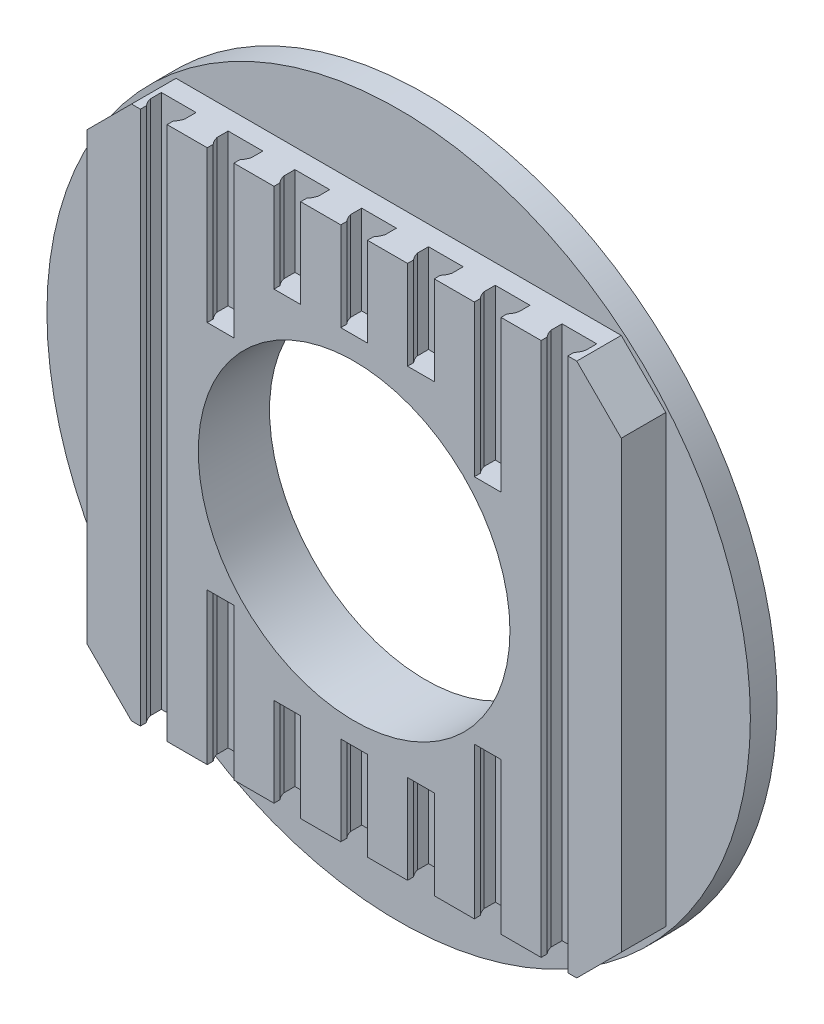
ISO-10303-21;
HEADER;
FILE_DESCRIPTION(('STEP AP214'),'2;1');
FILE_NAME('part.step','',(''),(''),'','','');
FILE_SCHEMA(('AUTOMOTIVE_DESIGN { 1 0 10303 214 1 1 1 1 }'));
ENDSEC;
DATA;
#1=APPLICATION_CONTEXT('core data for automotive mechanical design processes');
#2=APPLICATION_PROTOCOL_DEFINITION('international standard','automotive_design',2000,#1);
#3=PRODUCT_CONTEXT('',#1,'mechanical');
#4=PRODUCT('Part','Part','',(#3));
#5=PRODUCT_RELATED_PRODUCT_CATEGORY('part','',(#4));
#6=PRODUCT_DEFINITION_FORMATION('','',#4);
#7=PRODUCT_DEFINITION_CONTEXT('part definition',#1,'design');
#8=PRODUCT_DEFINITION('design','',#6,#7);
#9=PRODUCT_DEFINITION_SHAPE('','',#8);
#10=(LENGTH_UNIT() NAMED_UNIT(*) SI_UNIT(.MILLI.,.METRE.));
#11=(NAMED_UNIT(*) PLANE_ANGLE_UNIT() SI_UNIT($,.RADIAN.));
#12=(NAMED_UNIT(*) SI_UNIT($,.STERADIAN.) SOLID_ANGLE_UNIT());
#13=UNCERTAINTY_MEASURE_WITH_UNIT(LENGTH_MEASURE(1.E-05),#10,'distance_accuracy_value','');
#14=(GEOMETRIC_REPRESENTATION_CONTEXT(3) GLOBAL_UNCERTAINTY_ASSIGNED_CONTEXT((#13)) GLOBAL_UNIT_ASSIGNED_CONTEXT((#10,
#11,#12)) REPRESENTATION_CONTEXT('',''));
#15=CARTESIAN_POINT('',(0.,0.,0.));
#16=DIRECTION('',(0.,0.,1.));
#17=DIRECTION('',(1.,0.,0.));
#18=AXIS2_PLACEMENT_3D('',#15,#16,#17);
#19=CARTESIAN_POINT('',(-30.,-30.,5.));
#20=DIRECTION('',(0.,0.,1.));
#21=DIRECTION('',(1.,0.,0.));
#22=AXIS2_PLACEMENT_3D('',#19,#20,#21);
#23=PLANE('',#22);
#24=CARTESIAN_POINT('',(0.,0.,5.));
#25=DIRECTION('',(0.,0.,1.));
#26=DIRECTION('',(1.,0.,0.));
#27=AXIS2_PLACEMENT_3D('',#24,#25,#26);
#28=CIRCLE('',#27,17.5);
#29=CARTESIAN_POINT('',(17.5,0.,5.));
#30=VERTEX_POINT('',#29);
#31=EDGE_CURVE('E2019',#30,#30,#28,.T.);
#32=ORIENTED_EDGE('',*,*,#31,.F.);
#33=EDGE_LOOP('',(#32));
#34=FACE_BOUND('',#33,.T.);
#35=DIRECTION('',(0.,-1.,0.));
#36=VECTOR('',#35,1.);
#37=CARTESIAN_POINT('',(21.,45.001,5.));
#38=LINE('',#37,#36);
#39=CARTESIAN_POINT('',(21.,30.,5.));
#40=VERTEX_POINT('',#39);
#41=CARTESIAN_POINT('',(21.,-30.,5.));
#42=VERTEX_POINT('',#41);
#43=EDGE_CURVE('E1610',#40,#42,#38,.T.);
#44=ORIENTED_EDGE('',*,*,#43,.F.);
#45=DIRECTION('',(-1.,0.,0.));
#46=VECTOR('',#45,1.);
#47=CARTESIAN_POINT('',(-30.,30.,5.));
#48=LINE('',#47,#46);
#49=CARTESIAN_POINT('',(16.5,30.,5.));
#50=VERTEX_POINT('',#49);
#51=EDGE_CURVE('E752',#40,#50,#48,.T.);
#52=ORIENTED_EDGE('',*,*,#51,.T.);
#53=DIRECTION('',(0.,1.,0.));
#54=VECTOR('',#53,1.);
#55=CARTESIAN_POINT('',(16.5,13.,5.));
#56=LINE('',#55,#54);
#57=CARTESIAN_POINT('',(16.5,13.,5.));
#58=VERTEX_POINT('',#57);
#59=EDGE_CURVE('E1227',#58,#50,#56,.T.);
#60=ORIENTED_EDGE('',*,*,#59,.F.);
#61=DIRECTION('',(-1.,0.,0.));
#62=VECTOR('',#61,1.);
#63=CARTESIAN_POINT('',(13.5,13.,5.));
#64=LINE('',#63,#62);
#65=CARTESIAN_POINT('',(13.5,13.,5.));
#66=VERTEX_POINT('',#65);
#67=EDGE_CURVE('E1186',#58,#66,#64,.T.);
#68=ORIENTED_EDGE('',*,*,#67,.T.);
#69=DIRECTION('',(0.,1.,0.));
#70=VECTOR('',#69,1.);
#71=CARTESIAN_POINT('',(13.5,13.,5.));
#72=LINE('',#71,#70);
#73=CARTESIAN_POINT('',(13.5,30.,5.));
#74=VERTEX_POINT('',#73);
#75=EDGE_CURVE('E784',#66,#74,#72,.T.);
#76=ORIENTED_EDGE('',*,*,#75,.T.);
#77=CARTESIAN_POINT('',(9.,30.,5.));
#78=VERTEX_POINT('',#77);
#79=EDGE_CURVE('E754',#74,#78,#48,.T.);
#80=ORIENTED_EDGE('',*,*,#79,.T.);
#81=DIRECTION('',(0.,1.,0.));
#82=VECTOR('',#81,1.);
#83=CARTESIAN_POINT('',(9.,20.,5.));
#84=LINE('',#83,#82);
#85=CARTESIAN_POINT('',(9.,20.,5.));
#86=VERTEX_POINT('',#85);
#87=EDGE_CURVE('E781',#86,#78,#84,.T.);
#88=ORIENTED_EDGE('',*,*,#87,.F.);
#89=DIRECTION('',(-1.,0.,0.));
#90=VECTOR('',#89,1.);
#91=CARTESIAN_POINT('',(6.,20.,5.));
#92=LINE('',#91,#90);
#93=CARTESIAN_POINT('',(6.,20.,5.));
#94=VERTEX_POINT('',#93);
#95=EDGE_CURVE('E1478',#86,#94,#92,.T.);
#96=ORIENTED_EDGE('',*,*,#95,.T.);
#97=DIRECTION('',(0.,1.,0.));
#98=VECTOR('',#97,1.);
#99=CARTESIAN_POINT('',(6.,20.,5.));
#100=LINE('',#99,#98);
#101=CARTESIAN_POINT('',(6.,30.,5.));
#102=VERTEX_POINT('',#101);
#103=EDGE_CURVE('E797',#94,#102,#100,.T.);
#104=ORIENTED_EDGE('',*,*,#103,.T.);
#105=CARTESIAN_POINT('',(1.5,30.,5.));
#106=VERTEX_POINT('',#105);
#107=EDGE_CURVE('E758',#102,#106,#48,.T.);
#108=ORIENTED_EDGE('',*,*,#107,.T.);
#109=DIRECTION('',(0.,1.,0.));
#110=VECTOR('',#109,1.);
#111=CARTESIAN_POINT('',(1.5,20.,5.));
#112=LINE('',#111,#110);
#113=CARTESIAN_POINT('',(1.5,20.,5.));
#114=VERTEX_POINT('',#113);
#115=EDGE_CURVE('E874',#114,#106,#112,.T.);
#116=ORIENTED_EDGE('',*,*,#115,.F.);
#117=DIRECTION('',(-1.,0.,0.));
#118=VECTOR('',#117,1.);
#119=CARTESIAN_POINT('',(-1.5,20.,5.));
#120=LINE('',#119,#118);
#121=CARTESIAN_POINT('',(-1.5,20.,5.));
#122=VERTEX_POINT('',#121);
#123=EDGE_CURVE('E842',#114,#122,#120,.T.);
#124=ORIENTED_EDGE('',*,*,#123,.T.);
#125=DIRECTION('',(0.,1.,0.));
#126=VECTOR('',#125,1.);
#127=CARTESIAN_POINT('',(-1.5,20.,5.));
#128=LINE('',#127,#126);
#129=CARTESIAN_POINT('',(-1.5,30.,5.));
#130=VERTEX_POINT('',#129);
#131=EDGE_CURVE('E872',#122,#130,#128,.T.);
#132=ORIENTED_EDGE('',*,*,#131,.T.);
#133=CARTESIAN_POINT('',(-6.,30.,5.));
#134=VERTEX_POINT('',#133);
#135=EDGE_CURVE('E753',#130,#134,#48,.T.);
#136=ORIENTED_EDGE('',*,*,#135,.T.);
#137=DIRECTION('',(0.,1.,0.));
#138=VECTOR('',#137,1.);
#139=CARTESIAN_POINT('',(-6.,20.,5.));
#140=LINE('',#139,#138);
#141=CARTESIAN_POINT('',(-6.,20.,5.));
#142=VERTEX_POINT('',#141);
#143=EDGE_CURVE('E1457',#142,#134,#140,.T.);
#144=ORIENTED_EDGE('',*,*,#143,.F.);
#145=DIRECTION('',(-1.,0.,0.));
#146=VECTOR('',#145,1.);
#147=CARTESIAN_POINT('',(-9.,20.,5.));
#148=LINE('',#147,#146);
#149=CARTESIAN_POINT('',(-9.,20.,5.));
#150=VERTEX_POINT('',#149);
#151=EDGE_CURVE('E1425',#142,#150,#148,.T.);
#152=ORIENTED_EDGE('',*,*,#151,.T.);
#153=DIRECTION('',(0.,1.,0.));
#154=VECTOR('',#153,1.);
#155=CARTESIAN_POINT('',(-9.,20.,5.));
#156=LINE('',#155,#154);
#157=CARTESIAN_POINT('',(-9.,30.,5.));
#158=VERTEX_POINT('',#157);
#159=EDGE_CURVE('E1455',#150,#158,#156,.T.);
#160=ORIENTED_EDGE('',*,*,#159,.T.);
#161=CARTESIAN_POINT('',(-13.5,30.,5.));
#162=VERTEX_POINT('',#161);
#163=EDGE_CURVE('E759',#158,#162,#48,.T.);
#164=ORIENTED_EDGE('',*,*,#163,.T.);
#165=DIRECTION('',(0.,1.,0.));
#166=VECTOR('',#165,1.);
#167=CARTESIAN_POINT('',(-13.5,13.,5.));
#168=LINE('',#167,#166);
#169=CARTESIAN_POINT('',(-13.5,13.,5.));
#170=VERTEX_POINT('',#169);
#171=EDGE_CURVE('E1284',#170,#162,#168,.T.);
#172=ORIENTED_EDGE('',*,*,#171,.F.);
#173=DIRECTION('',(-1.,0.,0.));
#174=VECTOR('',#173,1.);
#175=CARTESIAN_POINT('',(-16.5,13.,5.));
#176=LINE('',#175,#174);
#177=CARTESIAN_POINT('',(-16.5,13.,5.));
#178=VERTEX_POINT('',#177);
#179=EDGE_CURVE('E1240',#170,#178,#176,.T.);
#180=ORIENTED_EDGE('',*,*,#179,.T.);
#181=DIRECTION('',(0.,1.,0.));
#182=VECTOR('',#181,1.);
#183=CARTESIAN_POINT('',(-16.5,13.,5.));
#184=LINE('',#183,#182);
#185=CARTESIAN_POINT('',(-16.5,30.,5.));
#186=VERTEX_POINT('',#185);
#187=EDGE_CURVE('E1282',#178,#186,#184,.T.);
#188=ORIENTED_EDGE('',*,*,#187,.T.);
#189=CARTESIAN_POINT('',(-21.,30.,5.));
#190=VERTEX_POINT('',#189);
#191=EDGE_CURVE('E765',#186,#190,#48,.T.);
#192=ORIENTED_EDGE('',*,*,#191,.T.);
#193=DIRECTION('',(0.,-1.,0.));
#194=VECTOR('',#193,1.);
#195=CARTESIAN_POINT('',(-21.,45.001,5.));
#196=LINE('',#195,#194);
#197=CARTESIAN_POINT('',(-21.,-30.,5.));
#198=VERTEX_POINT('',#197);
#199=EDGE_CURVE('E1173',#190,#198,#196,.T.);
#200=ORIENTED_EDGE('',*,*,#199,.T.);
#201=DIRECTION('',(1.,0.,0.));
#202=VECTOR('',#201,1.);
#203=CARTESIAN_POINT('',(-30.,-30.,5.));
#204=LINE('',#203,#202);
#205=CARTESIAN_POINT('',(-16.5,-30.,5.));
#206=VERTEX_POINT('',#205);
#207=EDGE_CURVE('E1070',#198,#206,#204,.T.);
#208=ORIENTED_EDGE('',*,*,#207,.T.);
#209=DIRECTION('',(0.,-1.,0.));
#210=VECTOR('',#209,1.);
#211=CARTESIAN_POINT('',(-16.5,-13.,5.));
#212=LINE('',#211,#210);
#213=CARTESIAN_POINT('',(-16.5,-13.,5.));
#214=VERTEX_POINT('',#213);
#215=EDGE_CURVE('E1405',#214,#206,#212,.T.);
#216=ORIENTED_EDGE('',*,*,#215,.F.);
#217=DIRECTION('',(-1.,0.,0.));
#218=VECTOR('',#217,1.);
#219=CARTESIAN_POINT('',(-16.5,-13.,5.));
#220=LINE('',#219,#218);
#221=CARTESIAN_POINT('',(-13.5,-13.,5.));
#222=VERTEX_POINT('',#221);
#223=EDGE_CURVE('E1358',#222,#214,#220,.T.);
#224=ORIENTED_EDGE('',*,*,#223,.F.);
#225=DIRECTION('',(0.,-1.,0.));
#226=VECTOR('',#225,1.);
#227=CARTESIAN_POINT('',(-13.5,-13.,5.));
#228=LINE('',#227,#226);
#229=CARTESIAN_POINT('',(-13.5,-30.,5.));
#230=VERTEX_POINT('',#229);
#231=EDGE_CURVE('E1408',#222,#230,#228,.T.);
#232=ORIENTED_EDGE('',*,*,#231,.T.);
#233=CARTESIAN_POINT('',(-9.,-30.,5.));
#234=VERTEX_POINT('',#233);
#235=EDGE_CURVE('E1567',#230,#234,#204,.T.);
#236=ORIENTED_EDGE('',*,*,#235,.T.);
#237=DIRECTION('',(0.,-1.,0.));
#238=VECTOR('',#237,1.);
#239=CARTESIAN_POINT('',(-9.,-20.,5.));
#240=LINE('',#239,#238);
#241=CARTESIAN_POINT('',(-9.,-20.,5.));
#242=VERTEX_POINT('',#241);
#243=EDGE_CURVE('E935',#242,#234,#240,.T.);
#244=ORIENTED_EDGE('',*,*,#243,.F.);
#245=DIRECTION('',(-1.,0.,0.));
#246=VECTOR('',#245,1.);
#247=CARTESIAN_POINT('',(-9.,-20.,5.));
#248=LINE('',#247,#246);
#249=CARTESIAN_POINT('',(-6.,-20.,5.));
#250=VERTEX_POINT('',#249);
#251=EDGE_CURVE('E902',#250,#242,#248,.T.);
#252=ORIENTED_EDGE('',*,*,#251,.F.);
#253=DIRECTION('',(0.,-1.,0.));
#254=VECTOR('',#253,1.);
#255=CARTESIAN_POINT('',(-6.,-20.,5.));
#256=LINE('',#255,#254);
#257=CARTESIAN_POINT('',(-6.,-30.,5.));
#258=VERTEX_POINT('',#257);
#259=EDGE_CURVE('E938',#250,#258,#256,.T.);
#260=ORIENTED_EDGE('',*,*,#259,.T.);
#261=CARTESIAN_POINT('',(-1.5,-30.,5.));
#262=VERTEX_POINT('',#261);
#263=EDGE_CURVE('E1569',#258,#262,#204,.T.);
#264=ORIENTED_EDGE('',*,*,#263,.T.);
#265=DIRECTION('',(0.,-1.,0.));
#266=VECTOR('',#265,1.);
#267=CARTESIAN_POINT('',(-1.5,-20.,5.));
#268=LINE('',#267,#266);
#269=CARTESIAN_POINT('',(-1.5,-20.,5.));
#270=VERTEX_POINT('',#269);
#271=EDGE_CURVE('E1054',#270,#262,#268,.T.);
#272=ORIENTED_EDGE('',*,*,#271,.F.);
#273=DIRECTION('',(-1.,0.,0.));
#274=VECTOR('',#273,1.);
#275=CARTESIAN_POINT('',(-1.5,-20.,5.));
#276=LINE('',#275,#274);
#277=CARTESIAN_POINT('',(1.5,-20.,5.));
#278=VERTEX_POINT('',#277);
#279=EDGE_CURVE('E1023',#278,#270,#276,.T.);
#280=ORIENTED_EDGE('',*,*,#279,.F.);
#281=DIRECTION('',(0.,-1.,0.));
#282=VECTOR('',#281,1.);
#283=CARTESIAN_POINT('',(1.5,-20.,5.));
#284=LINE('',#283,#282);
#285=CARTESIAN_POINT('',(1.5,-30.,5.));
#286=VERTEX_POINT('',#285);
#287=EDGE_CURVE('E1057',#278,#286,#284,.T.);
#288=ORIENTED_EDGE('',*,*,#287,.T.);
#289=CARTESIAN_POINT('',(6.,-30.,5.));
#290=VERTEX_POINT('',#289);
#291=EDGE_CURVE('E1071',#286,#290,#204,.T.);
#292=ORIENTED_EDGE('',*,*,#291,.T.);
#293=DIRECTION('',(0.,-1.,0.));
#294=VECTOR('',#293,1.);
#295=CARTESIAN_POINT('',(6.,-20.,5.));
#296=LINE('',#295,#294);
#297=CARTESIAN_POINT('',(6.,-20.,5.));
#298=VERTEX_POINT('',#297);
#299=EDGE_CURVE('E996',#298,#290,#296,.T.);
#300=ORIENTED_EDGE('',*,*,#299,.F.);
#301=DIRECTION('',(-1.,0.,0.));
#302=VECTOR('',#301,1.);
#303=CARTESIAN_POINT('',(6.,-20.,5.));
#304=LINE('',#303,#302);
#305=CARTESIAN_POINT('',(9.,-20.,5.));
#306=VERTEX_POINT('',#305);
#307=EDGE_CURVE('E963',#306,#298,#304,.T.);
#308=ORIENTED_EDGE('',*,*,#307,.F.);
#309=DIRECTION('',(0.,-1.,0.));
#310=VECTOR('',#309,1.);
#311=CARTESIAN_POINT('',(9.,-20.,5.));
#312=LINE('',#311,#310);
#313=CARTESIAN_POINT('',(9.,-30.,5.));
#314=VERTEX_POINT('',#313);
#315=EDGE_CURVE('E998',#306,#314,#312,.T.);
#316=ORIENTED_EDGE('',*,*,#315,.T.);
#317=CARTESIAN_POINT('',(13.5,-30.,5.));
#318=VERTEX_POINT('',#317);
#319=EDGE_CURVE('E1571',#314,#318,#204,.T.);
#320=ORIENTED_EDGE('',*,*,#319,.T.);
#321=DIRECTION('',(0.,-1.,0.));
#322=VECTOR('',#321,1.);
#323=CARTESIAN_POINT('',(13.5,-13.,5.));
#324=LINE('',#323,#322);
#325=CARTESIAN_POINT('',(13.5,-13.,5.));
#326=VERTEX_POINT('',#325);
#327=EDGE_CURVE('E1344',#326,#318,#324,.T.);
#328=ORIENTED_EDGE('',*,*,#327,.F.);
#329=DIRECTION('',(-1.,0.,0.));
#330=VECTOR('',#329,1.);
#331=CARTESIAN_POINT('',(13.5,-13.,5.));
#332=LINE('',#331,#330);
#333=CARTESIAN_POINT('',(16.5,-13.,5.));
#334=VERTEX_POINT('',#333);
#335=EDGE_CURVE('E1297',#334,#326,#332,.T.);
#336=ORIENTED_EDGE('',*,*,#335,.F.);
#337=DIRECTION('',(0.,-1.,0.));
#338=VECTOR('',#337,1.);
#339=CARTESIAN_POINT('',(16.5,-13.,5.));
#340=LINE('',#339,#338);
#341=CARTESIAN_POINT('',(16.5,-30.,5.));
#342=VERTEX_POINT('',#341);
#343=EDGE_CURVE('E1346',#334,#342,#340,.T.);
#344=ORIENTED_EDGE('',*,*,#343,.T.);
#345=EDGE_CURVE('E1568',#342,#42,#204,.T.);
#346=ORIENTED_EDGE('',*,*,#345,.T.);
#347=EDGE_LOOP('',(#44,#52,#60,#68,#76,#80,#88,#96,#104,#108,#116,#124,#132,#136,#144,#152,#160,
#164,#172,#180,#188,#192,#200,#208,#216,#224,#232,#236,#244,#252,#260,#264,#272,#280,#288,#292,
#300,#308,#316,#320,#328,#336,#344,#346));
#348=FACE_BOUND('',#347,.T.);
#349=ADVANCED_FACE('F39',(#34,#348),#23,.T.);
#350=CARTESIAN_POINT('',(-24.,30.,5.));
#351=VERTEX_POINT('',#350);
#352=CARTESIAN_POINT('',(-25.,30.,5.));
#353=VERTEX_POINT('',#352);
#354=EDGE_CURVE('E755',#351,#353,#48,.T.);
#355=ORIENTED_EDGE('',*,*,#354,.T.);
#356=DIRECTION('',(0.707106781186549,0.707106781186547,0.));
#357=VECTOR('',#356,1.);
#358=CARTESIAN_POINT('',(-57.5,-2.49999999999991,5.));
#359=LINE('',#358,#357);
#360=CARTESIAN_POINT('',(-30.,25.,5.));
#361=VERTEX_POINT('',#360);
#362=EDGE_CURVE('E718',#353,#361,#359,.F.);
#363=ORIENTED_EDGE('',*,*,#362,.T.);
#364=DIRECTION('',(0.,-1.,0.));
#365=VECTOR('',#364,1.);
#366=CARTESIAN_POINT('',(-30.,30.,5.));
#367=LINE('',#366,#365);
#368=CARTESIAN_POINT('',(-30.,-25.,5.));
#369=VERTEX_POINT('',#368);
#370=EDGE_CURVE('E709',#361,#369,#367,.T.);
#371=ORIENTED_EDGE('',*,*,#370,.T.);
#372=DIRECTION('',(-0.707106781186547,0.707106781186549,0.));
#373=VECTOR('',#372,1.);
#374=CARTESIAN_POINT('',(-27.5,-27.5,5.));
#375=LINE('',#374,#373);
#376=CARTESIAN_POINT('',(-25.,-30.,5.));
#377=VERTEX_POINT('',#376);
#378=EDGE_CURVE('E680',#369,#377,#375,.F.);
#379=ORIENTED_EDGE('',*,*,#378,.T.);
#380=CARTESIAN_POINT('',(-24.,-30.,5.));
#381=VERTEX_POINT('',#380);
#382=EDGE_CURVE('E1069',#377,#381,#204,.T.);
#383=ORIENTED_EDGE('',*,*,#382,.T.);
#384=DIRECTION('',(0.,-1.,0.));
#385=VECTOR('',#384,1.);
#386=CARTESIAN_POINT('',(-24.,45.001,5.));
#387=LINE('',#386,#385);
#388=EDGE_CURVE('E1128',#351,#381,#387,.T.);
#389=ORIENTED_EDGE('',*,*,#388,.F.);
#390=EDGE_LOOP('',(#355,#363,#371,#379,#383,#389));
#391=FACE_BOUND('',#390,.T.);
#392=ADVANCED_FACE('F1090',(#391),#23,.T.);
#393=CARTESIAN_POINT('',(-30.,30.,5.));
#394=DIRECTION('',(0.,-1.,0.));
#395=DIRECTION('',(0.,0.,-1.));
#396=AXIS2_PLACEMENT_3D('',#393,#394,#395);
#397=PLANE('',#396);
#398=DIRECTION('',(-1.,0.,0.));
#399=VECTOR('',#398,1.);
#400=CARTESIAN_POINT('',(-30.,30.,0.));
#401=LINE('',#400,#399);
#402=CARTESIAN_POINT('',(25.,30.,0.));
#403=VERTEX_POINT('',#402);
#404=CARTESIAN_POINT('',(-25.,30.,0.));
#405=VERTEX_POINT('',#404);
#406=EDGE_CURVE('E705',#403,#405,#401,.T.);
#407=ORIENTED_EDGE('',*,*,#406,.T.);
#408=DIRECTION('',(0.,0.,1.));
#409=VECTOR('',#408,1.);
#410=CARTESIAN_POINT('',(-25.,30.,5.));
#411=LINE('',#410,#409);
#412=EDGE_CURVE('E715',#405,#353,#411,.T.);
#413=ORIENTED_EDGE('',*,*,#412,.T.);
#414=ORIENTED_EDGE('',*,*,#354,.F.);
#415=DIRECTION('',(0.,0.,1.));
#416=VECTOR('',#415,1.);
#417=CARTESIAN_POINT('',(-24.,30.,5.));
#418=LINE('',#417,#416);
#419=CARTESIAN_POINT('',(-24.,30.,4.32287565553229));
#420=VERTEX_POINT('',#419);
#421=EDGE_CURVE('E1131',#420,#351,#418,.T.);
#422=ORIENTED_EDGE('',*,*,#421,.F.);
#423=CARTESIAN_POINT('',(-22.5,30.,3.));
#424=DIRECTION('',(0.,-1.,0.));
#425=DIRECTION('',(0.,0.,-1.));
#426=AXIS2_PLACEMENT_3D('',#423,#424,#425);
#427=CIRCLE('',#426,2.);
#428=CARTESIAN_POINT('',(-24.45,30.,3.44440972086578));
#429=VERTEX_POINT('',#428);
#430=EDGE_CURVE('E1134',#429,#420,#427,.F.);
#431=ORIENTED_EDGE('',*,*,#430,.F.);
#432=DIRECTION('',(0.,0.,1.));
#433=VECTOR('',#432,1.);
#434=CARTESIAN_POINT('',(-24.45,30.,2.2));
#435=LINE('',#434,#433);
#436=CARTESIAN_POINT('',(-24.45,30.,2.2));
#437=VERTEX_POINT('',#436);
#438=EDGE_CURVE('E1140',#437,#429,#435,.T.);
#439=ORIENTED_EDGE('',*,*,#438,.F.);
#440=DIRECTION('',(-1.,0.,0.));
#441=VECTOR('',#440,1.);
#442=CARTESIAN_POINT('',(-24.45,30.,2.2));
#443=LINE('',#442,#441);
#444=CARTESIAN_POINT('',(-20.55,30.,2.2));
#445=VERTEX_POINT('',#444);
#446=EDGE_CURVE('E1619',#445,#437,#443,.T.);
#447=ORIENTED_EDGE('',*,*,#446,.F.);
#448=DIRECTION('',(0.,0.,-1.));
#449=VECTOR('',#448,1.);
#450=CARTESIAN_POINT('',(-20.55,30.,2.2));
#451=LINE('',#450,#449);
#452=CARTESIAN_POINT('',(-20.55,30.,3.44440972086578));
#453=VERTEX_POINT('',#452);
#454=EDGE_CURVE('E1616',#453,#445,#451,.T.);
#455=ORIENTED_EDGE('',*,*,#454,.F.);
#456=CARTESIAN_POINT('',(-22.5,30.,3.));
#457=DIRECTION('',(0.,-1.,0.));
#458=DIRECTION('',(0.,0.,-1.));
#459=AXIS2_PLACEMENT_3D('',#456,#457,#458);
#460=CIRCLE('',#459,2.);
#461=CARTESIAN_POINT('',(-21.,30.,4.3228756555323));
#462=VERTEX_POINT('',#461);
#463=EDGE_CURVE('E1558',#462,#453,#460,.F.);
#464=ORIENTED_EDGE('',*,*,#463,.F.);
#465=DIRECTION('',(0.,0.,-1.));
#466=VECTOR('',#465,1.);
#467=CARTESIAN_POINT('',(-21.,30.,5.));
#468=LINE('',#467,#466);
#469=EDGE_CURVE('E1163',#190,#462,#468,.T.);
#470=ORIENTED_EDGE('',*,*,#469,.F.);
#471=ORIENTED_EDGE('',*,*,#191,.F.);
#472=DIRECTION('',(0.,0.,-1.));
#473=VECTOR('',#472,1.);
#474=CARTESIAN_POINT('',(-16.5,30.,5.));
#475=LINE('',#474,#473);
#476=CARTESIAN_POINT('',(-16.5,30.,4.32287565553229));
#477=VERTEX_POINT('',#476);
#478=EDGE_CURVE('E1259',#186,#477,#475,.T.);
#479=ORIENTED_EDGE('',*,*,#478,.T.);
#480=CARTESIAN_POINT('',(-15.,30.,3.));
#481=DIRECTION('',(0.,-1.,0.));
#482=DIRECTION('',(0.,0.,-1.));
#483=AXIS2_PLACEMENT_3D('',#480,#481,#482);
#484=CIRCLE('',#483,2.);
#485=CARTESIAN_POINT('',(-16.95,30.,3.44440972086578));
#486=VERTEX_POINT('',#485);
#487=EDGE_CURVE('E1262',#477,#486,#484,.T.);
#488=ORIENTED_EDGE('',*,*,#487,.T.);
#489=DIRECTION('',(0.,0.,-1.));
#490=VECTOR('',#489,1.);
#491=CARTESIAN_POINT('',(-16.95,30.,2.2));
#492=LINE('',#491,#490);
#493=CARTESIAN_POINT('',(-16.95,30.,2.2));
#494=VERTEX_POINT('',#493);
#495=EDGE_CURVE('E1265',#486,#494,#492,.T.);
#496=ORIENTED_EDGE('',*,*,#495,.T.);
#497=DIRECTION('',(1.,0.,0.));
#498=VECTOR('',#497,1.);
#499=CARTESIAN_POINT('',(-16.95,30.,2.2));
#500=LINE('',#499,#498);
#501=CARTESIAN_POINT('',(-13.05,30.,2.2));
#502=VERTEX_POINT('',#501);
#503=EDGE_CURVE('E1268',#494,#502,#500,.T.);
#504=ORIENTED_EDGE('',*,*,#503,.T.);
#505=DIRECTION('',(0.,0.,1.));
#506=VECTOR('',#505,1.);
#507=CARTESIAN_POINT('',(-13.05,30.,2.2));
#508=LINE('',#507,#506);
#509=CARTESIAN_POINT('',(-13.05,30.,3.44440972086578));
#510=VERTEX_POINT('',#509);
#511=EDGE_CURVE('E1238',#502,#510,#508,.T.);
#512=ORIENTED_EDGE('',*,*,#511,.T.);
#513=CARTESIAN_POINT('',(-15.,30.,3.));
#514=DIRECTION('',(0.,-1.,0.));
#515=DIRECTION('',(0.,0.,-1.));
#516=AXIS2_PLACEMENT_3D('',#513,#514,#515);
#517=CIRCLE('',#516,2.);
#518=CARTESIAN_POINT('',(-13.5,30.,4.3228756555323));
#519=VERTEX_POINT('',#518);
#520=EDGE_CURVE('E1233',#510,#519,#517,.T.);
#521=ORIENTED_EDGE('',*,*,#520,.T.);
#522=DIRECTION('',(0.,0.,1.));
#523=VECTOR('',#522,1.);
#524=CARTESIAN_POINT('',(-13.5,30.,5.));
#525=LINE('',#524,#523);
#526=EDGE_CURVE('E1256',#519,#162,#525,.T.);
#527=ORIENTED_EDGE('',*,*,#526,.T.);
#528=ORIENTED_EDGE('',*,*,#163,.F.);
#529=DIRECTION('',(0.,0.,-1.));
#530=VECTOR('',#529,1.);
#531=CARTESIAN_POINT('',(-9.,30.,5.));
#532=LINE('',#531,#530);
#533=CARTESIAN_POINT('',(-9.,30.,4.32287565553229));
#534=VERTEX_POINT('',#533);
#535=EDGE_CURVE('E1447',#158,#534,#532,.T.);
#536=ORIENTED_EDGE('',*,*,#535,.T.);
#537=CARTESIAN_POINT('',(-7.5,30.,3.));
#538=DIRECTION('',(0.,-1.,0.));
#539=DIRECTION('',(0.,0.,-1.));
#540=AXIS2_PLACEMENT_3D('',#537,#538,#539);
#541=CIRCLE('',#540,2.);
#542=CARTESIAN_POINT('',(-9.45,30.,3.44440972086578));
#543=VERTEX_POINT('',#542);
#544=EDGE_CURVE('E1417',#534,#543,#541,.T.);
#545=ORIENTED_EDGE('',*,*,#544,.T.);
#546=DIRECTION('',(0.,0.,-1.));
#547=VECTOR('',#546,1.);
#548=CARTESIAN_POINT('',(-9.45,30.,2.2));
#549=LINE('',#548,#547);
#550=CARTESIAN_POINT('',(-9.45,30.,2.2));
#551=VERTEX_POINT('',#550);
#552=EDGE_CURVE('E1396',#543,#551,#549,.T.);
#553=ORIENTED_EDGE('',*,*,#552,.T.);
#554=DIRECTION('',(1.,0.,0.));
#555=VECTOR('',#554,1.);
#556=CARTESIAN_POINT('',(-9.45,30.,2.2));
#557=LINE('',#556,#555);
#558=CARTESIAN_POINT('',(-5.55,30.,2.2));
#559=VERTEX_POINT('',#558);
#560=EDGE_CURVE('E1435',#551,#559,#557,.T.);
#561=ORIENTED_EDGE('',*,*,#560,.T.);
#562=DIRECTION('',(0.,0.,1.));
#563=VECTOR('',#562,1.);
#564=CARTESIAN_POINT('',(-5.55,30.,2.2));
#565=LINE('',#564,#563);
#566=CARTESIAN_POINT('',(-5.55,30.,3.44440972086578));
#567=VERTEX_POINT('',#566);
#568=EDGE_CURVE('E1438',#559,#567,#565,.T.);
#569=ORIENTED_EDGE('',*,*,#568,.T.);
#570=CARTESIAN_POINT('',(-7.5,30.,3.));
#571=DIRECTION('',(0.,-1.,0.));
#572=DIRECTION('',(0.,0.,-1.));
#573=AXIS2_PLACEMENT_3D('',#570,#571,#572);
#574=CIRCLE('',#573,2.);
#575=CARTESIAN_POINT('',(-6.,30.,4.3228756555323));
#576=VERTEX_POINT('',#575);
#577=EDGE_CURVE('E1441',#567,#576,#574,.T.);
#578=ORIENTED_EDGE('',*,*,#577,.T.);
#579=DIRECTION('',(0.,0.,1.));
#580=VECTOR('',#579,1.);
#581=CARTESIAN_POINT('',(-6.,30.,5.));
#582=LINE('',#581,#580);
#583=EDGE_CURVE('E1444',#576,#134,#582,.T.);
#584=ORIENTED_EDGE('',*,*,#583,.T.);
#585=ORIENTED_EDGE('',*,*,#135,.F.);
#586=DIRECTION('',(0.,0.,-1.));
#587=VECTOR('',#586,1.);
#588=CARTESIAN_POINT('',(-1.5,30.,5.));
#589=LINE('',#588,#587);
#590=CARTESIAN_POINT('',(-1.5,30.,4.32287565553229));
#591=VERTEX_POINT('',#590);
#592=EDGE_CURVE('E864',#130,#591,#589,.T.);
#593=ORIENTED_EDGE('',*,*,#592,.T.);
#594=CARTESIAN_POINT('',(0.,30.,3.));
#595=DIRECTION('',(0.,-1.,0.));
#596=DIRECTION('',(0.,0.,-1.));
#597=AXIS2_PLACEMENT_3D('',#594,#595,#596);
#598=CIRCLE('',#597,2.);
#599=CARTESIAN_POINT('',(-1.95,30.,3.44440972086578));
#600=VERTEX_POINT('',#599);
#601=EDGE_CURVE('E834',#591,#600,#598,.T.);
#602=ORIENTED_EDGE('',*,*,#601,.T.);
#603=DIRECTION('',(0.,0.,-1.));
#604=VECTOR('',#603,1.);
#605=CARTESIAN_POINT('',(-1.95,30.,2.2));
#606=LINE('',#605,#604);
#607=CARTESIAN_POINT('',(-1.95,30.,2.2));
#608=VERTEX_POINT('',#607);
#609=EDGE_CURVE('E829',#600,#608,#606,.T.);
#610=ORIENTED_EDGE('',*,*,#609,.T.);
#611=DIRECTION('',(1.,0.,0.));
#612=VECTOR('',#611,1.);
#613=CARTESIAN_POINT('',(-1.95,30.,2.2));
#614=LINE('',#613,#612);
#615=CARTESIAN_POINT('',(1.95,30.,2.2));
#616=VERTEX_POINT('',#615);
#617=EDGE_CURVE('E852',#608,#616,#614,.T.);
#618=ORIENTED_EDGE('',*,*,#617,.T.);
#619=DIRECTION('',(0.,0.,1.));
#620=VECTOR('',#619,1.);
#621=CARTESIAN_POINT('',(1.95,30.,2.2));
#622=LINE('',#621,#620);
#623=CARTESIAN_POINT('',(1.95,30.,3.44440972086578));
#624=VERTEX_POINT('',#623);
#625=EDGE_CURVE('E855',#616,#624,#622,.T.);
#626=ORIENTED_EDGE('',*,*,#625,.T.);
#627=CARTESIAN_POINT('',(0.,30.,3.));
#628=DIRECTION('',(0.,-1.,0.));
#629=DIRECTION('',(0.,0.,-1.));
#630=AXIS2_PLACEMENT_3D('',#627,#628,#629);
#631=CIRCLE('',#630,2.);
#632=CARTESIAN_POINT('',(1.5,30.,4.3228756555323));
#633=VERTEX_POINT('',#632);
#634=EDGE_CURVE('E858',#624,#633,#631,.T.);
#635=ORIENTED_EDGE('',*,*,#634,.T.);
#636=DIRECTION('',(0.,0.,1.));
#637=VECTOR('',#636,1.);
#638=CARTESIAN_POINT('',(1.5,30.,5.));
#639=LINE('',#638,#637);
#640=EDGE_CURVE('E861',#633,#106,#639,.T.);
#641=ORIENTED_EDGE('',*,*,#640,.T.);
#642=ORIENTED_EDGE('',*,*,#107,.F.);
#643=DIRECTION('',(0.,0.,-1.));
#644=VECTOR('',#643,1.);
#645=CARTESIAN_POINT('',(6.,30.,5.));
#646=LINE('',#645,#644);
#647=CARTESIAN_POINT('',(6.,30.,4.32287565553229));
#648=VERTEX_POINT('',#647);
#649=EDGE_CURVE('E802',#102,#648,#646,.T.);
#650=ORIENTED_EDGE('',*,*,#649,.T.);
#651=CARTESIAN_POINT('',(7.5,30.,3.));
#652=DIRECTION('',(0.,-1.,0.));
#653=DIRECTION('',(0.,0.,-1.));
#654=AXIS2_PLACEMENT_3D('',#651,#652,#653);
#655=CIRCLE('',#654,2.);
#656=CARTESIAN_POINT('',(5.55,30.,3.44440972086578));
#657=VERTEX_POINT('',#656);
#658=EDGE_CURVE('E805',#648,#657,#655,.T.);
#659=ORIENTED_EDGE('',*,*,#658,.T.);
#660=DIRECTION('',(0.,0.,-1.));
#661=VECTOR('',#660,1.);
#662=CARTESIAN_POINT('',(5.55,30.,2.2));
#663=LINE('',#662,#661);
#664=CARTESIAN_POINT('',(5.55,30.,2.2));
#665=VERTEX_POINT('',#664);
#666=EDGE_CURVE('E1468',#657,#665,#663,.T.);
#667=ORIENTED_EDGE('',*,*,#666,.T.);
#668=DIRECTION('',(1.,0.,0.));
#669=VECTOR('',#668,1.);
#670=CARTESIAN_POINT('',(5.55,30.,2.2));
#671=LINE('',#670,#669);
#672=CARTESIAN_POINT('',(9.45,30.,2.2));
#673=VERTEX_POINT('',#672);
#674=EDGE_CURVE('E1485',#665,#673,#671,.T.);
#675=ORIENTED_EDGE('',*,*,#674,.T.);
#676=DIRECTION('',(0.,0.,1.));
#677=VECTOR('',#676,1.);
#678=CARTESIAN_POINT('',(9.45,30.,2.2));
#679=LINE('',#678,#677);
#680=CARTESIAN_POINT('',(9.45,30.,3.44440972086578));
#681=VERTEX_POINT('',#680);
#682=EDGE_CURVE('E807',#673,#681,#679,.T.);
#683=ORIENTED_EDGE('',*,*,#682,.T.);
#684=CARTESIAN_POINT('',(7.5,30.,3.));
#685=DIRECTION('',(0.,-1.,0.));
#686=DIRECTION('',(0.,0.,-1.));
#687=AXIS2_PLACEMENT_3D('',#684,#685,#686);
#688=CIRCLE('',#687,2.);
#689=CARTESIAN_POINT('',(9.,30.,4.3228756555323));
#690=VERTEX_POINT('',#689);
#691=EDGE_CURVE('E801',#681,#690,#688,.T.);
#692=ORIENTED_EDGE('',*,*,#691,.T.);
#693=DIRECTION('',(0.,0.,1.));
#694=VECTOR('',#693,1.);
#695=CARTESIAN_POINT('',(9.,30.,5.));
#696=LINE('',#695,#694);
#697=EDGE_CURVE('E791',#690,#78,#696,.T.);
#698=ORIENTED_EDGE('',*,*,#697,.T.);
#699=ORIENTED_EDGE('',*,*,#79,.F.);
#700=DIRECTION('',(0.,0.,-1.));
#701=VECTOR('',#700,1.);
#702=CARTESIAN_POINT('',(13.5,30.,5.));
#703=LINE('',#702,#701);
#704=CARTESIAN_POINT('',(13.5,30.,4.32287565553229));
#705=VERTEX_POINT('',#704);
#706=EDGE_CURVE('E1204',#74,#705,#703,.T.);
#707=ORIENTED_EDGE('',*,*,#706,.T.);
#708=CARTESIAN_POINT('',(15.,30.,3.));
#709=DIRECTION('',(0.,-1.,0.));
#710=DIRECTION('',(0.,0.,-1.));
#711=AXIS2_PLACEMENT_3D('',#708,#709,#710);
#712=CIRCLE('',#711,2.);
#713=CARTESIAN_POINT('',(13.05,30.,3.44440972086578));
#714=VERTEX_POINT('',#713);
#715=EDGE_CURVE('E1206',#705,#714,#712,.T.);
#716=ORIENTED_EDGE('',*,*,#715,.T.);
#717=DIRECTION('',(0.,0.,-1.));
#718=VECTOR('',#717,1.);
#719=CARTESIAN_POINT('',(13.05,30.,2.2));
#720=LINE('',#719,#718);
#721=CARTESIAN_POINT('',(13.05,30.,2.2));
#722=VERTEX_POINT('',#721);
#723=EDGE_CURVE('E1209',#714,#722,#720,.T.);
#724=ORIENTED_EDGE('',*,*,#723,.T.);
#725=DIRECTION('',(1.,0.,0.));
#726=VECTOR('',#725,1.);
#727=CARTESIAN_POINT('',(13.05,30.,2.2));
#728=LINE('',#727,#726);
#729=CARTESIAN_POINT('',(16.95,30.,2.2));
#730=VERTEX_POINT('',#729);
#731=EDGE_CURVE('E1212',#722,#730,#728,.T.);
#732=ORIENTED_EDGE('',*,*,#731,.T.);
#733=DIRECTION('',(0.,0.,1.));
#734=VECTOR('',#733,1.);
#735=CARTESIAN_POINT('',(16.95,30.,2.2));
#736=LINE('',#735,#734);
#737=CARTESIAN_POINT('',(16.95,30.,3.44440972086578));
#738=VERTEX_POINT('',#737);
#739=EDGE_CURVE('E1184',#730,#738,#736,.T.);
#740=ORIENTED_EDGE('',*,*,#739,.T.);
#741=CARTESIAN_POINT('',(15.,30.,3.));
#742=DIRECTION('',(0.,-1.,0.));
#743=DIRECTION('',(0.,0.,-1.));
#744=AXIS2_PLACEMENT_3D('',#741,#742,#743);
#745=CIRCLE('',#744,2.);
#746=CARTESIAN_POINT('',(16.5,30.,4.3228756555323));
#747=VERTEX_POINT('',#746);
#748=EDGE_CURVE('E1179',#738,#747,#745,.T.);
#749=ORIENTED_EDGE('',*,*,#748,.T.);
#750=DIRECTION('',(0.,0.,1.));
#751=VECTOR('',#750,1.);
#752=CARTESIAN_POINT('',(16.5,30.,5.));
#753=LINE('',#752,#751);
#754=EDGE_CURVE('E1201',#747,#50,#753,.T.);
#755=ORIENTED_EDGE('',*,*,#754,.T.);
#756=ORIENTED_EDGE('',*,*,#51,.F.);
#757=DIRECTION('',(0.,0.,1.));
#758=VECTOR('',#757,1.);
#759=CARTESIAN_POINT('',(21.,30.,5.));
#760=LINE('',#759,#758);
#761=CARTESIAN_POINT('',(21.,30.,4.32287565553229));
#762=VERTEX_POINT('',#761);
#763=EDGE_CURVE('E1584',#762,#40,#760,.T.);
#764=ORIENTED_EDGE('',*,*,#763,.F.);
#765=CARTESIAN_POINT('',(22.5,30.,3.));
#766=DIRECTION('',(0.,-1.,0.));
#767=DIRECTION('',(0.,0.,-1.));
#768=AXIS2_PLACEMENT_3D('',#765,#766,#767);
#769=CIRCLE('',#768,2.);
#770=CARTESIAN_POINT('',(20.55,30.,3.44440972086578));
#771=VERTEX_POINT('',#770);
#772=EDGE_CURVE('E2004',#771,#762,#769,.F.);
#773=ORIENTED_EDGE('',*,*,#772,.F.);
#774=DIRECTION('',(0.,0.,1.));
#775=VECTOR('',#774,1.);
#776=CARTESIAN_POINT('',(20.55,30.,2.2));
#777=LINE('',#776,#775);
#778=CARTESIAN_POINT('',(20.55,30.,2.2));
#779=VERTEX_POINT('',#778);
#780=EDGE_CURVE('E2005',#779,#771,#777,.T.);
#781=ORIENTED_EDGE('',*,*,#780,.F.);
#782=DIRECTION('',(-1.,0.,0.));
#783=VECTOR('',#782,1.);
#784=CARTESIAN_POINT('',(20.55,30.,2.2));
#785=LINE('',#784,#783);
#786=CARTESIAN_POINT('',(24.45,30.,2.2));
#787=VERTEX_POINT('',#786);
#788=EDGE_CURVE('E2010',#787,#779,#785,.T.);
#789=ORIENTED_EDGE('',*,*,#788,.F.);
#790=DIRECTION('',(0.,0.,-1.));
#791=VECTOR('',#790,1.);
#792=CARTESIAN_POINT('',(24.45,30.,2.2));
#793=LINE('',#792,#791);
#794=CARTESIAN_POINT('',(24.45,30.,3.44440972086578));
#795=VERTEX_POINT('',#794);
#796=EDGE_CURVE('E2013',#795,#787,#793,.T.);
#797=ORIENTED_EDGE('',*,*,#796,.F.);
#798=CARTESIAN_POINT('',(22.5,30.,3.));
#799=DIRECTION('',(0.,-1.,0.));
#800=DIRECTION('',(0.,0.,-1.));
#801=AXIS2_PLACEMENT_3D('',#798,#799,#800);
#802=CIRCLE('',#801,2.);
#803=CARTESIAN_POINT('',(24.,30.,4.3228756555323));
#804=VERTEX_POINT('',#803);
#805=EDGE_CURVE('E2016',#804,#795,#802,.F.);
#806=ORIENTED_EDGE('',*,*,#805,.F.);
#807=DIRECTION('',(0.,0.,-1.));
#808=VECTOR('',#807,1.);
#809=CARTESIAN_POINT('',(24.,30.,5.));
#810=LINE('',#809,#808);
#811=CARTESIAN_POINT('',(24.,30.,5.));
#812=VERTEX_POINT('',#811);
#813=EDGE_CURVE('E748',#812,#804,#810,.T.);
#814=ORIENTED_EDGE('',*,*,#813,.F.);
#815=CARTESIAN_POINT('',(25.,30.,5.));
#816=VERTEX_POINT('',#815);
#817=EDGE_CURVE('E685',#816,#812,#48,.T.);
#818=ORIENTED_EDGE('',*,*,#817,.F.);
#819=DIRECTION('',(0.,0.,-1.));
#820=VECTOR('',#819,1.);
#821=CARTESIAN_POINT('',(25.,30.,5.));
#822=LINE('',#821,#820);
#823=EDGE_CURVE('E712',#816,#403,#822,.T.);
#824=ORIENTED_EDGE('',*,*,#823,.T.);
#825=EDGE_LOOP('',(#407,#413,#414,#422,#431,#439,#447,#455,#464,#470,#471,#479,#488,#496,#504,
#512,#521,#527,#528,#536,#545,#553,#561,#569,#578,#584,#585,#593,#602,#610,#618,#626,#635,#641,
#642,#650,#659,#667,#675,#683,#692,#698,#699,#707,#716,#724,#732,#740,#749,#755,#756,#764,#773,
#781,#789,#797,#806,#814,#818,#824));
#826=FACE_BOUND('',#825,.T.);
#827=ADVANCED_FACE('F743',(#826),#397,.F.);
#828=DIRECTION('',(0.,1.,0.));
#829=VECTOR('',#828,1.);
#830=CARTESIAN_POINT('',(30.,30.,5.));
#831=LINE('',#830,#829);
#832=CARTESIAN_POINT('',(30.,-25.,5.));
#833=VERTEX_POINT('',#832);
#834=CARTESIAN_POINT('',(30.,25.,5.));
#835=VERTEX_POINT('',#834);
#836=EDGE_CURVE('E774',#833,#835,#831,.T.);
#837=ORIENTED_EDGE('',*,*,#836,.T.);
#838=DIRECTION('',(0.707106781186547,-0.707106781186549,0.));
#839=VECTOR('',#838,1.);
#840=CARTESIAN_POINT('',(27.5000000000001,27.4999999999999,5.));
#841=LINE('',#840,#839);
#842=EDGE_CURVE('E727',#835,#816,#841,.F.);
#843=ORIENTED_EDGE('',*,*,#842,.T.);
#844=ORIENTED_EDGE('',*,*,#817,.T.);
#845=DIRECTION('',(0.,-1.,0.));
#846=VECTOR('',#845,1.);
#847=CARTESIAN_POINT('',(24.,45.001,5.));
#848=LINE('',#847,#846);
#849=CARTESIAN_POINT('',(24.,-30.,5.));
#850=VERTEX_POINT('',#849);
#851=EDGE_CURVE('E1572',#812,#850,#848,.T.);
#852=ORIENTED_EDGE('',*,*,#851,.T.);
#853=CARTESIAN_POINT('',(25.,-30.,5.));
#854=VERTEX_POINT('',#853);
#855=EDGE_CURVE('E1068',#850,#854,#204,.T.);
#856=ORIENTED_EDGE('',*,*,#855,.T.);
#857=DIRECTION('',(-0.707106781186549,-0.707106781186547,0.));
#858=VECTOR('',#857,1.);
#859=CARTESIAN_POINT('',(-2.50000000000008,-57.5,5.));
#860=LINE('',#859,#858);
#861=EDGE_CURVE('E725',#854,#833,#860,.F.);
#862=ORIENTED_EDGE('',*,*,#861,.T.);
#863=EDGE_LOOP('',(#837,#843,#844,#852,#856,#862));
#864=FACE_BOUND('',#863,.T.);
#865=ADVANCED_FACE('F1074',(#864),#23,.T.);
#866=CARTESIAN_POINT('',(-30.,30.,5.));
#867=DIRECTION('',(1.,0.,0.));
#868=DIRECTION('',(0.,1.,0.));
#869=AXIS2_PLACEMENT_3D('',#866,#867,#868);
#870=PLANE('',#869);
#871=ORIENTED_EDGE('',*,*,#370,.F.);
#872=DIRECTION('',(0.,0.,-1.));
#873=VECTOR('',#872,1.);
#874=CARTESIAN_POINT('',(-30.,25.,5.));
#875=LINE('',#874,#873);
#876=CARTESIAN_POINT('',(-30.,25.,0.));
#877=VERTEX_POINT('',#876);
#878=EDGE_CURVE('E684',#361,#877,#875,.T.);
#879=ORIENTED_EDGE('',*,*,#878,.T.);
#880=DIRECTION('',(0.,-1.,0.));
#881=VECTOR('',#880,1.);
#882=CARTESIAN_POINT('',(-30.,30.,0.));
#883=LINE('',#882,#881);
#884=CARTESIAN_POINT('',(-30.,-25.,0.));
#885=VERTEX_POINT('',#884);
#886=EDGE_CURVE('E689',#877,#885,#883,.T.);
#887=ORIENTED_EDGE('',*,*,#886,.T.);
#888=DIRECTION('',(0.,0.,1.));
#889=VECTOR('',#888,1.);
#890=CARTESIAN_POINT('',(-30.,-25.,5.));
#891=LINE('',#890,#889);
#892=EDGE_CURVE('E678',#885,#369,#891,.T.);
#893=ORIENTED_EDGE('',*,*,#892,.T.);
#894=EDGE_LOOP('',(#871,#879,#887,#893));
#895=FACE_BOUND('',#894,.T.);
#896=ADVANCED_FACE('F690',(#895),#870,.F.);
#897=CARTESIAN_POINT('',(-30.,-30.,5.));
#898=DIRECTION('',(0.,1.,0.));
#899=DIRECTION('',(0.,0.,1.));
#900=AXIS2_PLACEMENT_3D('',#897,#898,#899);
#901=PLANE('',#900);
#902=DIRECTION('',(1.,0.,0.));
#903=VECTOR('',#902,1.);
#904=CARTESIAN_POINT('',(-30.,-30.,0.));
#905=LINE('',#904,#903);
#906=CARTESIAN_POINT('',(-25.,-30.,0.));
#907=VERTEX_POINT('',#906);
#908=CARTESIAN_POINT('',(25.,-30.,0.));
#909=VERTEX_POINT('',#908);
#910=EDGE_CURVE('E694',#907,#909,#905,.T.);
#911=ORIENTED_EDGE('',*,*,#910,.T.);
#912=DIRECTION('',(0.,0.,1.));
#913=VECTOR('',#912,1.);
#914=CARTESIAN_POINT('',(25.,-30.,5.));
#915=LINE('',#914,#913);
#916=EDGE_CURVE('E60',#909,#854,#915,.T.);
#917=ORIENTED_EDGE('',*,*,#916,.T.);
#918=ORIENTED_EDGE('',*,*,#855,.F.);
#919=DIRECTION('',(0.,0.,1.));
#920=VECTOR('',#919,1.);
#921=CARTESIAN_POINT('',(24.,-30.,5.));
#922=LINE('',#921,#920);
#923=CARTESIAN_POINT('',(24.,-30.,4.3228756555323));
#924=VERTEX_POINT('',#923);
#925=EDGE_CURVE('E1575',#924,#850,#922,.T.);
#926=ORIENTED_EDGE('',*,*,#925,.F.);
#927=CARTESIAN_POINT('',(22.5,-30.,3.));
#928=DIRECTION('',(0.,-1.,0.));
#929=DIRECTION('',(0.,0.,-1.));
#930=AXIS2_PLACEMENT_3D('',#927,#928,#929);
#931=CIRCLE('',#930,2.);
#932=CARTESIAN_POINT('',(24.45,-30.,3.44440972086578));
#933=VERTEX_POINT('',#932);
#934=EDGE_CURVE('E1577',#933,#924,#931,.T.);
#935=ORIENTED_EDGE('',*,*,#934,.F.);
#936=DIRECTION('',(0.,0.,1.));
#937=VECTOR('',#936,1.);
#938=CARTESIAN_POINT('',(24.45,-30.,2.2));
#939=LINE('',#938,#937);
#940=CARTESIAN_POINT('',(24.45,-30.,2.2));
#941=VERTEX_POINT('',#940);
#942=EDGE_CURVE('E1596',#941,#933,#939,.T.);
#943=ORIENTED_EDGE('',*,*,#942,.F.);
#944=DIRECTION('',(1.,0.,0.));
#945=VECTOR('',#944,1.);
#946=CARTESIAN_POINT('',(20.55,-30.,2.2));
#947=LINE('',#946,#945);
#948=CARTESIAN_POINT('',(20.55,-30.,2.2));
#949=VERTEX_POINT('',#948);
#950=EDGE_CURVE('E1593',#949,#941,#947,.T.);
#951=ORIENTED_EDGE('',*,*,#950,.F.);
#952=DIRECTION('',(0.,0.,-1.));
#953=VECTOR('',#952,1.);
#954=CARTESIAN_POINT('',(20.55,-30.,2.2));
#955=LINE('',#954,#953);
#956=CARTESIAN_POINT('',(20.55,-30.,3.44440972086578));
#957=VERTEX_POINT('',#956);
#958=EDGE_CURVE('E1590',#957,#949,#955,.T.);
#959=ORIENTED_EDGE('',*,*,#958,.F.);
#960=CARTESIAN_POINT('',(22.5,-30.,3.));
#961=DIRECTION('',(0.,-1.,0.));
#962=DIRECTION('',(0.,0.,-1.));
#963=AXIS2_PLACEMENT_3D('',#960,#961,#962);
#964=CIRCLE('',#963,2.);
#965=CARTESIAN_POINT('',(21.,-30.,4.32287565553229));
#966=VERTEX_POINT('',#965);
#967=EDGE_CURVE('E1582',#966,#957,#964,.T.);
#968=ORIENTED_EDGE('',*,*,#967,.F.);
#969=DIRECTION('',(0.,0.,-1.));
#970=VECTOR('',#969,1.);
#971=CARTESIAN_POINT('',(21.,-30.,5.));
#972=LINE('',#971,#970);
#973=EDGE_CURVE('E1579',#42,#966,#972,.T.);
#974=ORIENTED_EDGE('',*,*,#973,.F.);
#975=ORIENTED_EDGE('',*,*,#345,.F.);
#976=DIRECTION('',(0.,0.,1.));
#977=VECTOR('',#976,1.);
#978=CARTESIAN_POINT('',(16.5,-30.,5.));
#979=LINE('',#978,#977);
#980=CARTESIAN_POINT('',(16.5,-30.,4.3228756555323));
#981=VERTEX_POINT('',#980);
#982=EDGE_CURVE('E1317',#981,#342,#979,.T.);
#983=ORIENTED_EDGE('',*,*,#982,.F.);
#984=CARTESIAN_POINT('',(15.,-30.,3.));
#985=DIRECTION('',(0.,-1.,0.));
#986=DIRECTION('',(0.,0.,-1.));
#987=AXIS2_PLACEMENT_3D('',#984,#985,#986);
#988=CIRCLE('',#987,2.);
#989=CARTESIAN_POINT('',(16.95,-30.,3.44440972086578));
#990=VERTEX_POINT('',#989);
#991=EDGE_CURVE('E1289',#990,#981,#988,.T.);
#992=ORIENTED_EDGE('',*,*,#991,.F.);
#993=DIRECTION('',(0.,0.,1.));
#994=VECTOR('',#993,1.);
#995=CARTESIAN_POINT('',(16.95,-30.,2.2));
#996=LINE('',#995,#994);
#997=CARTESIAN_POINT('',(16.95,-30.,2.2));
#998=VERTEX_POINT('',#997);
#999=EDGE_CURVE('E1294',#998,#990,#996,.T.);
#1000=ORIENTED_EDGE('',*,*,#999,.F.);
#1001=DIRECTION('',(1.,0.,0.));
#1002=VECTOR('',#1001,1.);
#1003=CARTESIAN_POINT('',(13.05,-30.,2.2));
#1004=LINE('',#1003,#1002);
#1005=CARTESIAN_POINT('',(13.05,-30.,2.2));
#1006=VERTEX_POINT('',#1005);
#1007=EDGE_CURVE('E1328',#1006,#998,#1004,.T.);
#1008=ORIENTED_EDGE('',*,*,#1007,.F.);
#1009=DIRECTION('',(0.,0.,-1.));
#1010=VECTOR('',#1009,1.);
#1011=CARTESIAN_POINT('',(13.05,-30.,2.2));
#1012=LINE('',#1011,#1010);
#1013=CARTESIAN_POINT('',(13.05,-30.,3.44440972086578));
#1014=VERTEX_POINT('',#1013);
#1015=EDGE_CURVE('E1325',#1014,#1006,#1012,.T.);
#1016=ORIENTED_EDGE('',*,*,#1015,.F.);
#1017=CARTESIAN_POINT('',(15.,-30.,3.));
#1018=DIRECTION('',(0.,-1.,0.));
#1019=DIRECTION('',(0.,0.,-1.));
#1020=AXIS2_PLACEMENT_3D('',#1017,#1018,#1019);
#1021=CIRCLE('',#1020,2.);
#1022=CARTESIAN_POINT('',(13.5,-30.,4.32287565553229));
#1023=VERTEX_POINT('',#1022);
#1024=EDGE_CURVE('E1322',#1023,#1014,#1021,.T.);
#1025=ORIENTED_EDGE('',*,*,#1024,.F.);
#1026=DIRECTION('',(0.,0.,-1.));
#1027=VECTOR('',#1026,1.);
#1028=CARTESIAN_POINT('',(13.5,-30.,5.));
#1029=LINE('',#1028,#1027);
#1030=EDGE_CURVE('E1319',#318,#1023,#1029,.T.);
#1031=ORIENTED_EDGE('',*,*,#1030,.F.);
#1032=ORIENTED_EDGE('',*,*,#319,.F.);
#1033=DIRECTION('',(0.,0.,1.));
#1034=VECTOR('',#1033,1.);
#1035=CARTESIAN_POINT('',(9.,-30.,5.));
#1036=LINE('',#1035,#1034);
#1037=CARTESIAN_POINT('',(9.,-30.,4.3228756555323));
#1038=VERTEX_POINT('',#1037);
#1039=EDGE_CURVE('E984',#1038,#314,#1036,.T.);
#1040=ORIENTED_EDGE('',*,*,#1039,.F.);
#1041=CARTESIAN_POINT('',(7.5,-30.,3.));
#1042=DIRECTION('',(0.,-1.,0.));
#1043=DIRECTION('',(0.,0.,-1.));
#1044=AXIS2_PLACEMENT_3D('',#1041,#1042,#1043);
#1045=CIRCLE('',#1044,2.);
#1046=CARTESIAN_POINT('',(9.45,-30.,3.44440972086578));
#1047=VERTEX_POINT('',#1046);
#1048=EDGE_CURVE('E981',#1047,#1038,#1045,.T.);
#1049=ORIENTED_EDGE('',*,*,#1048,.F.);
#1050=DIRECTION('',(0.,0.,1.));
#1051=VECTOR('',#1050,1.);
#1052=CARTESIAN_POINT('',(9.45,-30.,2.2));
#1053=LINE('',#1052,#1051);
#1054=CARTESIAN_POINT('',(9.45,-30.,2.2));
#1055=VERTEX_POINT('',#1054);
#1056=EDGE_CURVE('E978',#1055,#1047,#1053,.T.);
#1057=ORIENTED_EDGE('',*,*,#1056,.F.);
#1058=DIRECTION('',(1.,0.,0.));
#1059=VECTOR('',#1058,1.);
#1060=CARTESIAN_POINT('',(5.55,-30.,2.2));
#1061=LINE('',#1060,#1059);
#1062=CARTESIAN_POINT('',(5.55,-30.,2.2));
#1063=VERTEX_POINT('',#1062);
#1064=EDGE_CURVE('E975',#1063,#1055,#1061,.T.);
#1065=ORIENTED_EDGE('',*,*,#1064,.F.);
#1066=DIRECTION('',(0.,0.,-1.));
#1067=VECTOR('',#1066,1.);
#1068=CARTESIAN_POINT('',(5.55,-30.,2.2));
#1069=LINE('',#1068,#1067);
#1070=CARTESIAN_POINT('',(5.55,-30.,3.44440972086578));
#1071=VERTEX_POINT('',#1070);
#1072=EDGE_CURVE('E932',#1071,#1063,#1069,.T.);
#1073=ORIENTED_EDGE('',*,*,#1072,.F.);
#1074=CARTESIAN_POINT('',(7.5,-30.,3.));
#1075=DIRECTION('',(0.,-1.,0.));
#1076=DIRECTION('',(0.,0.,-1.));
#1077=AXIS2_PLACEMENT_3D('',#1074,#1075,#1076);
#1078=CIRCLE('',#1077,2.);
#1079=CARTESIAN_POINT('',(6.,-30.,4.32287565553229));
#1080=VERTEX_POINT('',#1079);
#1081=EDGE_CURVE('E952',#1080,#1071,#1078,.T.);
#1082=ORIENTED_EDGE('',*,*,#1081,.F.);
#1083=DIRECTION('',(0.,0.,-1.));
#1084=VECTOR('',#1083,1.);
#1085=CARTESIAN_POINT('',(6.,-30.,5.));
#1086=LINE('',#1085,#1084);
#1087=EDGE_CURVE('E986',#290,#1080,#1086,.T.);
#1088=ORIENTED_EDGE('',*,*,#1087,.F.);
#1089=ORIENTED_EDGE('',*,*,#291,.F.);
#1090=DIRECTION('',(0.,0.,1.));
#1091=VECTOR('',#1090,1.);
#1092=CARTESIAN_POINT('',(1.5,-30.,5.));
#1093=LINE('',#1092,#1091);
#1094=CARTESIAN_POINT('',(1.5,-30.,4.3228756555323));
#1095=VERTEX_POINT('',#1094);
#1096=EDGE_CURVE('E1044',#1095,#286,#1093,.T.);
#1097=ORIENTED_EDGE('',*,*,#1096,.F.);
#1098=CARTESIAN_POINT('',(0.,-30.,3.));
#1099=DIRECTION('',(0.,-1.,0.));
#1100=DIRECTION('',(0.,0.,-1.));
#1101=AXIS2_PLACEMENT_3D('',#1098,#1099,#1100);
#1102=CIRCLE('',#1101,2.);
#1103=CARTESIAN_POINT('',(1.95,-30.,3.44440972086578));
#1104=VERTEX_POINT('',#1103);
#1105=EDGE_CURVE('E1041',#1104,#1095,#1102,.T.);
#1106=ORIENTED_EDGE('',*,*,#1105,.F.);
#1107=DIRECTION('',(0.,0.,1.));
#1108=VECTOR('',#1107,1.);
#1109=CARTESIAN_POINT('',(1.95,-30.,2.2));
#1110=LINE('',#1109,#1108);
#1111=CARTESIAN_POINT('',(1.95,-30.,2.2));
#1112=VERTEX_POINT('',#1111);
#1113=EDGE_CURVE('E1038',#1112,#1104,#1110,.T.);
#1114=ORIENTED_EDGE('',*,*,#1113,.F.);
#1115=DIRECTION('',(1.,0.,0.));
#1116=VECTOR('',#1115,1.);
#1117=CARTESIAN_POINT('',(-1.95,-30.,2.2));
#1118=LINE('',#1117,#1116);
#1119=CARTESIAN_POINT('',(-1.95,-30.,2.2));
#1120=VERTEX_POINT('',#1119);
#1121=EDGE_CURVE('E1035',#1120,#1112,#1118,.T.);
#1122=ORIENTED_EDGE('',*,*,#1121,.F.);
#1123=DIRECTION('',(0.,0.,-1.));
#1124=VECTOR('',#1123,1.);
#1125=CARTESIAN_POINT('',(-1.95,-30.,2.2));
#1126=LINE('',#1125,#1124);
#1127=CARTESIAN_POINT('',(-1.95,-30.,3.44440972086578));
#1128=VERTEX_POINT('',#1127);
#1129=EDGE_CURVE('E993',#1128,#1120,#1126,.T.);
#1130=ORIENTED_EDGE('',*,*,#1129,.F.);
#1131=CARTESIAN_POINT('',(0.,-30.,3.));
#1132=DIRECTION('',(0.,-1.,0.));
#1133=DIRECTION('',(0.,0.,-1.));
#1134=AXIS2_PLACEMENT_3D('',#1131,#1132,#1133);
#1135=CIRCLE('',#1134,2.);
#1136=CARTESIAN_POINT('',(-1.5,-30.,4.32287565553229));
#1137=VERTEX_POINT('',#1136);
#1138=EDGE_CURVE('E1012',#1137,#1128,#1135,.T.);
#1139=ORIENTED_EDGE('',*,*,#1138,.F.);
#1140=DIRECTION('',(0.,0.,-1.));
#1141=VECTOR('',#1140,1.);
#1142=CARTESIAN_POINT('',(-1.5,-30.,5.));
#1143=LINE('',#1142,#1141);
#1144=EDGE_CURVE('E1046',#262,#1137,#1143,.T.);
#1145=ORIENTED_EDGE('',*,*,#1144,.F.);
#1146=ORIENTED_EDGE('',*,*,#263,.F.);
#1147=DIRECTION('',(0.,0.,1.));
#1148=VECTOR('',#1147,1.);
#1149=CARTESIAN_POINT('',(-6.,-30.,5.));
#1150=LINE('',#1149,#1148);
#1151=CARTESIAN_POINT('',(-6.,-30.,4.3228756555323));
#1152=VERTEX_POINT('',#1151);
#1153=EDGE_CURVE('E923',#1152,#258,#1150,.T.);
#1154=ORIENTED_EDGE('',*,*,#1153,.F.);
#1155=CARTESIAN_POINT('',(-7.5,-30.,3.));
#1156=DIRECTION('',(0.,-1.,0.));
#1157=DIRECTION('',(0.,0.,-1.));
#1158=AXIS2_PLACEMENT_3D('',#1155,#1156,#1157);
#1159=CIRCLE('',#1158,2.);
#1160=CARTESIAN_POINT('',(-5.55,-30.,3.44440972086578));
#1161=VERTEX_POINT('',#1160);
#1162=EDGE_CURVE('E920',#1161,#1152,#1159,.T.);
#1163=ORIENTED_EDGE('',*,*,#1162,.F.);
#1164=DIRECTION('',(0.,0.,1.));
#1165=VECTOR('',#1164,1.);
#1166=CARTESIAN_POINT('',(-5.55,-30.,2.2));
#1167=LINE('',#1166,#1165);
#1168=CARTESIAN_POINT('',(-5.55,-30.,2.2));
#1169=VERTEX_POINT('',#1168);
#1170=EDGE_CURVE('E917',#1169,#1161,#1167,.T.);
#1171=ORIENTED_EDGE('',*,*,#1170,.F.);
#1172=DIRECTION('',(1.,0.,0.));
#1173=VECTOR('',#1172,1.);
#1174=CARTESIAN_POINT('',(-9.45,-30.,2.2));
#1175=LINE('',#1174,#1173);
#1176=CARTESIAN_POINT('',(-9.45,-30.,2.2));
#1177=VERTEX_POINT('',#1176);
#1178=EDGE_CURVE('E914',#1177,#1169,#1175,.T.);
#1179=ORIENTED_EDGE('',*,*,#1178,.F.);
#1180=DIRECTION('',(0.,0.,-1.));
#1181=VECTOR('',#1180,1.);
#1182=CARTESIAN_POINT('',(-9.45,-30.,2.2));
#1183=LINE('',#1182,#1181);
#1184=CARTESIAN_POINT('',(-9.45,-30.,3.44440972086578));
#1185=VERTEX_POINT('',#1184);
#1186=EDGE_CURVE('E886',#1185,#1177,#1183,.T.);
#1187=ORIENTED_EDGE('',*,*,#1186,.F.);
#1188=CARTESIAN_POINT('',(-7.5,-30.,3.));
#1189=DIRECTION('',(0.,-1.,0.));
#1190=DIRECTION('',(0.,0.,-1.));
#1191=AXIS2_PLACEMENT_3D('',#1188,#1189,#1190);
#1192=CIRCLE('',#1191,2.);
#1193=CARTESIAN_POINT('',(-9.,-30.,4.32287565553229));
#1194=VERTEX_POINT('',#1193);
#1195=EDGE_CURVE('E891',#1194,#1185,#1192,.T.);
#1196=ORIENTED_EDGE('',*,*,#1195,.F.);
#1197=DIRECTION('',(0.,0.,-1.));
#1198=VECTOR('',#1197,1.);
#1199=CARTESIAN_POINT('',(-9.,-30.,5.));
#1200=LINE('',#1199,#1198);
#1201=EDGE_CURVE('E925',#234,#1194,#1200,.T.);
#1202=ORIENTED_EDGE('',*,*,#1201,.F.);
#1203=ORIENTED_EDGE('',*,*,#235,.F.);
#1204=DIRECTION('',(0.,0.,1.));
#1205=VECTOR('',#1204,1.);
#1206=CARTESIAN_POINT('',(-13.5,-30.,5.));
#1207=LINE('',#1206,#1205);
#1208=CARTESIAN_POINT('',(-13.5,-30.,4.3228756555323));
#1209=VERTEX_POINT('',#1208);
#1210=EDGE_CURVE('E1378',#1209,#230,#1207,.T.);
#1211=ORIENTED_EDGE('',*,*,#1210,.F.);
#1212=CARTESIAN_POINT('',(-15.,-30.,3.));
#1213=DIRECTION('',(0.,-1.,0.));
#1214=DIRECTION('',(0.,0.,-1.));
#1215=AXIS2_PLACEMENT_3D('',#1212,#1213,#1214);
#1216=CIRCLE('',#1215,2.);
#1217=CARTESIAN_POINT('',(-13.05,-30.,3.44440972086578));
#1218=VERTEX_POINT('',#1217);
#1219=EDGE_CURVE('E1335',#1218,#1209,#1216,.T.);
#1220=ORIENTED_EDGE('',*,*,#1219,.F.);
#1221=DIRECTION('',(0.,0.,1.));
#1222=VECTOR('',#1221,1.);
#1223=CARTESIAN_POINT('',(-13.05,-30.,2.2));
#1224=LINE('',#1223,#1222);
#1225=CARTESIAN_POINT('',(-13.05,-30.,2.2));
#1226=VERTEX_POINT('',#1225);
#1227=EDGE_CURVE('E1355',#1226,#1218,#1224,.T.);
#1228=ORIENTED_EDGE('',*,*,#1227,.F.);
#1229=DIRECTION('',(1.,0.,0.));
#1230=VECTOR('',#1229,1.);
#1231=CARTESIAN_POINT('',(-16.95,-30.,2.2));
#1232=LINE('',#1231,#1230);
#1233=CARTESIAN_POINT('',(-16.95,-30.,2.2));
#1234=VERTEX_POINT('',#1233);
#1235=EDGE_CURVE('E1389',#1234,#1226,#1232,.T.);
#1236=ORIENTED_EDGE('',*,*,#1235,.F.);
#1237=DIRECTION('',(0.,0.,-1.));
#1238=VECTOR('',#1237,1.);
#1239=CARTESIAN_POINT('',(-16.95,-30.,2.2));
#1240=LINE('',#1239,#1238);
#1241=CARTESIAN_POINT('',(-16.95,-30.,3.44440972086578));
#1242=VERTEX_POINT('',#1241);
#1243=EDGE_CURVE('E1386',#1242,#1234,#1240,.T.);
#1244=ORIENTED_EDGE('',*,*,#1243,.F.);
#1245=CARTESIAN_POINT('',(-15.,-30.,3.));
#1246=DIRECTION('',(0.,-1.,0.));
#1247=DIRECTION('',(0.,0.,-1.));
#1248=AXIS2_PLACEMENT_3D('',#1245,#1246,#1247);
#1249=CIRCLE('',#1248,2.);
#1250=CARTESIAN_POINT('',(-16.5,-30.,4.32287565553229));
#1251=VERTEX_POINT('',#1250);
#1252=EDGE_CURVE('E1383',#1251,#1242,#1249,.T.);
#1253=ORIENTED_EDGE('',*,*,#1252,.F.);
#1254=DIRECTION('',(0.,0.,-1.));
#1255=VECTOR('',#1254,1.);
#1256=CARTESIAN_POINT('',(-16.5,-30.,5.));
#1257=LINE('',#1256,#1255);
#1258=EDGE_CURVE('E1380',#206,#1251,#1257,.T.);
#1259=ORIENTED_EDGE('',*,*,#1258,.F.);
#1260=ORIENTED_EDGE('',*,*,#207,.F.);
#1261=DIRECTION('',(0.,0.,1.));
#1262=VECTOR('',#1261,1.);
#1263=CARTESIAN_POINT('',(-21.,-30.,5.));
#1264=LINE('',#1263,#1262);
#1265=CARTESIAN_POINT('',(-21.,-30.,4.3228756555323));
#1266=VERTEX_POINT('',#1265);
#1267=EDGE_CURVE('E1138',#1266,#198,#1264,.T.);
#1268=ORIENTED_EDGE('',*,*,#1267,.F.);
#1269=CARTESIAN_POINT('',(-22.5,-30.,3.));
#1270=DIRECTION('',(0.,-1.,0.));
#1271=DIRECTION('',(0.,0.,-1.));
#1272=AXIS2_PLACEMENT_3D('',#1269,#1270,#1271);
#1273=CIRCLE('',#1272,2.);
#1274=CARTESIAN_POINT('',(-20.55,-30.,3.44440972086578));
#1275=VERTEX_POINT('',#1274);
#1276=EDGE_CURVE('E1136',#1275,#1266,#1273,.T.);
#1277=ORIENTED_EDGE('',*,*,#1276,.F.);
#1278=DIRECTION('',(0.,0.,1.));
#1279=VECTOR('',#1278,1.);
#1280=CARTESIAN_POINT('',(-20.55,-30.,2.2));
#1281=LINE('',#1280,#1279);
#1282=CARTESIAN_POINT('',(-20.55,-30.,2.2));
#1283=VERTEX_POINT('',#1282);
#1284=EDGE_CURVE('E1157',#1283,#1275,#1281,.T.);
#1285=ORIENTED_EDGE('',*,*,#1284,.F.);
#1286=DIRECTION('',(1.,0.,0.));
#1287=VECTOR('',#1286,1.);
#1288=CARTESIAN_POINT('',(-24.45,-30.,2.2));
#1289=LINE('',#1288,#1287);
#1290=CARTESIAN_POINT('',(-24.45,-30.,2.2));
#1291=VERTEX_POINT('',#1290);
#1292=EDGE_CURVE('E1154',#1291,#1283,#1289,.T.);
#1293=ORIENTED_EDGE('',*,*,#1292,.F.);
#1294=DIRECTION('',(0.,0.,-1.));
#1295=VECTOR('',#1294,1.);
#1296=CARTESIAN_POINT('',(-24.45,-30.,2.2));
#1297=LINE('',#1296,#1295);
#1298=CARTESIAN_POINT('',(-24.45,-30.,3.44440972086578));
#1299=VERTEX_POINT('',#1298);
#1300=EDGE_CURVE('E1151',#1299,#1291,#1297,.T.);
#1301=ORIENTED_EDGE('',*,*,#1300,.F.);
#1302=CARTESIAN_POINT('',(-22.5,-30.,3.));
#1303=DIRECTION('',(0.,-1.,0.));
#1304=DIRECTION('',(0.,0.,-1.));
#1305=AXIS2_PLACEMENT_3D('',#1302,#1303,#1304);
#1306=CIRCLE('',#1305,2.);
#1307=CARTESIAN_POINT('',(-24.,-30.,4.32287565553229));
#1308=VERTEX_POINT('',#1307);
#1309=EDGE_CURVE('E1148',#1308,#1299,#1306,.T.);
#1310=ORIENTED_EDGE('',*,*,#1309,.F.);
#1311=DIRECTION('',(0.,0.,-1.));
#1312=VECTOR('',#1311,1.);
#1313=CARTESIAN_POINT('',(-24.,-30.,5.));
#1314=LINE('',#1313,#1312);
#1315=EDGE_CURVE('E1145',#381,#1308,#1314,.T.);
#1316=ORIENTED_EDGE('',*,*,#1315,.F.);
#1317=ORIENTED_EDGE('',*,*,#382,.F.);
#1318=DIRECTION('',(0.,0.,-1.));
#1319=VECTOR('',#1318,1.);
#1320=CARTESIAN_POINT('',(-25.,-30.,5.));
#1321=LINE('',#1320,#1319);
#1322=EDGE_CURVE('E729',#377,#907,#1321,.T.);
#1323=ORIENTED_EDGE('',*,*,#1322,.T.);
#1324=EDGE_LOOP('',(#911,#917,#918,#926,#935,#943,#951,#959,#968,#974,#975,#983,#992,#1000,
#1008,#1016,#1025,#1031,#1032,#1040,#1049,#1057,#1065,#1073,#1082,#1088,#1089,#1097,#1106,#1114,
#1122,#1130,#1139,#1145,#1146,#1154,#1163,#1171,#1179,#1187,#1196,#1202,#1203,#1211,#1220,#1228,
#1236,#1244,#1253,#1259,#1260,#1268,#1277,#1285,#1293,#1301,#1310,#1316,#1317,#1323));
#1325=FACE_BOUND('',#1324,.T.);
#1326=ADVANCED_FACE('F1105',(#1325),#901,.F.);
#1327=CARTESIAN_POINT('',(30.,30.,5.));
#1328=DIRECTION('',(-1.,0.,0.));
#1329=DIRECTION('',(0.,-1.,0.));
#1330=AXIS2_PLACEMENT_3D('',#1327,#1328,#1329);
#1331=PLANE('',#1330);
#1332=DIRECTION('',(0.,1.,0.));
#1333=VECTOR('',#1332,1.);
#1334=CARTESIAN_POINT('',(30.,30.,0.));
#1335=LINE('',#1334,#1333);
#1336=CARTESIAN_POINT('',(30.,-25.,0.));
#1337=VERTEX_POINT('',#1336);
#1338=CARTESIAN_POINT('',(30.,25.,0.));
#1339=VERTEX_POINT('',#1338);
#1340=EDGE_CURVE('E703',#1337,#1339,#1335,.T.);
#1341=ORIENTED_EDGE('',*,*,#1340,.T.);
#1342=DIRECTION('',(0.,0.,1.));
#1343=VECTOR('',#1342,1.);
#1344=CARTESIAN_POINT('',(30.,25.,5.));
#1345=LINE('',#1344,#1343);
#1346=EDGE_CURVE('E723',#1339,#835,#1345,.T.);
#1347=ORIENTED_EDGE('',*,*,#1346,.T.);
#1348=ORIENTED_EDGE('',*,*,#836,.F.);
#1349=DIRECTION('',(0.,0.,-1.));
#1350=VECTOR('',#1349,1.);
#1351=CARTESIAN_POINT('',(30.,-25.,5.));
#1352=LINE('',#1351,#1350);
#1353=EDGE_CURVE('E720',#833,#1337,#1352,.T.);
#1354=ORIENTED_EDGE('',*,*,#1353,.T.);
#1355=EDGE_LOOP('',(#1341,#1347,#1348,#1354));
#1356=FACE_BOUND('',#1355,.T.);
#1357=ADVANCED_FACE('F1078',(#1356),#1331,.F.);
#1358=CARTESIAN_POINT('',(-1.95,-20.,2.2));
#1359=DIRECTION('',(-1.,0.,0.));
#1360=DIRECTION('',(0.,0.,1.));
#1361=AXIS2_PLACEMENT_3D('',#1358,#1359,#1360);
#1362=PLANE('',#1361);
#1363=ORIENTED_EDGE('',*,*,#1129,.T.);
#1364=DIRECTION('',(0.,-1.,0.));
#1365=VECTOR('',#1364,1.);
#1366=CARTESIAN_POINT('',(-1.95,-20.,2.2));
#1367=LINE('',#1366,#1365);
#1368=CARTESIAN_POINT('',(-1.95,-20.,2.2));
#1369=VERTEX_POINT('',#1368);
#1370=EDGE_CURVE('E1032',#1369,#1120,#1367,.T.);
#1371=ORIENTED_EDGE('',*,*,#1370,.F.);
#1372=DIRECTION('',(0.,0.,-1.));
#1373=VECTOR('',#1372,1.);
#1374=CARTESIAN_POINT('',(-1.95,-20.,2.2));
#1375=LINE('',#1374,#1373);
#1376=CARTESIAN_POINT('',(-1.95,-20.,3.44440972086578));
#1377=VERTEX_POINT('',#1376);
#1378=EDGE_CURVE('E1008',#1377,#1369,#1375,.T.);
#1379=ORIENTED_EDGE('',*,*,#1378,.F.);
#1380=DIRECTION('',(0.,-1.,0.));
#1381=VECTOR('',#1380,1.);
#1382=CARTESIAN_POINT('',(-1.95,-20.,3.44440972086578));
#1383=LINE('',#1382,#1381);
#1384=EDGE_CURVE('E695',#1377,#1128,#1383,.T.);
#1385=ORIENTED_EDGE('',*,*,#1384,.T.);
#1386=EDGE_LOOP('',(#1363,#1371,#1379,#1385));
#1387=FACE_BOUND('',#1386,.T.);
#1388=ADVANCED_FACE('F1112',(#1387),#1362,.F.);
#1389=CARTESIAN_POINT('',(0.,-20.,3.));
#1390=DIRECTION('',(0.,-1.,0.));
#1391=DIRECTION('',(0.,0.,-1.));
#1392=AXIS2_PLACEMENT_3D('',#1389,#1390,#1391);
#1393=CYLINDRICAL_SURFACE('',#1392,2.);
#1394=ORIENTED_EDGE('',*,*,#1138,.T.);
#1395=ORIENTED_EDGE('',*,*,#1384,.F.);
#1396=CARTESIAN_POINT('',(0.,-20.,3.));
#1397=DIRECTION('',(0.,-1.,0.));
#1398=DIRECTION('',(0.,0.,-1.));
#1399=AXIS2_PLACEMENT_3D('',#1396,#1397,#1398);
#1400=CIRCLE('',#1399,2.);
#1401=CARTESIAN_POINT('',(-1.5,-20.,4.32287565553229));
#1402=VERTEX_POINT('',#1401);
#1403=EDGE_CURVE('E1029',#1402,#1377,#1400,.T.);
#1404=ORIENTED_EDGE('',*,*,#1403,.F.);
#1405=DIRECTION('',(0.,-1.,0.));
#1406=VECTOR('',#1405,1.);
#1407=CARTESIAN_POINT('',(-1.5,-20.,4.32287565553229));
#1408=LINE('',#1407,#1406);
#1409=EDGE_CURVE('E1052',#1402,#1137,#1408,.T.);
#1410=ORIENTED_EDGE('',*,*,#1409,.T.);
#1411=EDGE_LOOP('',(#1394,#1395,#1404,#1410));
#1412=FACE_BOUND('',#1411,.T.);
#1413=ADVANCED_FACE('F1918',(#1412),#1393,.F.);
#1414=CARTESIAN_POINT('',(-1.5,-20.,5.));
#1415=DIRECTION('',(-1.,0.,0.));
#1416=DIRECTION('',(0.,0.,1.));
#1417=AXIS2_PLACEMENT_3D('',#1414,#1415,#1416);
#1418=PLANE('',#1417);
#1419=ORIENTED_EDGE('',*,*,#1144,.T.);
#1420=ORIENTED_EDGE('',*,*,#1409,.F.);
#1421=DIRECTION('',(0.,0.,-1.));
#1422=VECTOR('',#1421,1.);
#1423=CARTESIAN_POINT('',(-1.5,-20.,5.));
#1424=LINE('',#1423,#1422);
#1425=EDGE_CURVE('E1026',#270,#1402,#1424,.T.);
#1426=ORIENTED_EDGE('',*,*,#1425,.F.);
#1427=ORIENTED_EDGE('',*,*,#271,.T.);
#1428=EDGE_LOOP('',(#1419,#1420,#1426,#1427));
#1429=FACE_BOUND('',#1428,.T.);
#1430=ADVANCED_FACE('F1921',(#1429),#1418,.F.);
#1431=CARTESIAN_POINT('',(1.5,-20.,5.));
#1432=DIRECTION('',(1.,0.,0.));
#1433=DIRECTION('',(0.,0.,-1.));
#1434=AXIS2_PLACEMENT_3D('',#1431,#1432,#1433);
#1435=PLANE('',#1434);
#1436=ORIENTED_EDGE('',*,*,#1096,.T.);
#1437=ORIENTED_EDGE('',*,*,#287,.F.);
#1438=DIRECTION('',(0.,0.,1.));
#1439=VECTOR('',#1438,1.);
#1440=CARTESIAN_POINT('',(1.5,-20.,5.));
#1441=LINE('',#1440,#1439);
#1442=CARTESIAN_POINT('',(1.5,-20.,4.3228756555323));
#1443=VERTEX_POINT('',#1442);
#1444=EDGE_CURVE('E1021',#1443,#278,#1441,.T.);
#1445=ORIENTED_EDGE('',*,*,#1444,.F.);
#1446=DIRECTION('',(0.,-1.,0.));
#1447=VECTOR('',#1446,1.);
#1448=CARTESIAN_POINT('',(1.5,-20.,4.3228756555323));
#1449=LINE('',#1448,#1447);
#1450=EDGE_CURVE('E1060',#1443,#1095,#1449,.T.);
#1451=ORIENTED_EDGE('',*,*,#1450,.T.);
#1452=EDGE_LOOP('',(#1436,#1437,#1445,#1451));
#1453=FACE_BOUND('',#1452,.T.);
#1454=ADVANCED_FACE('F1925',(#1453),#1435,.F.);
#1455=CARTESIAN_POINT('',(0.,-20.,3.));
#1456=DIRECTION('',(0.,-1.,0.));
#1457=DIRECTION('',(0.,0.,-1.));
#1458=AXIS2_PLACEMENT_3D('',#1455,#1456,#1457);
#1459=CYLINDRICAL_SURFACE('',#1458,2.);
#1460=ORIENTED_EDGE('',*,*,#1105,.T.);
#1461=ORIENTED_EDGE('',*,*,#1450,.F.);
#1462=CARTESIAN_POINT('',(0.,-20.,3.));
#1463=DIRECTION('',(0.,-1.,0.));
#1464=DIRECTION('',(0.,0.,-1.));
#1465=AXIS2_PLACEMENT_3D('',#1462,#1463,#1464);
#1466=CIRCLE('',#1465,2.);
#1467=CARTESIAN_POINT('',(1.95,-20.,3.44440972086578));
#1468=VERTEX_POINT('',#1467);
#1469=EDGE_CURVE('E1018',#1468,#1443,#1466,.T.);
#1470=ORIENTED_EDGE('',*,*,#1469,.F.);
#1471=DIRECTION('',(0.,-1.,0.));
#1472=VECTOR('',#1471,1.);
#1473=CARTESIAN_POINT('',(1.95,-20.,3.44440972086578));
#1474=LINE('',#1473,#1472);
#1475=EDGE_CURVE('E1062',#1468,#1104,#1474,.T.);
#1476=ORIENTED_EDGE('',*,*,#1475,.T.);
#1477=EDGE_LOOP('',(#1460,#1461,#1470,#1476));
#1478=FACE_BOUND('',#1477,.T.);
#1479=ADVANCED_FACE('F1929',(#1478),#1459,.F.);
#1480=CARTESIAN_POINT('',(1.95,-20.,2.2));
#1481=DIRECTION('',(1.,0.,0.));
#1482=DIRECTION('',(0.,0.,-1.));
#1483=AXIS2_PLACEMENT_3D('',#1480,#1481,#1482);
#1484=PLANE('',#1483);
#1485=ORIENTED_EDGE('',*,*,#1113,.T.);
#1486=ORIENTED_EDGE('',*,*,#1475,.F.);
#1487=DIRECTION('',(0.,0.,1.));
#1488=VECTOR('',#1487,1.);
#1489=CARTESIAN_POINT('',(1.95,-20.,2.2));
#1490=LINE('',#1489,#1488);
#1491=CARTESIAN_POINT('',(1.95,-20.,2.2));
#1492=VERTEX_POINT('',#1491);
#1493=EDGE_CURVE('E1015',#1492,#1468,#1490,.T.);
#1494=ORIENTED_EDGE('',*,*,#1493,.F.);
#1495=DIRECTION('',(0.,-1.,0.));
#1496=VECTOR('',#1495,1.);
#1497=CARTESIAN_POINT('',(1.95,-20.,2.2));
#1498=LINE('',#1497,#1496);
#1499=EDGE_CURVE('E1064',#1492,#1112,#1498,.T.);
#1500=ORIENTED_EDGE('',*,*,#1499,.T.);
#1501=EDGE_LOOP('',(#1485,#1486,#1494,#1500));
#1502=FACE_BOUND('',#1501,.T.);
#1503=ADVANCED_FACE('F1933',(#1502),#1484,.F.);
#1504=CARTESIAN_POINT('',(-1.95,-20.,2.2));
#1505=DIRECTION('',(0.,0.,-1.));
#1506=DIRECTION('',(-1.,0.,0.));
#1507=AXIS2_PLACEMENT_3D('',#1504,#1505,#1506);
#1508=PLANE('',#1507);
#1509=ORIENTED_EDGE('',*,*,#1121,.T.);
#1510=ORIENTED_EDGE('',*,*,#1499,.F.);
#1511=DIRECTION('',(1.,0.,0.));
#1512=VECTOR('',#1511,1.);
#1513=CARTESIAN_POINT('',(-1.95,-20.,2.2));
#1514=LINE('',#1513,#1512);
#1515=EDGE_CURVE('E1011',#1369,#1492,#1514,.T.);
#1516=ORIENTED_EDGE('',*,*,#1515,.F.);
#1517=ORIENTED_EDGE('',*,*,#1370,.T.);
#1518=EDGE_LOOP('',(#1509,#1510,#1516,#1517));
#1519=FACE_BOUND('',#1518,.T.);
#1520=ADVANCED_FACE('F1916',(#1519),#1508,.F.);
#1521=CARTESIAN_POINT('',(0.,-20.,3.));
#1522=DIRECTION('',(0.,-1.,0.));
#1523=DIRECTION('',(0.,0.,-1.));
#1524=AXIS2_PLACEMENT_3D('',#1521,#1522,#1523);
#1525=PLANE('',#1524);
#1526=ORIENTED_EDGE('',*,*,#1378,.T.);
#1527=ORIENTED_EDGE('',*,*,#1515,.T.);
#1528=ORIENTED_EDGE('',*,*,#1493,.T.);
#1529=ORIENTED_EDGE('',*,*,#1469,.T.);
#1530=ORIENTED_EDGE('',*,*,#1444,.T.);
#1531=ORIENTED_EDGE('',*,*,#279,.T.);
#1532=ORIENTED_EDGE('',*,*,#1425,.T.);
#1533=ORIENTED_EDGE('',*,*,#1403,.T.);
#1534=EDGE_LOOP('',(#1526,#1527,#1528,#1529,#1530,#1531,#1532,#1533));
#1535=FACE_BOUND('',#1534,.T.);
#1536=ADVANCED_FACE('F1912',(#1535),#1525,.T.);
#1537=CARTESIAN_POINT('',(5.55,-20.,2.2));
#1538=DIRECTION('',(-1.,0.,0.));
#1539=DIRECTION('',(0.,0.,1.));
#1540=AXIS2_PLACEMENT_3D('',#1537,#1538,#1539);
#1541=PLANE('',#1540);
#1542=ORIENTED_EDGE('',*,*,#1072,.T.);
#1543=DIRECTION('',(0.,-1.,0.));
#1544=VECTOR('',#1543,1.);
#1545=CARTESIAN_POINT('',(5.55,-20.,2.2));
#1546=LINE('',#1545,#1544);
#1547=CARTESIAN_POINT('',(5.55,-20.,2.2));
#1548=VERTEX_POINT('',#1547);
#1549=EDGE_CURVE('E972',#1548,#1063,#1546,.T.);
#1550=ORIENTED_EDGE('',*,*,#1549,.F.);
#1551=DIRECTION('',(0.,0.,-1.));
#1552=VECTOR('',#1551,1.);
#1553=CARTESIAN_POINT('',(5.55,-20.,2.2));
#1554=LINE('',#1553,#1552);
#1555=CARTESIAN_POINT('',(5.55,-20.,3.44440972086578));
#1556=VERTEX_POINT('',#1555);
#1557=EDGE_CURVE('E948',#1556,#1548,#1554,.T.);
#1558=ORIENTED_EDGE('',*,*,#1557,.F.);
#1559=DIRECTION('',(0.,-1.,0.));
#1560=VECTOR('',#1559,1.);
#1561=CARTESIAN_POINT('',(5.55,-20.,3.44440972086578));
#1562=LINE('',#1561,#1560);
#1563=EDGE_CURVE('E991',#1556,#1071,#1562,.T.);
#1564=ORIENTED_EDGE('',*,*,#1563,.T.);
#1565=EDGE_LOOP('',(#1542,#1550,#1558,#1564));
#1566=FACE_BOUND('',#1565,.T.);
#1567=ADVANCED_FACE('F1890',(#1566),#1541,.F.);
#1568=CARTESIAN_POINT('',(7.5,-20.,3.));
#1569=DIRECTION('',(0.,-1.,0.));
#1570=DIRECTION('',(0.,0.,-1.));
#1571=AXIS2_PLACEMENT_3D('',#1568,#1569,#1570);
#1572=CYLINDRICAL_SURFACE('',#1571,2.);
#1573=ORIENTED_EDGE('',*,*,#1081,.T.);
#1574=ORIENTED_EDGE('',*,*,#1563,.F.);
#1575=CARTESIAN_POINT('',(7.5,-20.,3.));
#1576=DIRECTION('',(0.,-1.,0.));
#1577=DIRECTION('',(0.,0.,-1.));
#1578=AXIS2_PLACEMENT_3D('',#1575,#1576,#1577);
#1579=CIRCLE('',#1578,2.);
#1580=CARTESIAN_POINT('',(6.,-20.,4.32287565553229));
#1581=VERTEX_POINT('',#1580);
#1582=EDGE_CURVE('E969',#1581,#1556,#1579,.T.);
#1583=ORIENTED_EDGE('',*,*,#1582,.F.);
#1584=DIRECTION('',(0.,-1.,0.));
#1585=VECTOR('',#1584,1.);
#1586=CARTESIAN_POINT('',(6.,-20.,4.32287565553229));
#1587=LINE('',#1586,#1585);
#1588=EDGE_CURVE('E994',#1581,#1080,#1587,.T.);
#1589=ORIENTED_EDGE('',*,*,#1588,.T.);
#1590=EDGE_LOOP('',(#1573,#1574,#1583,#1589));
#1591=FACE_BOUND('',#1590,.T.);
#1592=ADVANCED_FACE('F1886',(#1591),#1572,.F.);
#1593=CARTESIAN_POINT('',(6.,-20.,5.));
#1594=DIRECTION('',(-1.,0.,0.));
#1595=DIRECTION('',(0.,0.,1.));
#1596=AXIS2_PLACEMENT_3D('',#1593,#1594,#1595);
#1597=PLANE('',#1596);
#1598=ORIENTED_EDGE('',*,*,#1087,.T.);
#1599=ORIENTED_EDGE('',*,*,#1588,.F.);
#1600=DIRECTION('',(0.,0.,-1.));
#1601=VECTOR('',#1600,1.);
#1602=CARTESIAN_POINT('',(6.,-20.,5.));
#1603=LINE('',#1602,#1601);
#1604=EDGE_CURVE('E966',#298,#1581,#1603,.T.);
#1605=ORIENTED_EDGE('',*,*,#1604,.F.);
#1606=ORIENTED_EDGE('',*,*,#299,.T.);
#1607=EDGE_LOOP('',(#1598,#1599,#1605,#1606));
#1608=FACE_BOUND('',#1607,.T.);
#1609=ADVANCED_FACE('F1889',(#1608),#1597,.F.);
#1610=CARTESIAN_POINT('',(9.,-20.,5.));
#1611=DIRECTION('',(1.,0.,0.));
#1612=DIRECTION('',(0.,0.,-1.));
#1613=AXIS2_PLACEMENT_3D('',#1610,#1611,#1612);
#1614=PLANE('',#1613);
#1615=ORIENTED_EDGE('',*,*,#1039,.T.);
#1616=ORIENTED_EDGE('',*,*,#315,.F.);
#1617=DIRECTION('',(0.,0.,1.));
#1618=VECTOR('',#1617,1.);
#1619=CARTESIAN_POINT('',(9.,-20.,5.));
#1620=LINE('',#1619,#1618);
#1621=CARTESIAN_POINT('',(9.,-20.,4.3228756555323));
#1622=VERTEX_POINT('',#1621);
#1623=EDGE_CURVE('E961',#1622,#306,#1620,.T.);
#1624=ORIENTED_EDGE('',*,*,#1623,.F.);
#1625=DIRECTION('',(0.,-1.,0.));
#1626=VECTOR('',#1625,1.);
#1627=CARTESIAN_POINT('',(9.,-20.,4.3228756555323));
#1628=LINE('',#1627,#1626);
#1629=EDGE_CURVE('E1001',#1622,#1038,#1628,.T.);
#1630=ORIENTED_EDGE('',*,*,#1629,.T.);
#1631=EDGE_LOOP('',(#1615,#1616,#1624,#1630));
#1632=FACE_BOUND('',#1631,.T.);
#1633=ADVANCED_FACE('F1894',(#1632),#1614,.F.);
#1634=CARTESIAN_POINT('',(7.5,-20.,3.));
#1635=DIRECTION('',(0.,-1.,0.));
#1636=DIRECTION('',(0.,0.,-1.));
#1637=AXIS2_PLACEMENT_3D('',#1634,#1635,#1636);
#1638=CYLINDRICAL_SURFACE('',#1637,2.);
#1639=ORIENTED_EDGE('',*,*,#1048,.T.);
#1640=ORIENTED_EDGE('',*,*,#1629,.F.);
#1641=CARTESIAN_POINT('',(7.5,-20.,3.));
#1642=DIRECTION('',(0.,-1.,0.));
#1643=DIRECTION('',(0.,0.,-1.));
#1644=AXIS2_PLACEMENT_3D('',#1641,#1642,#1643);
#1645=CIRCLE('',#1644,2.);
#1646=CARTESIAN_POINT('',(9.45,-20.,3.44440972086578));
#1647=VERTEX_POINT('',#1646);
#1648=EDGE_CURVE('E958',#1647,#1622,#1645,.T.);
#1649=ORIENTED_EDGE('',*,*,#1648,.F.);
#1650=DIRECTION('',(0.,-1.,0.));
#1651=VECTOR('',#1650,1.);
#1652=CARTESIAN_POINT('',(9.45,-20.,3.44440972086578));
#1653=LINE('',#1652,#1651);
#1654=EDGE_CURVE('E1003',#1647,#1047,#1653,.T.);
#1655=ORIENTED_EDGE('',*,*,#1654,.T.);
#1656=EDGE_LOOP('',(#1639,#1640,#1649,#1655));
#1657=FACE_BOUND('',#1656,.T.);
#1658=ADVANCED_FACE('F1898',(#1657),#1638,.F.);
#1659=CARTESIAN_POINT('',(9.45,-20.,2.2));
#1660=DIRECTION('',(1.,0.,0.));
#1661=DIRECTION('',(0.,0.,-1.));
#1662=AXIS2_PLACEMENT_3D('',#1659,#1660,#1661);
#1663=PLANE('',#1662);
#1664=ORIENTED_EDGE('',*,*,#1056,.T.);
#1665=ORIENTED_EDGE('',*,*,#1654,.F.);
#1666=DIRECTION('',(0.,0.,1.));
#1667=VECTOR('',#1666,1.);
#1668=CARTESIAN_POINT('',(9.45,-20.,2.2));
#1669=LINE('',#1668,#1667);
#1670=CARTESIAN_POINT('',(9.45,-20.,2.2));
#1671=VERTEX_POINT('',#1670);
#1672=EDGE_CURVE('E955',#1671,#1647,#1669,.T.);
#1673=ORIENTED_EDGE('',*,*,#1672,.F.);
#1674=DIRECTION('',(0.,-1.,0.));
#1675=VECTOR('',#1674,1.);
#1676=CARTESIAN_POINT('',(9.45,-20.,2.2));
#1677=LINE('',#1676,#1675);
#1678=EDGE_CURVE('E1005',#1671,#1055,#1677,.T.);
#1679=ORIENTED_EDGE('',*,*,#1678,.T.);
#1680=EDGE_LOOP('',(#1664,#1665,#1673,#1679));
#1681=FACE_BOUND('',#1680,.T.);
#1682=ADVANCED_FACE('F1902',(#1681),#1663,.F.);
#1683=CARTESIAN_POINT('',(5.55,-20.,2.2));
#1684=DIRECTION('',(0.,0.,-1.));
#1685=DIRECTION('',(-1.,0.,0.));
#1686=AXIS2_PLACEMENT_3D('',#1683,#1684,#1685);
#1687=PLANE('',#1686);
#1688=ORIENTED_EDGE('',*,*,#1064,.T.);
#1689=ORIENTED_EDGE('',*,*,#1678,.F.);
#1690=DIRECTION('',(1.,0.,0.));
#1691=VECTOR('',#1690,1.);
#1692=CARTESIAN_POINT('',(5.55,-20.,2.2));
#1693=LINE('',#1692,#1691);
#1694=EDGE_CURVE('E951',#1548,#1671,#1693,.T.);
#1695=ORIENTED_EDGE('',*,*,#1694,.F.);
#1696=ORIENTED_EDGE('',*,*,#1549,.T.);
#1697=EDGE_LOOP('',(#1688,#1689,#1695,#1696));
#1698=FACE_BOUND('',#1697,.T.);
#1699=ADVANCED_FACE('F1884',(#1698),#1687,.F.);
#1700=CARTESIAN_POINT('',(7.5,-20.,3.));
#1701=DIRECTION('',(0.,-1.,0.));
#1702=DIRECTION('',(0.,0.,-1.));
#1703=AXIS2_PLACEMENT_3D('',#1700,#1701,#1702);
#1704=PLANE('',#1703);
#1705=ORIENTED_EDGE('',*,*,#1557,.T.);
#1706=ORIENTED_EDGE('',*,*,#1694,.T.);
#1707=ORIENTED_EDGE('',*,*,#1672,.T.);
#1708=ORIENTED_EDGE('',*,*,#1648,.T.);
#1709=ORIENTED_EDGE('',*,*,#1623,.T.);
#1710=ORIENTED_EDGE('',*,*,#307,.T.);
#1711=ORIENTED_EDGE('',*,*,#1604,.T.);
#1712=ORIENTED_EDGE('',*,*,#1582,.T.);
#1713=EDGE_LOOP('',(#1705,#1706,#1707,#1708,#1709,#1710,#1711,#1712));
#1714=FACE_BOUND('',#1713,.T.);
#1715=ADVANCED_FACE('F1880',(#1714),#1704,.T.);
#1716=CARTESIAN_POINT('',(-9.45,-20.,2.2));
#1717=DIRECTION('',(-1.,0.,0.));
#1718=DIRECTION('',(0.,0.,1.));
#1719=AXIS2_PLACEMENT_3D('',#1716,#1717,#1718);
#1720=PLANE('',#1719);
#1721=ORIENTED_EDGE('',*,*,#1186,.T.);
#1722=DIRECTION('',(0.,-1.,0.));
#1723=VECTOR('',#1722,1.);
#1724=CARTESIAN_POINT('',(-9.45,-20.,2.2));
#1725=LINE('',#1724,#1723);
#1726=CARTESIAN_POINT('',(-9.45,-20.,2.2));
#1727=VERTEX_POINT('',#1726);
#1728=EDGE_CURVE('E911',#1727,#1177,#1725,.T.);
#1729=ORIENTED_EDGE('',*,*,#1728,.F.);
#1730=DIRECTION('',(0.,0.,-1.));
#1731=VECTOR('',#1730,1.);
#1732=CARTESIAN_POINT('',(-9.45,-20.,2.2));
#1733=LINE('',#1732,#1731);
#1734=CARTESIAN_POINT('',(-9.45,-20.,3.44440972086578));
#1735=VERTEX_POINT('',#1734);
#1736=EDGE_CURVE('E887',#1735,#1727,#1733,.T.);
#1737=ORIENTED_EDGE('',*,*,#1736,.F.);
#1738=DIRECTION('',(0.,-1.,0.));
#1739=VECTOR('',#1738,1.);
#1740=CARTESIAN_POINT('',(-9.45,-20.,3.44440972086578));
#1741=LINE('',#1740,#1739);
#1742=EDGE_CURVE('E930',#1735,#1185,#1741,.T.);
#1743=ORIENTED_EDGE('',*,*,#1742,.T.);
#1744=EDGE_LOOP('',(#1721,#1729,#1737,#1743));
#1745=FACE_BOUND('',#1744,.T.);
#1746=ADVANCED_FACE('F1858',(#1745),#1720,.F.);
#1747=CARTESIAN_POINT('',(-7.5,-20.,3.));
#1748=DIRECTION('',(0.,-1.,0.));
#1749=DIRECTION('',(0.,0.,-1.));
#1750=AXIS2_PLACEMENT_3D('',#1747,#1748,#1749);
#1751=CYLINDRICAL_SURFACE('',#1750,2.);
#1752=ORIENTED_EDGE('',*,*,#1195,.T.);
#1753=ORIENTED_EDGE('',*,*,#1742,.F.);
#1754=CARTESIAN_POINT('',(-7.5,-20.,3.));
#1755=DIRECTION('',(0.,-1.,0.));
#1756=DIRECTION('',(0.,0.,-1.));
#1757=AXIS2_PLACEMENT_3D('',#1754,#1755,#1756);
#1758=CIRCLE('',#1757,2.);
#1759=CARTESIAN_POINT('',(-9.,-20.,4.32287565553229));
#1760=VERTEX_POINT('',#1759);
#1761=EDGE_CURVE('E908',#1760,#1735,#1758,.T.);
#1762=ORIENTED_EDGE('',*,*,#1761,.F.);
#1763=DIRECTION('',(0.,-1.,0.));
#1764=VECTOR('',#1763,1.);
#1765=CARTESIAN_POINT('',(-9.,-20.,4.32287565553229));
#1766=LINE('',#1765,#1764);
#1767=EDGE_CURVE('E933',#1760,#1194,#1766,.T.);
#1768=ORIENTED_EDGE('',*,*,#1767,.T.);
#1769=EDGE_LOOP('',(#1752,#1753,#1762,#1768));
#1770=FACE_BOUND('',#1769,.T.);
#1771=ADVANCED_FACE('F1854',(#1770),#1751,.F.);
#1772=CARTESIAN_POINT('',(-9.,-20.,5.));
#1773=DIRECTION('',(-1.,0.,0.));
#1774=DIRECTION('',(0.,0.,1.));
#1775=AXIS2_PLACEMENT_3D('',#1772,#1773,#1774);
#1776=PLANE('',#1775);
#1777=ORIENTED_EDGE('',*,*,#1201,.T.);
#1778=ORIENTED_EDGE('',*,*,#1767,.F.);
#1779=DIRECTION('',(0.,0.,-1.));
#1780=VECTOR('',#1779,1.);
#1781=CARTESIAN_POINT('',(-9.,-20.,5.));
#1782=LINE('',#1781,#1780);
#1783=EDGE_CURVE('E905',#242,#1760,#1782,.T.);
#1784=ORIENTED_EDGE('',*,*,#1783,.F.);
#1785=ORIENTED_EDGE('',*,*,#243,.T.);
#1786=EDGE_LOOP('',(#1777,#1778,#1784,#1785));
#1787=FACE_BOUND('',#1786,.T.);
#1788=ADVANCED_FACE('F1857',(#1787),#1776,.F.);
#1789=CARTESIAN_POINT('',(-6.,-20.,5.));
#1790=DIRECTION('',(1.,0.,0.));
#1791=DIRECTION('',(0.,0.,-1.));
#1792=AXIS2_PLACEMENT_3D('',#1789,#1790,#1791);
#1793=PLANE('',#1792);
#1794=ORIENTED_EDGE('',*,*,#1153,.T.);
#1795=ORIENTED_EDGE('',*,*,#259,.F.);
#1796=DIRECTION('',(0.,0.,1.));
#1797=VECTOR('',#1796,1.);
#1798=CARTESIAN_POINT('',(-6.,-20.,5.));
#1799=LINE('',#1798,#1797);
#1800=CARTESIAN_POINT('',(-6.,-20.,4.3228756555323));
#1801=VERTEX_POINT('',#1800);
#1802=EDGE_CURVE('E900',#1801,#250,#1799,.T.);
#1803=ORIENTED_EDGE('',*,*,#1802,.F.);
#1804=DIRECTION('',(0.,-1.,0.));
#1805=VECTOR('',#1804,1.);
#1806=CARTESIAN_POINT('',(-6.,-20.,4.3228756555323));
#1807=LINE('',#1806,#1805);
#1808=EDGE_CURVE('E941',#1801,#1152,#1807,.T.);
#1809=ORIENTED_EDGE('',*,*,#1808,.T.);
#1810=EDGE_LOOP('',(#1794,#1795,#1803,#1809));
#1811=FACE_BOUND('',#1810,.T.);
#1812=ADVANCED_FACE('F1862',(#1811),#1793,.F.);
#1813=CARTESIAN_POINT('',(-7.5,-20.,3.));
#1814=DIRECTION('',(0.,-1.,0.));
#1815=DIRECTION('',(0.,0.,-1.));
#1816=AXIS2_PLACEMENT_3D('',#1813,#1814,#1815);
#1817=CYLINDRICAL_SURFACE('',#1816,2.);
#1818=ORIENTED_EDGE('',*,*,#1162,.T.);
#1819=ORIENTED_EDGE('',*,*,#1808,.F.);
#1820=CARTESIAN_POINT('',(-7.5,-20.,3.));
#1821=DIRECTION('',(0.,-1.,0.));
#1822=DIRECTION('',(0.,0.,-1.));
#1823=AXIS2_PLACEMENT_3D('',#1820,#1821,#1822);
#1824=CIRCLE('',#1823,2.);
#1825=CARTESIAN_POINT('',(-5.55,-20.,3.44440972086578));
#1826=VERTEX_POINT('',#1825);
#1827=EDGE_CURVE('E897',#1826,#1801,#1824,.T.);
#1828=ORIENTED_EDGE('',*,*,#1827,.F.);
#1829=DIRECTION('',(0.,-1.,0.));
#1830=VECTOR('',#1829,1.);
#1831=CARTESIAN_POINT('',(-5.55,-20.,3.44440972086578));
#1832=LINE('',#1831,#1830);
#1833=EDGE_CURVE('E943',#1826,#1161,#1832,.T.);
#1834=ORIENTED_EDGE('',*,*,#1833,.T.);
#1835=EDGE_LOOP('',(#1818,#1819,#1828,#1834));
#1836=FACE_BOUND('',#1835,.T.);
#1837=ADVANCED_FACE('F1866',(#1836),#1817,.F.);
#1838=CARTESIAN_POINT('',(-5.55,-20.,2.2));
#1839=DIRECTION('',(1.,0.,0.));
#1840=DIRECTION('',(0.,0.,-1.));
#1841=AXIS2_PLACEMENT_3D('',#1838,#1839,#1840);
#1842=PLANE('',#1841);
#1843=ORIENTED_EDGE('',*,*,#1170,.T.);
#1844=ORIENTED_EDGE('',*,*,#1833,.F.);
#1845=DIRECTION('',(0.,0.,1.));
#1846=VECTOR('',#1845,1.);
#1847=CARTESIAN_POINT('',(-5.55,-20.,2.2));
#1848=LINE('',#1847,#1846);
#1849=CARTESIAN_POINT('',(-5.55,-20.,2.2));
#1850=VERTEX_POINT('',#1849);
#1851=EDGE_CURVE('E894',#1850,#1826,#1848,.T.);
#1852=ORIENTED_EDGE('',*,*,#1851,.F.);
#1853=DIRECTION('',(0.,-1.,0.));
#1854=VECTOR('',#1853,1.);
#1855=CARTESIAN_POINT('',(-5.55,-20.,2.2));
#1856=LINE('',#1855,#1854);
#1857=EDGE_CURVE('E945',#1850,#1169,#1856,.T.);
#1858=ORIENTED_EDGE('',*,*,#1857,.T.);
#1859=EDGE_LOOP('',(#1843,#1844,#1852,#1858));
#1860=FACE_BOUND('',#1859,.T.);
#1861=ADVANCED_FACE('F1870',(#1860),#1842,.F.);
#1862=CARTESIAN_POINT('',(-9.45,-20.,2.2));
#1863=DIRECTION('',(0.,0.,-1.));
#1864=DIRECTION('',(-1.,0.,0.));
#1865=AXIS2_PLACEMENT_3D('',#1862,#1863,#1864);
#1866=PLANE('',#1865);
#1867=ORIENTED_EDGE('',*,*,#1178,.T.);
#1868=ORIENTED_EDGE('',*,*,#1857,.F.);
#1869=DIRECTION('',(1.,0.,0.));
#1870=VECTOR('',#1869,1.);
#1871=CARTESIAN_POINT('',(-9.45,-20.,2.2));
#1872=LINE('',#1871,#1870);
#1873=EDGE_CURVE('E890',#1727,#1850,#1872,.T.);
#1874=ORIENTED_EDGE('',*,*,#1873,.F.);
#1875=ORIENTED_EDGE('',*,*,#1728,.T.);
#1876=EDGE_LOOP('',(#1867,#1868,#1874,#1875));
#1877=FACE_BOUND('',#1876,.T.);
#1878=ADVANCED_FACE('F1852',(#1877),#1866,.F.);
#1879=CARTESIAN_POINT('',(-7.5,-20.,3.));
#1880=DIRECTION('',(0.,-1.,0.));
#1881=DIRECTION('',(0.,0.,-1.));
#1882=AXIS2_PLACEMENT_3D('',#1879,#1880,#1881);
#1883=PLANE('',#1882);
#1884=ORIENTED_EDGE('',*,*,#1736,.T.);
#1885=ORIENTED_EDGE('',*,*,#1873,.T.);
#1886=ORIENTED_EDGE('',*,*,#1851,.T.);
#1887=ORIENTED_EDGE('',*,*,#1827,.T.);
#1888=ORIENTED_EDGE('',*,*,#1802,.T.);
#1889=ORIENTED_EDGE('',*,*,#251,.T.);
#1890=ORIENTED_EDGE('',*,*,#1783,.T.);
#1891=ORIENTED_EDGE('',*,*,#1761,.T.);
#1892=EDGE_LOOP('',(#1884,#1885,#1886,#1887,#1888,#1889,#1890,#1891));
#1893=FACE_BOUND('',#1892,.T.);
#1894=ADVANCED_FACE('F1848',(#1893),#1883,.T.);
#1895=CARTESIAN_POINT('',(-1.95,20.,2.2));
#1896=DIRECTION('',(1.,0.,0.));
#1897=DIRECTION('',(0.,0.,-1.));
#1898=AXIS2_PLACEMENT_3D('',#1895,#1896,#1897);
#1899=PLANE('',#1898);
#1900=ORIENTED_EDGE('',*,*,#609,.F.);
#1901=DIRECTION('',(0.,1.,0.));
#1902=VECTOR('',#1901,1.);
#1903=CARTESIAN_POINT('',(-1.95,20.,3.44440972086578));
#1904=LINE('',#1903,#1902);
#1905=CARTESIAN_POINT('',(-1.95,20.,3.44440972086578));
#1906=VERTEX_POINT('',#1905);
#1907=EDGE_CURVE('E849',#1906,#600,#1904,.T.);
#1908=ORIENTED_EDGE('',*,*,#1907,.F.);
#1909=DIRECTION('',(0.,0.,-1.));
#1910=VECTOR('',#1909,1.);
#1911=CARTESIAN_POINT('',(-1.95,20.,2.2));
#1912=LINE('',#1911,#1910);
#1913=CARTESIAN_POINT('',(-1.95,20.,2.2));
#1914=VERTEX_POINT('',#1913);
#1915=EDGE_CURVE('E830',#1906,#1914,#1912,.T.);
#1916=ORIENTED_EDGE('',*,*,#1915,.T.);
#1917=DIRECTION('',(0.,1.,0.));
#1918=VECTOR('',#1917,1.);
#1919=CARTESIAN_POINT('',(-1.95,20.,2.2));
#1920=LINE('',#1919,#1918);
#1921=EDGE_CURVE('E883',#1914,#608,#1920,.T.);
#1922=ORIENTED_EDGE('',*,*,#1921,.T.);
#1923=EDGE_LOOP('',(#1900,#1908,#1916,#1922));
#1924=FACE_BOUND('',#1923,.T.);
#1925=ADVANCED_FACE('F1844',(#1924),#1899,.T.);
#1926=CARTESIAN_POINT('',(-1.95,20.,2.2));
#1927=DIRECTION('',(0.,0.,1.));
#1928=DIRECTION('',(1.,0.,0.));
#1929=AXIS2_PLACEMENT_3D('',#1926,#1927,#1928);
#1930=PLANE('',#1929);
#1931=ORIENTED_EDGE('',*,*,#617,.F.);
#1932=ORIENTED_EDGE('',*,*,#1921,.F.);
#1933=DIRECTION('',(1.,0.,0.));
#1934=VECTOR('',#1933,1.);
#1935=CARTESIAN_POINT('',(-1.95,20.,2.2));
#1936=LINE('',#1935,#1934);
#1937=CARTESIAN_POINT('',(1.95,20.,2.2));
#1938=VERTEX_POINT('',#1937);
#1939=EDGE_CURVE('E833',#1914,#1938,#1936,.T.);
#1940=ORIENTED_EDGE('',*,*,#1939,.T.);
#1941=DIRECTION('',(0.,1.,0.));
#1942=VECTOR('',#1941,1.);
#1943=CARTESIAN_POINT('',(1.95,20.,2.2));
#1944=LINE('',#1943,#1942);
#1945=EDGE_CURVE('E881',#1938,#616,#1944,.T.);
#1946=ORIENTED_EDGE('',*,*,#1945,.T.);
#1947=EDGE_LOOP('',(#1931,#1932,#1940,#1946));
#1948=FACE_BOUND('',#1947,.T.);
#1949=ADVANCED_FACE('F1840',(#1948),#1930,.T.);
#1950=CARTESIAN_POINT('',(1.95,20.,2.2));
#1951=DIRECTION('',(-1.,0.,0.));
#1952=DIRECTION('',(0.,0.,1.));
#1953=AXIS2_PLACEMENT_3D('',#1950,#1951,#1952);
#1954=PLANE('',#1953);
#1955=ORIENTED_EDGE('',*,*,#625,.F.);
#1956=ORIENTED_EDGE('',*,*,#1945,.F.);
#1957=DIRECTION('',(0.,0.,1.));
#1958=VECTOR('',#1957,1.);
#1959=CARTESIAN_POINT('',(1.95,20.,2.2));
#1960=LINE('',#1959,#1958);
#1961=CARTESIAN_POINT('',(1.95,20.,3.44440972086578));
#1962=VERTEX_POINT('',#1961);
#1963=EDGE_CURVE('E836',#1938,#1962,#1960,.T.);
#1964=ORIENTED_EDGE('',*,*,#1963,.T.);
#1965=DIRECTION('',(0.,1.,0.));
#1966=VECTOR('',#1965,1.);
#1967=CARTESIAN_POINT('',(1.95,20.,3.44440972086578));
#1968=LINE('',#1967,#1966);
#1969=EDGE_CURVE('E879',#1962,#624,#1968,.T.);
#1970=ORIENTED_EDGE('',*,*,#1969,.T.);
#1971=EDGE_LOOP('',(#1955,#1956,#1964,#1970));
#1972=FACE_BOUND('',#1971,.T.);
#1973=ADVANCED_FACE('F1836',(#1972),#1954,.T.);
#1974=CARTESIAN_POINT('',(0.,20.,3.));
#1975=DIRECTION('',(0.,1.,0.));
#1976=DIRECTION('',(0.,0.,1.));
#1977=AXIS2_PLACEMENT_3D('',#1974,#1975,#1976);
#1978=CYLINDRICAL_SURFACE('',#1977,2.);
#1979=ORIENTED_EDGE('',*,*,#634,.F.);
#1980=ORIENTED_EDGE('',*,*,#1969,.F.);
#1981=CARTESIAN_POINT('',(0.,20.,3.));
#1982=DIRECTION('',(0.,-1.,0.));
#1983=DIRECTION('',(0.,0.,-1.));
#1984=AXIS2_PLACEMENT_3D('',#1981,#1982,#1983);
#1985=CIRCLE('',#1984,2.);
#1986=CARTESIAN_POINT('',(1.5,20.,4.3228756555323));
#1987=VERTEX_POINT('',#1986);
#1988=EDGE_CURVE('E838',#1962,#1987,#1985,.T.);
#1989=ORIENTED_EDGE('',*,*,#1988,.T.);
#1990=DIRECTION('',(0.,1.,0.));
#1991=VECTOR('',#1990,1.);
#1992=CARTESIAN_POINT('',(1.5,20.,4.3228756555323));
#1993=LINE('',#1992,#1991);
#1994=EDGE_CURVE('E877',#1987,#633,#1993,.T.);
#1995=ORIENTED_EDGE('',*,*,#1994,.T.);
#1996=EDGE_LOOP('',(#1979,#1980,#1989,#1995));
#1997=FACE_BOUND('',#1996,.T.);
#1998=ADVANCED_FACE('F1833',(#1997),#1978,.F.);
#1999=CARTESIAN_POINT('',(1.5,20.,5.));
#2000=DIRECTION('',(-1.,0.,0.));
#2001=DIRECTION('',(0.,0.,1.));
#2002=AXIS2_PLACEMENT_3D('',#1999,#2000,#2001);
#2003=PLANE('',#2002);
#2004=ORIENTED_EDGE('',*,*,#640,.F.);
#2005=ORIENTED_EDGE('',*,*,#1994,.F.);
#2006=DIRECTION('',(0.,0.,1.));
#2007=VECTOR('',#2006,1.);
#2008=CARTESIAN_POINT('',(1.5,20.,5.));
#2009=LINE('',#2008,#2007);
#2010=EDGE_CURVE('E840',#1987,#114,#2009,.T.);
#2011=ORIENTED_EDGE('',*,*,#2010,.T.);
#2012=ORIENTED_EDGE('',*,*,#115,.T.);
#2013=EDGE_LOOP('',(#2004,#2005,#2011,#2012));
#2014=FACE_BOUND('',#2013,.T.);
#2015=ADVANCED_FACE('F1508',(#2014),#2003,.T.);
#2016=CARTESIAN_POINT('',(-1.5,20.,5.));
#2017=DIRECTION('',(1.,0.,0.));
#2018=DIRECTION('',(0.,0.,-1.));
#2019=AXIS2_PLACEMENT_3D('',#2016,#2017,#2018);
#2020=PLANE('',#2019);
#2021=ORIENTED_EDGE('',*,*,#592,.F.);
#2022=ORIENTED_EDGE('',*,*,#131,.F.);
#2023=DIRECTION('',(0.,0.,-1.));
#2024=VECTOR('',#2023,1.);
#2025=CARTESIAN_POINT('',(-1.5,20.,5.));
#2026=LINE('',#2025,#2024);
#2027=CARTESIAN_POINT('',(-1.5,20.,4.32287565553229));
#2028=VERTEX_POINT('',#2027);
#2029=EDGE_CURVE('E845',#122,#2028,#2026,.T.);
#2030=ORIENTED_EDGE('',*,*,#2029,.T.);
#2031=DIRECTION('',(0.,1.,0.));
#2032=VECTOR('',#2031,1.);
#2033=CARTESIAN_POINT('',(-1.5,20.,4.32287565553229));
#2034=LINE('',#2033,#2032);
#2035=EDGE_CURVE('E870',#2028,#591,#2034,.T.);
#2036=ORIENTED_EDGE('',*,*,#2035,.T.);
#2037=EDGE_LOOP('',(#2021,#2022,#2030,#2036));
#2038=FACE_BOUND('',#2037,.T.);
#2039=ADVANCED_FACE('F1519',(#2038),#2020,.T.);
#2040=CARTESIAN_POINT('',(0.,20.,3.));
#2041=DIRECTION('',(0.,1.,0.));
#2042=DIRECTION('',(0.,0.,1.));
#2043=AXIS2_PLACEMENT_3D('',#2040,#2041,#2042);
#2044=CYLINDRICAL_SURFACE('',#2043,2.);
#2045=ORIENTED_EDGE('',*,*,#601,.F.);
#2046=ORIENTED_EDGE('',*,*,#2035,.F.);
#2047=CARTESIAN_POINT('',(0.,20.,3.));
#2048=DIRECTION('',(0.,-1.,0.));
#2049=DIRECTION('',(0.,0.,-1.));
#2050=AXIS2_PLACEMENT_3D('',#2047,#2048,#2049);
#2051=CIRCLE('',#2050,2.);
#2052=EDGE_CURVE('E847',#2028,#1906,#2051,.T.);
#2053=ORIENTED_EDGE('',*,*,#2052,.T.);
#2054=ORIENTED_EDGE('',*,*,#1907,.T.);
#2055=EDGE_LOOP('',(#2045,#2046,#2053,#2054));
#2056=FACE_BOUND('',#2055,.T.);
#2057=ADVANCED_FACE('F1825',(#2056),#2044,.F.);
#2058=CARTESIAN_POINT('',(0.,20.,3.));
#2059=DIRECTION('',(0.,-1.,0.));
#2060=DIRECTION('',(0.,0.,-1.));
#2061=AXIS2_PLACEMENT_3D('',#2058,#2059,#2060);
#2062=PLANE('',#2061);
#2063=ORIENTED_EDGE('',*,*,#1915,.F.);
#2064=ORIENTED_EDGE('',*,*,#2052,.F.);
#2065=ORIENTED_EDGE('',*,*,#2029,.F.);
#2066=ORIENTED_EDGE('',*,*,#123,.F.);
#2067=ORIENTED_EDGE('',*,*,#2010,.F.);
#2068=ORIENTED_EDGE('',*,*,#1988,.F.);
#2069=ORIENTED_EDGE('',*,*,#1963,.F.);
#2070=ORIENTED_EDGE('',*,*,#1939,.F.);
#2071=EDGE_LOOP('',(#2063,#2064,#2065,#2066,#2067,#2068,#2069,#2070));
#2072=FACE_BOUND('',#2071,.T.);
#2073=ADVANCED_FACE('F1514',(#2072),#2062,.F.);
#2074=CARTESIAN_POINT('',(5.55,20.,2.2));
#2075=DIRECTION('',(1.,0.,0.));
#2076=DIRECTION('',(0.,0.,-1.));
#2077=AXIS2_PLACEMENT_3D('',#2074,#2075,#2076);
#2078=PLANE('',#2077);
#2079=ORIENTED_EDGE('',*,*,#666,.F.);
#2080=DIRECTION('',(0.,1.,0.));
#2081=VECTOR('',#2080,1.);
#2082=CARTESIAN_POINT('',(5.55,20.,3.44440972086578));
#2083=LINE('',#2082,#2081);
#2084=CARTESIAN_POINT('',(5.55,20.,3.44440972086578));
#2085=VERTEX_POINT('',#2084);
#2086=EDGE_CURVE('E814',#2085,#657,#2083,.T.);
#2087=ORIENTED_EDGE('',*,*,#2086,.F.);
#2088=DIRECTION('',(0.,0.,-1.));
#2089=VECTOR('',#2088,1.);
#2090=CARTESIAN_POINT('',(5.55,20.,2.2));
#2091=LINE('',#2090,#2089);
#2092=CARTESIAN_POINT('',(5.55,20.,2.2));
#2093=VERTEX_POINT('',#2092);
#2094=EDGE_CURVE('E813',#2085,#2093,#2091,.T.);
#2095=ORIENTED_EDGE('',*,*,#2094,.T.);
#2096=DIRECTION('',(0.,1.,0.));
#2097=VECTOR('',#2096,1.);
#2098=CARTESIAN_POINT('',(5.55,20.,2.2));
#2099=LINE('',#2098,#2097);
#2100=EDGE_CURVE('E826',#2093,#665,#2099,.T.);
#2101=ORIENTED_EDGE('',*,*,#2100,.T.);
#2102=EDGE_LOOP('',(#2079,#2087,#2095,#2101));
#2103=FACE_BOUND('',#2102,.T.);
#2104=ADVANCED_FACE('F1818',(#2103),#2078,.T.);
#2105=CARTESIAN_POINT('',(5.55,20.,2.2));
#2106=DIRECTION('',(0.,0.,1.));
#2107=DIRECTION('',(1.,0.,0.));
#2108=AXIS2_PLACEMENT_3D('',#2105,#2106,#2107);
#2109=PLANE('',#2108);
#2110=ORIENTED_EDGE('',*,*,#674,.F.);
#2111=ORIENTED_EDGE('',*,*,#2100,.F.);
#2112=DIRECTION('',(1.,0.,0.));
#2113=VECTOR('',#2112,1.);
#2114=CARTESIAN_POINT('',(5.55,20.,2.2));
#2115=LINE('',#2114,#2113);
#2116=CARTESIAN_POINT('',(9.45,20.,2.2));
#2117=VERTEX_POINT('',#2116);
#2118=EDGE_CURVE('E1471',#2093,#2117,#2115,.T.);
#2119=ORIENTED_EDGE('',*,*,#2118,.T.);
#2120=DIRECTION('',(0.,1.,0.));
#2121=VECTOR('',#2120,1.);
#2122=CARTESIAN_POINT('',(9.45,20.,2.2));
#2123=LINE('',#2122,#2121);
#2124=EDGE_CURVE('E824',#2117,#673,#2123,.T.);
#2125=ORIENTED_EDGE('',*,*,#2124,.T.);
#2126=EDGE_LOOP('',(#2110,#2111,#2119,#2125));
#2127=FACE_BOUND('',#2126,.T.);
#2128=ADVANCED_FACE('F1815',(#2127),#2109,.T.);
#2129=CARTESIAN_POINT('',(9.45,20.,2.2));
#2130=DIRECTION('',(-1.,0.,0.));
#2131=DIRECTION('',(0.,0.,1.));
#2132=AXIS2_PLACEMENT_3D('',#2129,#2130,#2131);
#2133=PLANE('',#2132);
#2134=ORIENTED_EDGE('',*,*,#682,.F.);
#2135=ORIENTED_EDGE('',*,*,#2124,.F.);
#2136=DIRECTION('',(0.,0.,1.));
#2137=VECTOR('',#2136,1.);
#2138=CARTESIAN_POINT('',(9.45,20.,2.2));
#2139=LINE('',#2138,#2137);
#2140=CARTESIAN_POINT('',(9.45,20.,3.44440972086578));
#2141=VERTEX_POINT('',#2140);
#2142=EDGE_CURVE('E1473',#2117,#2141,#2139,.T.);
#2143=ORIENTED_EDGE('',*,*,#2142,.T.);
#2144=DIRECTION('',(0.,1.,0.));
#2145=VECTOR('',#2144,1.);
#2146=CARTESIAN_POINT('',(9.45,20.,3.44440972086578));
#2147=LINE('',#2146,#2145);
#2148=EDGE_CURVE('E822',#2141,#681,#2147,.T.);
#2149=ORIENTED_EDGE('',*,*,#2148,.T.);
#2150=EDGE_LOOP('',(#2134,#2135,#2143,#2149));
#2151=FACE_BOUND('',#2150,.T.);
#2152=ADVANCED_FACE('F1490',(#2151),#2133,.T.);
#2153=CARTESIAN_POINT('',(7.5,20.,3.));
#2154=DIRECTION('',(0.,1.,0.));
#2155=DIRECTION('',(0.,0.,1.));
#2156=AXIS2_PLACEMENT_3D('',#2153,#2154,#2155);
#2157=CYLINDRICAL_SURFACE('',#2156,2.);
#2158=ORIENTED_EDGE('',*,*,#691,.F.);
#2159=ORIENTED_EDGE('',*,*,#2148,.F.);
#2160=CARTESIAN_POINT('',(7.5,20.,3.));
#2161=DIRECTION('',(0.,-1.,0.));
#2162=DIRECTION('',(0.,0.,-1.));
#2163=AXIS2_PLACEMENT_3D('',#2160,#2161,#2162);
#2164=CIRCLE('',#2163,2.);
#2165=CARTESIAN_POINT('',(9.,20.,4.3228756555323));
#2166=VERTEX_POINT('',#2165);
#2167=EDGE_CURVE('E1475',#2141,#2166,#2164,.T.);
#2168=ORIENTED_EDGE('',*,*,#2167,.T.);
#2169=DIRECTION('',(0.,1.,0.));
#2170=VECTOR('',#2169,1.);
#2171=CARTESIAN_POINT('',(9.,20.,4.3228756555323));
#2172=LINE('',#2171,#2170);
#2173=EDGE_CURVE('E796',#2166,#690,#2172,.T.);
#2174=ORIENTED_EDGE('',*,*,#2173,.T.);
#2175=EDGE_LOOP('',(#2158,#2159,#2168,#2174));
#2176=FACE_BOUND('',#2175,.T.);
#2177=ADVANCED_FACE('F1495',(#2176),#2157,.F.);
#2178=CARTESIAN_POINT('',(9.,20.,5.));
#2179=DIRECTION('',(-1.,0.,0.));
#2180=DIRECTION('',(0.,0.,1.));
#2181=AXIS2_PLACEMENT_3D('',#2178,#2179,#2180);
#2182=PLANE('',#2181);
#2183=ORIENTED_EDGE('',*,*,#697,.F.);
#2184=ORIENTED_EDGE('',*,*,#2173,.F.);
#2185=DIRECTION('',(0.,0.,1.));
#2186=VECTOR('',#2185,1.);
#2187=CARTESIAN_POINT('',(9.,20.,5.));
#2188=LINE('',#2187,#2186);
#2189=EDGE_CURVE('E794',#2166,#86,#2188,.T.);
#2190=ORIENTED_EDGE('',*,*,#2189,.T.);
#2191=ORIENTED_EDGE('',*,*,#87,.T.);
#2192=EDGE_LOOP('',(#2183,#2184,#2190,#2191));
#2193=FACE_BOUND('',#2192,.T.);
#2194=ADVANCED_FACE('F789',(#2193),#2182,.T.);
#2195=CARTESIAN_POINT('',(6.,20.,5.));
#2196=DIRECTION('',(1.,0.,0.));
#2197=DIRECTION('',(0.,0.,-1.));
#2198=AXIS2_PLACEMENT_3D('',#2195,#2196,#2197);
#2199=PLANE('',#2198);
#2200=ORIENTED_EDGE('',*,*,#649,.F.);
#2201=ORIENTED_EDGE('',*,*,#103,.F.);
#2202=DIRECTION('',(0.,0.,-1.));
#2203=VECTOR('',#2202,1.);
#2204=CARTESIAN_POINT('',(6.,20.,5.));
#2205=LINE('',#2204,#2203);
#2206=CARTESIAN_POINT('',(6.,20.,4.32287565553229));
#2207=VERTEX_POINT('',#2206);
#2208=EDGE_CURVE('E1480',#94,#2207,#2205,.T.);
#2209=ORIENTED_EDGE('',*,*,#2208,.T.);
#2210=DIRECTION('',(0.,1.,0.));
#2211=VECTOR('',#2210,1.);
#2212=CARTESIAN_POINT('',(6.,20.,4.32287565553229));
#2213=LINE('',#2212,#2211);
#2214=EDGE_CURVE('E816',#2207,#648,#2213,.T.);
#2215=ORIENTED_EDGE('',*,*,#2214,.T.);
#2216=EDGE_LOOP('',(#2200,#2201,#2209,#2215));
#2217=FACE_BOUND('',#2216,.T.);
#2218=ADVANCED_FACE('F1805',(#2217),#2199,.T.);
#2219=CARTESIAN_POINT('',(7.5,20.,3.));
#2220=DIRECTION('',(0.,1.,0.));
#2221=DIRECTION('',(0.,0.,1.));
#2222=AXIS2_PLACEMENT_3D('',#2219,#2220,#2221);
#2223=CYLINDRICAL_SURFACE('',#2222,2.);
#2224=ORIENTED_EDGE('',*,*,#658,.F.);
#2225=ORIENTED_EDGE('',*,*,#2214,.F.);
#2226=CARTESIAN_POINT('',(7.5,20.,3.));
#2227=DIRECTION('',(0.,-1.,0.));
#2228=DIRECTION('',(0.,0.,-1.));
#2229=AXIS2_PLACEMENT_3D('',#2226,#2227,#2228);
#2230=CIRCLE('',#2229,2.);
#2231=EDGE_CURVE('E817',#2207,#2085,#2230,.T.);
#2232=ORIENTED_EDGE('',*,*,#2231,.T.);
#2233=ORIENTED_EDGE('',*,*,#2086,.T.);
#2234=EDGE_LOOP('',(#2224,#2225,#2232,#2233));
#2235=FACE_BOUND('',#2234,.T.);
#2236=ADVANCED_FACE('F1802',(#2235),#2223,.F.);
#2237=CARTESIAN_POINT('',(7.5,20.,3.));
#2238=DIRECTION('',(0.,-1.,0.));
#2239=DIRECTION('',(0.,0.,-1.));
#2240=AXIS2_PLACEMENT_3D('',#2237,#2238,#2239);
#2241=PLANE('',#2240);
#2242=ORIENTED_EDGE('',*,*,#2094,.F.);
#2243=ORIENTED_EDGE('',*,*,#2231,.F.);
#2244=ORIENTED_EDGE('',*,*,#2208,.F.);
#2245=ORIENTED_EDGE('',*,*,#95,.F.);
#2246=ORIENTED_EDGE('',*,*,#2189,.F.);
#2247=ORIENTED_EDGE('',*,*,#2167,.F.);
#2248=ORIENTED_EDGE('',*,*,#2142,.F.);
#2249=ORIENTED_EDGE('',*,*,#2118,.F.);
#2250=EDGE_LOOP('',(#2242,#2243,#2244,#2245,#2246,#2247,#2248,#2249));
#2251=FACE_BOUND('',#2250,.T.);
#2252=ADVANCED_FACE('F1498',(#2251),#2241,.F.);
#2253=CARTESIAN_POINT('',(-9.45,20.,2.2));
#2254=DIRECTION('',(1.,0.,0.));
#2255=DIRECTION('',(0.,0.,-1.));
#2256=AXIS2_PLACEMENT_3D('',#2253,#2254,#2255);
#2257=PLANE('',#2256);
#2258=ORIENTED_EDGE('',*,*,#552,.F.);
#2259=DIRECTION('',(0.,1.,0.));
#2260=VECTOR('',#2259,1.);
#2261=CARTESIAN_POINT('',(-9.45,20.,3.44440972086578));
#2262=LINE('',#2261,#2260);
#2263=CARTESIAN_POINT('',(-9.45,20.,3.44440972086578));
#2264=VERTEX_POINT('',#2263);
#2265=EDGE_CURVE('E1432',#2264,#543,#2262,.T.);
#2266=ORIENTED_EDGE('',*,*,#2265,.F.);
#2267=DIRECTION('',(0.,0.,-1.));
#2268=VECTOR('',#2267,1.);
#2269=CARTESIAN_POINT('',(-9.45,20.,2.2));
#2270=LINE('',#2269,#2268);
#2271=CARTESIAN_POINT('',(-9.45,20.,2.2));
#2272=VERTEX_POINT('',#2271);
#2273=EDGE_CURVE('E1413',#2264,#2272,#2270,.T.);
#2274=ORIENTED_EDGE('',*,*,#2273,.T.);
#2275=DIRECTION('',(0.,1.,0.));
#2276=VECTOR('',#2275,1.);
#2277=CARTESIAN_POINT('',(-9.45,20.,2.2));
#2278=LINE('',#2277,#2276);
#2279=EDGE_CURVE('E1465',#2272,#551,#2278,.T.);
#2280=ORIENTED_EDGE('',*,*,#2279,.T.);
#2281=EDGE_LOOP('',(#2258,#2266,#2274,#2280));
#2282=FACE_BOUND('',#2281,.T.);
#2283=ADVANCED_FACE('F1795',(#2282),#2257,.T.);
#2284=CARTESIAN_POINT('',(-9.45,20.,2.2));
#2285=DIRECTION('',(0.,0.,1.));
#2286=DIRECTION('',(1.,0.,0.));
#2287=AXIS2_PLACEMENT_3D('',#2284,#2285,#2286);
#2288=PLANE('',#2287);
#2289=ORIENTED_EDGE('',*,*,#560,.F.);
#2290=ORIENTED_EDGE('',*,*,#2279,.F.);
#2291=DIRECTION('',(1.,0.,0.));
#2292=VECTOR('',#2291,1.);
#2293=CARTESIAN_POINT('',(-9.45,20.,2.2));
#2294=LINE('',#2293,#2292);
#2295=CARTESIAN_POINT('',(-5.55,20.,2.2));
#2296=VERTEX_POINT('',#2295);
#2297=EDGE_CURVE('E1416',#2272,#2296,#2294,.T.);
#2298=ORIENTED_EDGE('',*,*,#2297,.T.);
#2299=DIRECTION('',(0.,1.,0.));
#2300=VECTOR('',#2299,1.);
#2301=CARTESIAN_POINT('',(-5.55,20.,2.2));
#2302=LINE('',#2301,#2300);
#2303=EDGE_CURVE('E1463',#2296,#559,#2302,.T.);
#2304=ORIENTED_EDGE('',*,*,#2303,.T.);
#2305=EDGE_LOOP('',(#2289,#2290,#2298,#2304));
#2306=FACE_BOUND('',#2305,.T.);
#2307=ADVANCED_FACE('F1791',(#2306),#2288,.T.);
#2308=CARTESIAN_POINT('',(-5.55,20.,2.2));
#2309=DIRECTION('',(-1.,0.,0.));
#2310=DIRECTION('',(0.,0.,1.));
#2311=AXIS2_PLACEMENT_3D('',#2308,#2309,#2310);
#2312=PLANE('',#2311);
#2313=ORIENTED_EDGE('',*,*,#568,.F.);
#2314=ORIENTED_EDGE('',*,*,#2303,.F.);
#2315=DIRECTION('',(0.,0.,1.));
#2316=VECTOR('',#2315,1.);
#2317=CARTESIAN_POINT('',(-5.55,20.,2.2));
#2318=LINE('',#2317,#2316);
#2319=CARTESIAN_POINT('',(-5.55,20.,3.44440972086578));
#2320=VERTEX_POINT('',#2319);
#2321=EDGE_CURVE('E1419',#2296,#2320,#2318,.T.);
#2322=ORIENTED_EDGE('',*,*,#2321,.T.);
#2323=DIRECTION('',(0.,1.,0.));
#2324=VECTOR('',#2323,1.);
#2325=CARTESIAN_POINT('',(-5.55,20.,3.44440972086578));
#2326=LINE('',#2325,#2324);
#2327=EDGE_CURVE('E1461',#2320,#567,#2326,.T.);
#2328=ORIENTED_EDGE('',*,*,#2327,.T.);
#2329=EDGE_LOOP('',(#2313,#2314,#2322,#2328));
#2330=FACE_BOUND('',#2329,.T.);
#2331=ADVANCED_FACE('F1787',(#2330),#2312,.T.);
#2332=CARTESIAN_POINT('',(-7.5,20.,3.));
#2333=DIRECTION('',(0.,1.,0.));
#2334=DIRECTION('',(0.,0.,1.));
#2335=AXIS2_PLACEMENT_3D('',#2332,#2333,#2334);
#2336=CYLINDRICAL_SURFACE('',#2335,2.);
#2337=ORIENTED_EDGE('',*,*,#577,.F.);
#2338=ORIENTED_EDGE('',*,*,#2327,.F.);
#2339=CARTESIAN_POINT('',(-7.5,20.,3.));
#2340=DIRECTION('',(0.,-1.,0.));
#2341=DIRECTION('',(0.,0.,-1.));
#2342=AXIS2_PLACEMENT_3D('',#2339,#2340,#2341);
#2343=CIRCLE('',#2342,2.);
#2344=CARTESIAN_POINT('',(-6.,20.,4.3228756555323));
#2345=VERTEX_POINT('',#2344);
#2346=EDGE_CURVE('E1421',#2320,#2345,#2343,.T.);
#2347=ORIENTED_EDGE('',*,*,#2346,.T.);
#2348=DIRECTION('',(0.,1.,0.));
#2349=VECTOR('',#2348,1.);
#2350=CARTESIAN_POINT('',(-6.,20.,4.3228756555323));
#2351=LINE('',#2350,#2349);
#2352=EDGE_CURVE('E1459',#2345,#576,#2351,.T.);
#2353=ORIENTED_EDGE('',*,*,#2352,.T.);
#2354=EDGE_LOOP('',(#2337,#2338,#2347,#2353));
#2355=FACE_BOUND('',#2354,.T.);
#2356=ADVANCED_FACE('F1784',(#2355),#2336,.F.);
#2357=CARTESIAN_POINT('',(-6.,20.,5.));
#2358=DIRECTION('',(-1.,0.,0.));
#2359=DIRECTION('',(0.,0.,1.));
#2360=AXIS2_PLACEMENT_3D('',#2357,#2358,#2359);
#2361=PLANE('',#2360);
#2362=ORIENTED_EDGE('',*,*,#583,.F.);
#2363=ORIENTED_EDGE('',*,*,#2352,.F.);
#2364=DIRECTION('',(0.,0.,1.));
#2365=VECTOR('',#2364,1.);
#2366=CARTESIAN_POINT('',(-6.,20.,5.));
#2367=LINE('',#2366,#2365);
#2368=EDGE_CURVE('E1423',#2345,#142,#2367,.T.);
#2369=ORIENTED_EDGE('',*,*,#2368,.T.);
#2370=ORIENTED_EDGE('',*,*,#143,.T.);
#2371=EDGE_LOOP('',(#2362,#2363,#2369,#2370));
#2372=FACE_BOUND('',#2371,.T.);
#2373=ADVANCED_FACE('F1525',(#2372),#2361,.T.);
#2374=CARTESIAN_POINT('',(-9.,20.,5.));
#2375=DIRECTION('',(1.,0.,0.));
#2376=DIRECTION('',(0.,0.,-1.));
#2377=AXIS2_PLACEMENT_3D('',#2374,#2375,#2376);
#2378=PLANE('',#2377);
#2379=ORIENTED_EDGE('',*,*,#535,.F.);
#2380=ORIENTED_EDGE('',*,*,#159,.F.);
#2381=DIRECTION('',(0.,0.,-1.));
#2382=VECTOR('',#2381,1.);
#2383=CARTESIAN_POINT('',(-9.,20.,5.));
#2384=LINE('',#2383,#2382);
#2385=CARTESIAN_POINT('',(-9.,20.,4.32287565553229));
#2386=VERTEX_POINT('',#2385);
#2387=EDGE_CURVE('E1428',#150,#2386,#2384,.T.);
#2388=ORIENTED_EDGE('',*,*,#2387,.T.);
#2389=DIRECTION('',(0.,1.,0.));
#2390=VECTOR('',#2389,1.);
#2391=CARTESIAN_POINT('',(-9.,20.,4.32287565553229));
#2392=LINE('',#2391,#2390);
#2393=EDGE_CURVE('E1453',#2386,#534,#2392,.T.);
#2394=ORIENTED_EDGE('',*,*,#2393,.T.);
#2395=EDGE_LOOP('',(#2379,#2380,#2388,#2394));
#2396=FACE_BOUND('',#2395,.T.);
#2397=ADVANCED_FACE('F1536',(#2396),#2378,.T.);
#2398=CARTESIAN_POINT('',(-7.5,20.,3.));
#2399=DIRECTION('',(0.,1.,0.));
#2400=DIRECTION('',(0.,0.,1.));
#2401=AXIS2_PLACEMENT_3D('',#2398,#2399,#2400);
#2402=CYLINDRICAL_SURFACE('',#2401,2.);
#2403=ORIENTED_EDGE('',*,*,#544,.F.);
#2404=ORIENTED_EDGE('',*,*,#2393,.F.);
#2405=CARTESIAN_POINT('',(-7.5,20.,3.));
#2406=DIRECTION('',(0.,-1.,0.));
#2407=DIRECTION('',(0.,0.,-1.));
#2408=AXIS2_PLACEMENT_3D('',#2405,#2406,#2407);
#2409=CIRCLE('',#2408,2.);
#2410=EDGE_CURVE('E1430',#2386,#2264,#2409,.T.);
#2411=ORIENTED_EDGE('',*,*,#2410,.T.);
#2412=ORIENTED_EDGE('',*,*,#2265,.T.);
#2413=EDGE_LOOP('',(#2403,#2404,#2411,#2412));
#2414=FACE_BOUND('',#2413,.T.);
#2415=ADVANCED_FACE('F1776',(#2414),#2402,.F.);
#2416=CARTESIAN_POINT('',(-7.5,20.,3.));
#2417=DIRECTION('',(0.,-1.,0.));
#2418=DIRECTION('',(0.,0.,-1.));
#2419=AXIS2_PLACEMENT_3D('',#2416,#2417,#2418);
#2420=PLANE('',#2419);
#2421=ORIENTED_EDGE('',*,*,#2273,.F.);
#2422=ORIENTED_EDGE('',*,*,#2410,.F.);
#2423=ORIENTED_EDGE('',*,*,#2387,.F.);
#2424=ORIENTED_EDGE('',*,*,#151,.F.);
#2425=ORIENTED_EDGE('',*,*,#2368,.F.);
#2426=ORIENTED_EDGE('',*,*,#2346,.F.);
#2427=ORIENTED_EDGE('',*,*,#2321,.F.);
#2428=ORIENTED_EDGE('',*,*,#2297,.F.);
#2429=EDGE_LOOP('',(#2421,#2422,#2423,#2424,#2425,#2426,#2427,#2428));
#2430=FACE_BOUND('',#2429,.T.);
#2431=ADVANCED_FACE('F1531',(#2430),#2420,.F.);
#2432=CARTESIAN_POINT('',(-15.,-13.,3.));
#2433=DIRECTION('',(0.,-1.,0.));
#2434=DIRECTION('',(0.,0.,-1.));
#2435=AXIS2_PLACEMENT_3D('',#2432,#2433,#2434);
#2436=CYLINDRICAL_SURFACE('',#2435,2.);
#2437=ORIENTED_EDGE('',*,*,#1219,.T.);
#2438=DIRECTION('',(0.,-1.,0.));
#2439=VECTOR('',#2438,1.);
#2440=CARTESIAN_POINT('',(-13.5,-13.,4.3228756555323));
#2441=LINE('',#2440,#2439);
#2442=CARTESIAN_POINT('',(-13.5,-13.,4.3228756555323));
#2443=VERTEX_POINT('',#2442);
#2444=EDGE_CURVE('E1376',#2443,#1209,#2441,.T.);
#2445=ORIENTED_EDGE('',*,*,#2444,.F.);
#2446=CARTESIAN_POINT('',(-15.,-13.,3.));
#2447=DIRECTION('',(0.,-1.,0.));
#2448=DIRECTION('',(0.,0.,-1.));
#2449=AXIS2_PLACEMENT_3D('',#2446,#2447,#2448);
#2450=CIRCLE('',#2449,2.);
#2451=CARTESIAN_POINT('',(-13.05,-13.,3.44440972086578));
#2452=VERTEX_POINT('',#2451);
#2453=EDGE_CURVE('E1351',#2452,#2443,#2450,.T.);
#2454=ORIENTED_EDGE('',*,*,#2453,.F.);
#2455=DIRECTION('',(0.,-1.,0.));
#2456=VECTOR('',#2455,1.);
#2457=CARTESIAN_POINT('',(-13.05,-13.,3.44440972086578));
#2458=LINE('',#2457,#2456);
#2459=EDGE_CURVE('E1394',#2452,#1218,#2458,.T.);
#2460=ORIENTED_EDGE('',*,*,#2459,.T.);
#2461=EDGE_LOOP('',(#2437,#2445,#2454,#2460));
#2462=FACE_BOUND('',#2461,.T.);
#2463=ADVANCED_FACE('F1751',(#2462),#2436,.F.);
#2464=CARTESIAN_POINT('',(-13.05,-13.,2.2));
#2465=DIRECTION('',(1.,0.,0.));
#2466=DIRECTION('',(0.,0.,-1.));
#2467=AXIS2_PLACEMENT_3D('',#2464,#2465,#2466);
#2468=PLANE('',#2467);
#2469=ORIENTED_EDGE('',*,*,#1227,.T.);
#2470=ORIENTED_EDGE('',*,*,#2459,.F.);
#2471=DIRECTION('',(0.,0.,1.));
#2472=VECTOR('',#2471,1.);
#2473=CARTESIAN_POINT('',(-13.05,-13.,2.2));
#2474=LINE('',#2473,#2472);
#2475=CARTESIAN_POINT('',(-13.05,-13.,2.2));
#2476=VERTEX_POINT('',#2475);
#2477=EDGE_CURVE('E1373',#2476,#2452,#2474,.T.);
#2478=ORIENTED_EDGE('',*,*,#2477,.F.);
#2479=DIRECTION('',(0.,-1.,0.));
#2480=VECTOR('',#2479,1.);
#2481=CARTESIAN_POINT('',(-13.05,-13.,2.2));
#2482=LINE('',#2481,#2480);
#2483=EDGE_CURVE('E1397',#2476,#1226,#2482,.T.);
#2484=ORIENTED_EDGE('',*,*,#2483,.T.);
#2485=EDGE_LOOP('',(#2469,#2470,#2478,#2484));
#2486=FACE_BOUND('',#2485,.T.);
#2487=ADVANCED_FACE('F1747',(#2486),#2468,.F.);
#2488=CARTESIAN_POINT('',(-16.95,-13.,2.2));
#2489=DIRECTION('',(0.,0.,-1.));
#2490=DIRECTION('',(-1.,0.,0.));
#2491=AXIS2_PLACEMENT_3D('',#2488,#2489,#2490);
#2492=PLANE('',#2491);
#2493=ORIENTED_EDGE('',*,*,#1235,.T.);
#2494=ORIENTED_EDGE('',*,*,#2483,.F.);
#2495=DIRECTION('',(1.,0.,0.));
#2496=VECTOR('',#2495,1.);
#2497=CARTESIAN_POINT('',(-16.95,-13.,2.2));
#2498=LINE('',#2497,#2496);
#2499=CARTESIAN_POINT('',(-16.95,-13.,2.2));
#2500=VERTEX_POINT('',#2499);
#2501=EDGE_CURVE('E1370',#2500,#2476,#2498,.T.);
#2502=ORIENTED_EDGE('',*,*,#2501,.F.);
#2503=DIRECTION('',(0.,-1.,0.));
#2504=VECTOR('',#2503,1.);
#2505=CARTESIAN_POINT('',(-16.95,-13.,2.2));
#2506=LINE('',#2505,#2504);
#2507=EDGE_CURVE('E1399',#2500,#1234,#2506,.T.);
#2508=ORIENTED_EDGE('',*,*,#2507,.T.);
#2509=EDGE_LOOP('',(#2493,#2494,#2502,#2508));
#2510=FACE_BOUND('',#2509,.T.);
#2511=ADVANCED_FACE('F1750',(#2510),#2492,.F.);
#2512=CARTESIAN_POINT('',(-16.95,-13.,2.2));
#2513=DIRECTION('',(-1.,0.,0.));
#2514=DIRECTION('',(0.,0.,1.));
#2515=AXIS2_PLACEMENT_3D('',#2512,#2513,#2514);
#2516=PLANE('',#2515);
#2517=ORIENTED_EDGE('',*,*,#1243,.T.);
#2518=ORIENTED_EDGE('',*,*,#2507,.F.);
#2519=DIRECTION('',(0.,0.,-1.));
#2520=VECTOR('',#2519,1.);
#2521=CARTESIAN_POINT('',(-16.95,-13.,2.2));
#2522=LINE('',#2521,#2520);
#2523=CARTESIAN_POINT('',(-16.95,-13.,3.44440972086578));
#2524=VERTEX_POINT('',#2523);
#2525=EDGE_CURVE('E1367',#2524,#2500,#2522,.T.);
#2526=ORIENTED_EDGE('',*,*,#2525,.F.);
#2527=DIRECTION('',(0.,-1.,0.));
#2528=VECTOR('',#2527,1.);
#2529=CARTESIAN_POINT('',(-16.95,-13.,3.44440972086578));
#2530=LINE('',#2529,#2528);
#2531=EDGE_CURVE('E1401',#2524,#1242,#2530,.T.);
#2532=ORIENTED_EDGE('',*,*,#2531,.T.);
#2533=EDGE_LOOP('',(#2517,#2518,#2526,#2532));
#2534=FACE_BOUND('',#2533,.T.);
#2535=ADVANCED_FACE('F1755',(#2534),#2516,.F.);
#2536=CARTESIAN_POINT('',(-15.,-13.,3.));
#2537=DIRECTION('',(0.,-1.,0.));
#2538=DIRECTION('',(0.,0.,-1.));
#2539=AXIS2_PLACEMENT_3D('',#2536,#2537,#2538);
#2540=CYLINDRICAL_SURFACE('',#2539,2.);
#2541=ORIENTED_EDGE('',*,*,#1252,.T.);
#2542=ORIENTED_EDGE('',*,*,#2531,.F.);
#2543=CARTESIAN_POINT('',(-15.,-13.,3.));
#2544=DIRECTION('',(0.,-1.,0.));
#2545=DIRECTION('',(0.,0.,-1.));
#2546=AXIS2_PLACEMENT_3D('',#2543,#2544,#2545);
#2547=CIRCLE('',#2546,2.);
#2548=CARTESIAN_POINT('',(-16.5,-13.,4.32287565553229));
#2549=VERTEX_POINT('',#2548);
#2550=EDGE_CURVE('E1364',#2549,#2524,#2547,.T.);
#2551=ORIENTED_EDGE('',*,*,#2550,.F.);
#2552=DIRECTION('',(0.,-1.,0.));
#2553=VECTOR('',#2552,1.);
#2554=CARTESIAN_POINT('',(-16.5,-13.,4.32287565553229));
#2555=LINE('',#2554,#2553);
#2556=EDGE_CURVE('E1403',#2549,#1251,#2555,.T.);
#2557=ORIENTED_EDGE('',*,*,#2556,.T.);
#2558=EDGE_LOOP('',(#2541,#2542,#2551,#2557));
#2559=FACE_BOUND('',#2558,.T.);
#2560=ADVANCED_FACE('F1759',(#2559),#2540,.F.);
#2561=CARTESIAN_POINT('',(-16.5,-13.,5.));
#2562=DIRECTION('',(-1.,0.,0.));
#2563=DIRECTION('',(0.,0.,1.));
#2564=AXIS2_PLACEMENT_3D('',#2561,#2562,#2563);
#2565=PLANE('',#2564);
#2566=ORIENTED_EDGE('',*,*,#1258,.T.);
#2567=ORIENTED_EDGE('',*,*,#2556,.F.);
#2568=DIRECTION('',(0.,0.,-1.));
#2569=VECTOR('',#2568,1.);
#2570=CARTESIAN_POINT('',(-16.5,-13.,5.));
#2571=LINE('',#2570,#2569);
#2572=EDGE_CURVE('E1361',#214,#2549,#2571,.T.);
#2573=ORIENTED_EDGE('',*,*,#2572,.F.);
#2574=ORIENTED_EDGE('',*,*,#215,.T.);
#2575=EDGE_LOOP('',(#2566,#2567,#2573,#2574));
#2576=FACE_BOUND('',#2575,.T.);
#2577=ADVANCED_FACE('F1763',(#2576),#2565,.F.);
#2578=CARTESIAN_POINT('',(-13.5,-13.,5.));
#2579=DIRECTION('',(1.,0.,0.));
#2580=DIRECTION('',(0.,0.,-1.));
#2581=AXIS2_PLACEMENT_3D('',#2578,#2579,#2580);
#2582=PLANE('',#2581);
#2583=ORIENTED_EDGE('',*,*,#1210,.T.);
#2584=ORIENTED_EDGE('',*,*,#231,.F.);
#2585=DIRECTION('',(0.,0.,1.));
#2586=VECTOR('',#2585,1.);
#2587=CARTESIAN_POINT('',(-13.5,-13.,5.));
#2588=LINE('',#2587,#2586);
#2589=EDGE_CURVE('E1354',#2443,#222,#2588,.T.);
#2590=ORIENTED_EDGE('',*,*,#2589,.F.);
#2591=ORIENTED_EDGE('',*,*,#2444,.T.);
#2592=EDGE_LOOP('',(#2583,#2584,#2590,#2591));
#2593=FACE_BOUND('',#2592,.T.);
#2594=ADVANCED_FACE('F1745',(#2593),#2582,.F.);
#2595=CARTESIAN_POINT('',(-15.,-13.,3.));
#2596=DIRECTION('',(0.,-1.,0.));
#2597=DIRECTION('',(0.,0.,-1.));
#2598=AXIS2_PLACEMENT_3D('',#2595,#2596,#2597);
#2599=PLANE('',#2598);
#2600=ORIENTED_EDGE('',*,*,#2453,.T.);
#2601=ORIENTED_EDGE('',*,*,#2589,.T.);
#2602=ORIENTED_EDGE('',*,*,#223,.T.);
#2603=ORIENTED_EDGE('',*,*,#2572,.T.);
#2604=ORIENTED_EDGE('',*,*,#2550,.T.);
#2605=ORIENTED_EDGE('',*,*,#2525,.T.);
#2606=ORIENTED_EDGE('',*,*,#2501,.T.);
#2607=ORIENTED_EDGE('',*,*,#2477,.T.);
#2608=EDGE_LOOP('',(#2600,#2601,#2602,#2603,#2604,#2605,#2606,#2607));
#2609=FACE_BOUND('',#2608,.T.);
#2610=ADVANCED_FACE('F1741',(#2609),#2599,.T.);
#2611=CARTESIAN_POINT('',(15.,-13.,3.));
#2612=DIRECTION('',(0.,-1.,0.));
#2613=DIRECTION('',(0.,0.,-1.));
#2614=AXIS2_PLACEMENT_3D('',#2611,#2612,#2613);
#2615=CYLINDRICAL_SURFACE('',#2614,2.);
#2616=ORIENTED_EDGE('',*,*,#991,.T.);
#2617=DIRECTION('',(0.,-1.,0.));
#2618=VECTOR('',#2617,1.);
#2619=CARTESIAN_POINT('',(16.5,-13.,4.3228756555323));
#2620=LINE('',#2619,#2618);
#2621=CARTESIAN_POINT('',(16.5,-13.,4.3228756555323));
#2622=VERTEX_POINT('',#2621);
#2623=EDGE_CURVE('E1315',#2622,#981,#2620,.T.);
#2624=ORIENTED_EDGE('',*,*,#2623,.F.);
#2625=CARTESIAN_POINT('',(15.,-13.,3.));
#2626=DIRECTION('',(0.,-1.,0.));
#2627=DIRECTION('',(0.,0.,-1.));
#2628=AXIS2_PLACEMENT_3D('',#2625,#2626,#2627);
#2629=CIRCLE('',#2628,2.);
#2630=CARTESIAN_POINT('',(16.95,-13.,3.44440972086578));
#2631=VERTEX_POINT('',#2630);
#2632=EDGE_CURVE('E1290',#2631,#2622,#2629,.T.);
#2633=ORIENTED_EDGE('',*,*,#2632,.F.);
#2634=DIRECTION('',(0.,-1.,0.));
#2635=VECTOR('',#2634,1.);
#2636=CARTESIAN_POINT('',(16.95,-13.,3.44440972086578));
#2637=LINE('',#2636,#2635);
#2638=EDGE_CURVE('E1333',#2631,#990,#2637,.T.);
#2639=ORIENTED_EDGE('',*,*,#2638,.T.);
#2640=EDGE_LOOP('',(#2616,#2624,#2633,#2639));
#2641=FACE_BOUND('',#2640,.T.);
#2642=ADVANCED_FACE('F1719',(#2641),#2615,.F.);
#2643=CARTESIAN_POINT('',(16.95,-13.,2.2));
#2644=DIRECTION('',(1.,0.,0.));
#2645=DIRECTION('',(0.,0.,-1.));
#2646=AXIS2_PLACEMENT_3D('',#2643,#2644,#2645);
#2647=PLANE('',#2646);
#2648=ORIENTED_EDGE('',*,*,#999,.T.);
#2649=ORIENTED_EDGE('',*,*,#2638,.F.);
#2650=DIRECTION('',(0.,0.,1.));
#2651=VECTOR('',#2650,1.);
#2652=CARTESIAN_POINT('',(16.95,-13.,2.2));
#2653=LINE('',#2652,#2651);
#2654=CARTESIAN_POINT('',(16.95,-13.,2.2));
#2655=VERTEX_POINT('',#2654);
#2656=EDGE_CURVE('E1312',#2655,#2631,#2653,.T.);
#2657=ORIENTED_EDGE('',*,*,#2656,.F.);
#2658=DIRECTION('',(0.,-1.,0.));
#2659=VECTOR('',#2658,1.);
#2660=CARTESIAN_POINT('',(16.95,-13.,2.2));
#2661=LINE('',#2660,#2659);
#2662=EDGE_CURVE('E1336',#2655,#998,#2661,.T.);
#2663=ORIENTED_EDGE('',*,*,#2662,.T.);
#2664=EDGE_LOOP('',(#2648,#2649,#2657,#2663));
#2665=FACE_BOUND('',#2664,.T.);
#2666=ADVANCED_FACE('F1715',(#2665),#2647,.F.);
#2667=CARTESIAN_POINT('',(13.05,-13.,2.2));
#2668=DIRECTION('',(0.,0.,-1.));
#2669=DIRECTION('',(-1.,0.,0.));
#2670=AXIS2_PLACEMENT_3D('',#2667,#2668,#2669);
#2671=PLANE('',#2670);
#2672=ORIENTED_EDGE('',*,*,#1007,.T.);
#2673=ORIENTED_EDGE('',*,*,#2662,.F.);
#2674=DIRECTION('',(1.,0.,0.));
#2675=VECTOR('',#2674,1.);
#2676=CARTESIAN_POINT('',(13.05,-13.,2.2));
#2677=LINE('',#2676,#2675);
#2678=CARTESIAN_POINT('',(13.05,-13.,2.2));
#2679=VERTEX_POINT('',#2678);
#2680=EDGE_CURVE('E1309',#2679,#2655,#2677,.T.);
#2681=ORIENTED_EDGE('',*,*,#2680,.F.);
#2682=DIRECTION('',(0.,-1.,0.));
#2683=VECTOR('',#2682,1.);
#2684=CARTESIAN_POINT('',(13.05,-13.,2.2));
#2685=LINE('',#2684,#2683);
#2686=EDGE_CURVE('E1338',#2679,#1006,#2685,.T.);
#2687=ORIENTED_EDGE('',*,*,#2686,.T.);
#2688=EDGE_LOOP('',(#2672,#2673,#2681,#2687));
#2689=FACE_BOUND('',#2688,.T.);
#2690=ADVANCED_FACE('F1718',(#2689),#2671,.F.);
#2691=CARTESIAN_POINT('',(13.05,-13.,2.2));
#2692=DIRECTION('',(-1.,0.,0.));
#2693=DIRECTION('',(0.,0.,1.));
#2694=AXIS2_PLACEMENT_3D('',#2691,#2692,#2693);
#2695=PLANE('',#2694);
#2696=ORIENTED_EDGE('',*,*,#1015,.T.);
#2697=ORIENTED_EDGE('',*,*,#2686,.F.);
#2698=DIRECTION('',(0.,0.,-1.));
#2699=VECTOR('',#2698,1.);
#2700=CARTESIAN_POINT('',(13.05,-13.,2.2));
#2701=LINE('',#2700,#2699);
#2702=CARTESIAN_POINT('',(13.05,-13.,3.44440972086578));
#2703=VERTEX_POINT('',#2702);
#2704=EDGE_CURVE('E1306',#2703,#2679,#2701,.T.);
#2705=ORIENTED_EDGE('',*,*,#2704,.F.);
#2706=DIRECTION('',(0.,-1.,0.));
#2707=VECTOR('',#2706,1.);
#2708=CARTESIAN_POINT('',(13.05,-13.,3.44440972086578));
#2709=LINE('',#2708,#2707);
#2710=EDGE_CURVE('E1340',#2703,#1014,#2709,.T.);
#2711=ORIENTED_EDGE('',*,*,#2710,.T.);
#2712=EDGE_LOOP('',(#2696,#2697,#2705,#2711));
#2713=FACE_BOUND('',#2712,.T.);
#2714=ADVANCED_FACE('F1723',(#2713),#2695,.F.);
#2715=CARTESIAN_POINT('',(15.,-13.,3.));
#2716=DIRECTION('',(0.,-1.,0.));
#2717=DIRECTION('',(0.,0.,-1.));
#2718=AXIS2_PLACEMENT_3D('',#2715,#2716,#2717);
#2719=CYLINDRICAL_SURFACE('',#2718,2.);
#2720=ORIENTED_EDGE('',*,*,#1024,.T.);
#2721=ORIENTED_EDGE('',*,*,#2710,.F.);
#2722=CARTESIAN_POINT('',(15.,-13.,3.));
#2723=DIRECTION('',(0.,-1.,0.));
#2724=DIRECTION('',(0.,0.,-1.));
#2725=AXIS2_PLACEMENT_3D('',#2722,#2723,#2724);
#2726=CIRCLE('',#2725,2.);
#2727=CARTESIAN_POINT('',(13.5,-13.,4.32287565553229));
#2728=VERTEX_POINT('',#2727);
#2729=EDGE_CURVE('E1303',#2728,#2703,#2726,.T.);
#2730=ORIENTED_EDGE('',*,*,#2729,.F.);
#2731=DIRECTION('',(0.,-1.,0.));
#2732=VECTOR('',#2731,1.);
#2733=CARTESIAN_POINT('',(13.5,-13.,4.32287565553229));
#2734=LINE('',#2733,#2732);
#2735=EDGE_CURVE('E1342',#2728,#1023,#2734,.T.);
#2736=ORIENTED_EDGE('',*,*,#2735,.T.);
#2737=EDGE_LOOP('',(#2720,#2721,#2730,#2736));
#2738=FACE_BOUND('',#2737,.T.);
#2739=ADVANCED_FACE('F1727',(#2738),#2719,.F.);
#2740=CARTESIAN_POINT('',(13.5,-13.,5.));
#2741=DIRECTION('',(-1.,0.,0.));
#2742=DIRECTION('',(0.,0.,1.));
#2743=AXIS2_PLACEMENT_3D('',#2740,#2741,#2742);
#2744=PLANE('',#2743);
#2745=ORIENTED_EDGE('',*,*,#1030,.T.);
#2746=ORIENTED_EDGE('',*,*,#2735,.F.);
#2747=DIRECTION('',(0.,0.,-1.));
#2748=VECTOR('',#2747,1.);
#2749=CARTESIAN_POINT('',(13.5,-13.,5.));
#2750=LINE('',#2749,#2748);
#2751=EDGE_CURVE('E1300',#326,#2728,#2750,.T.);
#2752=ORIENTED_EDGE('',*,*,#2751,.F.);
#2753=ORIENTED_EDGE('',*,*,#327,.T.);
#2754=EDGE_LOOP('',(#2745,#2746,#2752,#2753));
#2755=FACE_BOUND('',#2754,.T.);
#2756=ADVANCED_FACE('F1731',(#2755),#2744,.F.);
#2757=CARTESIAN_POINT('',(16.5,-13.,5.));
#2758=DIRECTION('',(1.,0.,0.));
#2759=DIRECTION('',(0.,0.,-1.));
#2760=AXIS2_PLACEMENT_3D('',#2757,#2758,#2759);
#2761=PLANE('',#2760);
#2762=ORIENTED_EDGE('',*,*,#982,.T.);
#2763=ORIENTED_EDGE('',*,*,#343,.F.);
#2764=DIRECTION('',(0.,0.,1.));
#2765=VECTOR('',#2764,1.);
#2766=CARTESIAN_POINT('',(16.5,-13.,5.));
#2767=LINE('',#2766,#2765);
#2768=EDGE_CURVE('E1293',#2622,#334,#2767,.T.);
#2769=ORIENTED_EDGE('',*,*,#2768,.F.);
#2770=ORIENTED_EDGE('',*,*,#2623,.T.);
#2771=EDGE_LOOP('',(#2762,#2763,#2769,#2770));
#2772=FACE_BOUND('',#2771,.T.);
#2773=ADVANCED_FACE('F1713',(#2772),#2761,.F.);
#2774=CARTESIAN_POINT('',(15.,-13.,3.));
#2775=DIRECTION('',(0.,-1.,0.));
#2776=DIRECTION('',(0.,0.,-1.));
#2777=AXIS2_PLACEMENT_3D('',#2774,#2775,#2776);
#2778=PLANE('',#2777);
#2779=ORIENTED_EDGE('',*,*,#2632,.T.);
#2780=ORIENTED_EDGE('',*,*,#2768,.T.);
#2781=ORIENTED_EDGE('',*,*,#335,.T.);
#2782=ORIENTED_EDGE('',*,*,#2751,.T.);
#2783=ORIENTED_EDGE('',*,*,#2729,.T.);
#2784=ORIENTED_EDGE('',*,*,#2704,.T.);
#2785=ORIENTED_EDGE('',*,*,#2680,.T.);
#2786=ORIENTED_EDGE('',*,*,#2656,.T.);
#2787=EDGE_LOOP('',(#2779,#2780,#2781,#2782,#2783,#2784,#2785,#2786));
#2788=FACE_BOUND('',#2787,.T.);
#2789=ADVANCED_FACE('F1710',(#2788),#2778,.T.);
#2790=CARTESIAN_POINT('',(-15.,13.,3.));
#2791=DIRECTION('',(0.,1.,0.));
#2792=DIRECTION('',(0.,0.,1.));
#2793=AXIS2_PLACEMENT_3D('',#2790,#2791,#2792);
#2794=CYLINDRICAL_SURFACE('',#2793,2.);
#2795=ORIENTED_EDGE('',*,*,#520,.F.);
#2796=DIRECTION('',(0.,1.,0.));
#2797=VECTOR('',#2796,1.);
#2798=CARTESIAN_POINT('',(-13.05,13.,3.44440972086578));
#2799=LINE('',#2798,#2797);
#2800=CARTESIAN_POINT('',(-13.05,13.,3.44440972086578));
#2801=VERTEX_POINT('',#2800);
#2802=EDGE_CURVE('E1253',#2801,#510,#2799,.T.);
#2803=ORIENTED_EDGE('',*,*,#2802,.F.);
#2804=CARTESIAN_POINT('',(-15.,13.,3.));
#2805=DIRECTION('',(0.,-1.,0.));
#2806=DIRECTION('',(0.,0.,-1.));
#2807=AXIS2_PLACEMENT_3D('',#2804,#2805,#2806);
#2808=CIRCLE('',#2807,2.);
#2809=CARTESIAN_POINT('',(-13.5,13.,4.3228756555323));
#2810=VERTEX_POINT('',#2809);
#2811=EDGE_CURVE('E1234',#2801,#2810,#2808,.T.);
#2812=ORIENTED_EDGE('',*,*,#2811,.T.);
#2813=DIRECTION('',(0.,1.,0.));
#2814=VECTOR('',#2813,1.);
#2815=CARTESIAN_POINT('',(-13.5,13.,4.3228756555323));
#2816=LINE('',#2815,#2814);
#2817=EDGE_CURVE('E1286',#2810,#519,#2816,.T.);
#2818=ORIENTED_EDGE('',*,*,#2817,.T.);
#2819=EDGE_LOOP('',(#2795,#2803,#2812,#2818));
#2820=FACE_BOUND('',#2819,.T.);
#2821=ADVANCED_FACE('F1543',(#2820),#2794,.F.);
#2822=CARTESIAN_POINT('',(-13.5,13.,5.));
#2823=DIRECTION('',(-1.,0.,0.));
#2824=DIRECTION('',(0.,0.,1.));
#2825=AXIS2_PLACEMENT_3D('',#2822,#2823,#2824);
#2826=PLANE('',#2825);
#2827=ORIENTED_EDGE('',*,*,#526,.F.);
#2828=ORIENTED_EDGE('',*,*,#2817,.F.);
#2829=DIRECTION('',(0.,0.,1.));
#2830=VECTOR('',#2829,1.);
#2831=CARTESIAN_POINT('',(-13.5,13.,5.));
#2832=LINE('',#2831,#2830);
#2833=EDGE_CURVE('E1237',#2810,#170,#2832,.T.);
#2834=ORIENTED_EDGE('',*,*,#2833,.T.);
#2835=ORIENTED_EDGE('',*,*,#171,.T.);
#2836=EDGE_LOOP('',(#2827,#2828,#2834,#2835));
#2837=FACE_BOUND('',#2836,.T.);
#2838=ADVANCED_FACE('F1541',(#2837),#2826,.T.);
#2839=CARTESIAN_POINT('',(-16.5,13.,5.));
#2840=DIRECTION('',(1.,0.,0.));
#2841=DIRECTION('',(0.,0.,-1.));
#2842=AXIS2_PLACEMENT_3D('',#2839,#2840,#2841);
#2843=PLANE('',#2842);
#2844=ORIENTED_EDGE('',*,*,#478,.F.);
#2845=ORIENTED_EDGE('',*,*,#187,.F.);
#2846=DIRECTION('',(0.,0.,-1.));
#2847=VECTOR('',#2846,1.);
#2848=CARTESIAN_POINT('',(-16.5,13.,5.));
#2849=LINE('',#2848,#2847);
#2850=CARTESIAN_POINT('',(-16.5,13.,4.32287565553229));
#2851=VERTEX_POINT('',#2850);
#2852=EDGE_CURVE('E1243',#178,#2851,#2849,.T.);
#2853=ORIENTED_EDGE('',*,*,#2852,.T.);
#2854=DIRECTION('',(0.,1.,0.));
#2855=VECTOR('',#2854,1.);
#2856=CARTESIAN_POINT('',(-16.5,13.,4.32287565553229));
#2857=LINE('',#2856,#2855);
#2858=EDGE_CURVE('E1280',#2851,#477,#2857,.T.);
#2859=ORIENTED_EDGE('',*,*,#2858,.T.);
#2860=EDGE_LOOP('',(#2844,#2845,#2853,#2859));
#2861=FACE_BOUND('',#2860,.T.);
#2862=ADVANCED_FACE('F1702',(#2861),#2843,.T.);
#2863=CARTESIAN_POINT('',(-15.,13.,3.));
#2864=DIRECTION('',(0.,1.,0.));
#2865=DIRECTION('',(0.,0.,1.));
#2866=AXIS2_PLACEMENT_3D('',#2863,#2864,#2865);
#2867=CYLINDRICAL_SURFACE('',#2866,2.);
#2868=ORIENTED_EDGE('',*,*,#487,.F.);
#2869=ORIENTED_EDGE('',*,*,#2858,.F.);
#2870=CARTESIAN_POINT('',(-15.,13.,3.));
#2871=DIRECTION('',(0.,-1.,0.));
#2872=DIRECTION('',(0.,0.,-1.));
#2873=AXIS2_PLACEMENT_3D('',#2870,#2871,#2872);
#2874=CIRCLE('',#2873,2.);
#2875=CARTESIAN_POINT('',(-16.95,13.,3.44440972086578));
#2876=VERTEX_POINT('',#2875);
#2877=EDGE_CURVE('E1245',#2851,#2876,#2874,.T.);
#2878=ORIENTED_EDGE('',*,*,#2877,.T.);
#2879=DIRECTION('',(0.,1.,0.));
#2880=VECTOR('',#2879,1.);
#2881=CARTESIAN_POINT('',(-16.95,13.,3.44440972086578));
#2882=LINE('',#2881,#2880);
#2883=EDGE_CURVE('E1278',#2876,#486,#2882,.T.);
#2884=ORIENTED_EDGE('',*,*,#2883,.T.);
#2885=EDGE_LOOP('',(#2868,#2869,#2878,#2884));
#2886=FACE_BOUND('',#2885,.T.);
#2887=ADVANCED_FACE('F1698',(#2886),#2867,.F.);
#2888=CARTESIAN_POINT('',(-16.95,13.,2.2));
#2889=DIRECTION('',(1.,0.,0.));
#2890=DIRECTION('',(0.,0.,-1.));
#2891=AXIS2_PLACEMENT_3D('',#2888,#2889,#2890);
#2892=PLANE('',#2891);
#2893=ORIENTED_EDGE('',*,*,#495,.F.);
#2894=ORIENTED_EDGE('',*,*,#2883,.F.);
#2895=DIRECTION('',(0.,0.,-1.));
#2896=VECTOR('',#2895,1.);
#2897=CARTESIAN_POINT('',(-16.95,13.,2.2));
#2898=LINE('',#2897,#2896);
#2899=CARTESIAN_POINT('',(-16.95,13.,2.2));
#2900=VERTEX_POINT('',#2899);
#2901=EDGE_CURVE('E1247',#2876,#2900,#2898,.T.);
#2902=ORIENTED_EDGE('',*,*,#2901,.T.);
#2903=DIRECTION('',(0.,1.,0.));
#2904=VECTOR('',#2903,1.);
#2905=CARTESIAN_POINT('',(-16.95,13.,2.2));
#2906=LINE('',#2905,#2904);
#2907=EDGE_CURVE('E1276',#2900,#494,#2906,.T.);
#2908=ORIENTED_EDGE('',*,*,#2907,.T.);
#2909=EDGE_LOOP('',(#2893,#2894,#2902,#2908));
#2910=FACE_BOUND('',#2909,.T.);
#2911=ADVANCED_FACE('F1694',(#2910),#2892,.T.);
#2912=CARTESIAN_POINT('',(-16.95,13.,2.2));
#2913=DIRECTION('',(0.,0.,1.));
#2914=DIRECTION('',(1.,0.,0.));
#2915=AXIS2_PLACEMENT_3D('',#2912,#2913,#2914);
#2916=PLANE('',#2915);
#2917=ORIENTED_EDGE('',*,*,#503,.F.);
#2918=ORIENTED_EDGE('',*,*,#2907,.F.);
#2919=DIRECTION('',(1.,0.,0.));
#2920=VECTOR('',#2919,1.);
#2921=CARTESIAN_POINT('',(-16.95,13.,2.2));
#2922=LINE('',#2921,#2920);
#2923=CARTESIAN_POINT('',(-13.05,13.,2.2));
#2924=VERTEX_POINT('',#2923);
#2925=EDGE_CURVE('E1249',#2900,#2924,#2922,.T.);
#2926=ORIENTED_EDGE('',*,*,#2925,.T.);
#2927=DIRECTION('',(0.,1.,0.));
#2928=VECTOR('',#2927,1.);
#2929=CARTESIAN_POINT('',(-13.05,13.,2.2));
#2930=LINE('',#2929,#2928);
#2931=EDGE_CURVE('E1274',#2924,#502,#2930,.T.);
#2932=ORIENTED_EDGE('',*,*,#2931,.T.);
#2933=EDGE_LOOP('',(#2917,#2918,#2926,#2932));
#2934=FACE_BOUND('',#2933,.T.);
#2935=ADVANCED_FACE('F1690',(#2934),#2916,.T.);
#2936=CARTESIAN_POINT('',(-13.05,13.,2.2));
#2937=DIRECTION('',(-1.,0.,0.));
#2938=DIRECTION('',(0.,0.,1.));
#2939=AXIS2_PLACEMENT_3D('',#2936,#2937,#2938);
#2940=PLANE('',#2939);
#2941=ORIENTED_EDGE('',*,*,#511,.F.);
#2942=ORIENTED_EDGE('',*,*,#2931,.F.);
#2943=DIRECTION('',(0.,0.,1.));
#2944=VECTOR('',#2943,1.);
#2945=CARTESIAN_POINT('',(-13.05,13.,2.2));
#2946=LINE('',#2945,#2944);
#2947=EDGE_CURVE('E1251',#2924,#2801,#2946,.T.);
#2948=ORIENTED_EDGE('',*,*,#2947,.T.);
#2949=ORIENTED_EDGE('',*,*,#2802,.T.);
#2950=EDGE_LOOP('',(#2941,#2942,#2948,#2949));
#2951=FACE_BOUND('',#2950,.T.);
#2952=ADVANCED_FACE('F1687',(#2951),#2940,.T.);
#2953=CARTESIAN_POINT('',(-15.,13.,3.));
#2954=DIRECTION('',(0.,-1.,0.));
#2955=DIRECTION('',(0.,0.,-1.));
#2956=AXIS2_PLACEMENT_3D('',#2953,#2954,#2955);
#2957=PLANE('',#2956);
#2958=ORIENTED_EDGE('',*,*,#2811,.F.);
#2959=ORIENTED_EDGE('',*,*,#2947,.F.);
#2960=ORIENTED_EDGE('',*,*,#2925,.F.);
#2961=ORIENTED_EDGE('',*,*,#2901,.F.);
#2962=ORIENTED_EDGE('',*,*,#2877,.F.);
#2963=ORIENTED_EDGE('',*,*,#2852,.F.);
#2964=ORIENTED_EDGE('',*,*,#179,.F.);
#2965=ORIENTED_EDGE('',*,*,#2833,.F.);
#2966=EDGE_LOOP('',(#2958,#2959,#2960,#2961,#2962,#2963,#2964,#2965));
#2967=FACE_BOUND('',#2966,.T.);
#2968=ADVANCED_FACE('F1548',(#2967),#2957,.F.);
#2969=CARTESIAN_POINT('',(15.,13.,3.));
#2970=DIRECTION('',(0.,1.,0.));
#2971=DIRECTION('',(0.,0.,1.));
#2972=AXIS2_PLACEMENT_3D('',#2969,#2970,#2971);
#2973=CYLINDRICAL_SURFACE('',#2972,2.);
#2974=ORIENTED_EDGE('',*,*,#748,.F.);
#2975=DIRECTION('',(0.,1.,0.));
#2976=VECTOR('',#2975,1.);
#2977=CARTESIAN_POINT('',(16.95,13.,3.44440972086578));
#2978=LINE('',#2977,#2976);
#2979=CARTESIAN_POINT('',(16.95,13.,3.44440972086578));
#2980=VERTEX_POINT('',#2979);
#2981=EDGE_CURVE('E1198',#2980,#738,#2978,.T.);
#2982=ORIENTED_EDGE('',*,*,#2981,.F.);
#2983=CARTESIAN_POINT('',(15.,13.,3.));
#2984=DIRECTION('',(0.,-1.,0.));
#2985=DIRECTION('',(0.,0.,-1.));
#2986=AXIS2_PLACEMENT_3D('',#2983,#2984,#2985);
#2987=CIRCLE('',#2986,2.);
#2988=CARTESIAN_POINT('',(16.5,13.,4.3228756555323));
#2989=VERTEX_POINT('',#2988);
#2990=EDGE_CURVE('E1180',#2980,#2989,#2987,.T.);
#2991=ORIENTED_EDGE('',*,*,#2990,.T.);
#2992=DIRECTION('',(0.,1.,0.));
#2993=VECTOR('',#2992,1.);
#2994=CARTESIAN_POINT('',(16.5,13.,4.3228756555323));
#2995=LINE('',#2994,#2993);
#2996=EDGE_CURVE('E1230',#2989,#747,#2995,.T.);
#2997=ORIENTED_EDGE('',*,*,#2996,.T.);
#2998=EDGE_LOOP('',(#2974,#2982,#2991,#2997));
#2999=FACE_BOUND('',#2998,.T.);
#3000=ADVANCED_FACE('F1680',(#2999),#2973,.F.);
#3001=CARTESIAN_POINT('',(16.5,13.,5.));
#3002=DIRECTION('',(-1.,0.,0.));
#3003=DIRECTION('',(0.,0.,1.));
#3004=AXIS2_PLACEMENT_3D('',#3001,#3002,#3003);
#3005=PLANE('',#3004);
#3006=ORIENTED_EDGE('',*,*,#754,.F.);
#3007=ORIENTED_EDGE('',*,*,#2996,.F.);
#3008=DIRECTION('',(0.,0.,1.));
#3009=VECTOR('',#3008,1.);
#3010=CARTESIAN_POINT('',(16.5,13.,5.));
#3011=LINE('',#3010,#3009);
#3012=EDGE_CURVE('E1183',#2989,#58,#3011,.T.);
#3013=ORIENTED_EDGE('',*,*,#3012,.T.);
#3014=ORIENTED_EDGE('',*,*,#59,.T.);
#3015=EDGE_LOOP('',(#3006,#3007,#3013,#3014));
#3016=FACE_BOUND('',#3015,.T.);
#3017=ADVANCED_FACE('F1676',(#3016),#3005,.T.);
#3018=CARTESIAN_POINT('',(13.5,13.,5.));
#3019=DIRECTION('',(1.,0.,0.));
#3020=DIRECTION('',(0.,0.,-1.));
#3021=AXIS2_PLACEMENT_3D('',#3018,#3019,#3020);
#3022=PLANE('',#3021);
#3023=ORIENTED_EDGE('',*,*,#706,.F.);
#3024=ORIENTED_EDGE('',*,*,#75,.F.);
#3025=DIRECTION('',(0.,0.,-1.));
#3026=VECTOR('',#3025,1.);
#3027=CARTESIAN_POINT('',(13.5,13.,5.));
#3028=LINE('',#3027,#3026);
#3029=CARTESIAN_POINT('',(13.5,13.,4.32287565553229));
#3030=VERTEX_POINT('',#3029);
#3031=EDGE_CURVE('E1188',#66,#3030,#3028,.T.);
#3032=ORIENTED_EDGE('',*,*,#3031,.T.);
#3033=DIRECTION('',(0.,1.,0.));
#3034=VECTOR('',#3033,1.);
#3035=CARTESIAN_POINT('',(13.5,13.,4.32287565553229));
#3036=LINE('',#3035,#3034);
#3037=EDGE_CURVE('E1224',#3030,#705,#3036,.T.);
#3038=ORIENTED_EDGE('',*,*,#3037,.T.);
#3039=EDGE_LOOP('',(#3023,#3024,#3032,#3038));
#3040=FACE_BOUND('',#3039,.T.);
#3041=ADVANCED_FACE('F1672',(#3040),#3022,.T.);
#3042=CARTESIAN_POINT('',(15.,13.,3.));
#3043=DIRECTION('',(0.,1.,0.));
#3044=DIRECTION('',(0.,0.,1.));
#3045=AXIS2_PLACEMENT_3D('',#3042,#3043,#3044);
#3046=CYLINDRICAL_SURFACE('',#3045,2.);
#3047=ORIENTED_EDGE('',*,*,#715,.F.);
#3048=ORIENTED_EDGE('',*,*,#3037,.F.);
#3049=CARTESIAN_POINT('',(15.,13.,3.));
#3050=DIRECTION('',(0.,-1.,0.));
#3051=DIRECTION('',(0.,0.,-1.));
#3052=AXIS2_PLACEMENT_3D('',#3049,#3050,#3051);
#3053=CIRCLE('',#3052,2.);
#3054=CARTESIAN_POINT('',(13.05,13.,3.44440972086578));
#3055=VERTEX_POINT('',#3054);
#3056=EDGE_CURVE('E1190',#3030,#3055,#3053,.T.);
#3057=ORIENTED_EDGE('',*,*,#3056,.T.);
#3058=DIRECTION('',(0.,1.,0.));
#3059=VECTOR('',#3058,1.);
#3060=CARTESIAN_POINT('',(13.05,13.,3.44440972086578));
#3061=LINE('',#3060,#3059);
#3062=EDGE_CURVE('E1222',#3055,#714,#3061,.T.);
#3063=ORIENTED_EDGE('',*,*,#3062,.T.);
#3064=EDGE_LOOP('',(#3047,#3048,#3057,#3063));
#3065=FACE_BOUND('',#3064,.T.);
#3066=ADVANCED_FACE('F1668',(#3065),#3046,.F.);
#3067=CARTESIAN_POINT('',(13.05,13.,2.2));
#3068=DIRECTION('',(1.,0.,0.));
#3069=DIRECTION('',(0.,0.,-1.));
#3070=AXIS2_PLACEMENT_3D('',#3067,#3068,#3069);
#3071=PLANE('',#3070);
#3072=ORIENTED_EDGE('',*,*,#723,.F.);
#3073=ORIENTED_EDGE('',*,*,#3062,.F.);
#3074=DIRECTION('',(0.,0.,-1.));
#3075=VECTOR('',#3074,1.);
#3076=CARTESIAN_POINT('',(13.05,13.,2.2));
#3077=LINE('',#3076,#3075);
#3078=CARTESIAN_POINT('',(13.05,13.,2.2));
#3079=VERTEX_POINT('',#3078);
#3080=EDGE_CURVE('E1192',#3055,#3079,#3077,.T.);
#3081=ORIENTED_EDGE('',*,*,#3080,.T.);
#3082=DIRECTION('',(0.,1.,0.));
#3083=VECTOR('',#3082,1.);
#3084=CARTESIAN_POINT('',(13.05,13.,2.2));
#3085=LINE('',#3084,#3083);
#3086=EDGE_CURVE('E1220',#3079,#722,#3085,.T.);
#3087=ORIENTED_EDGE('',*,*,#3086,.T.);
#3088=EDGE_LOOP('',(#3072,#3073,#3081,#3087));
#3089=FACE_BOUND('',#3088,.T.);
#3090=ADVANCED_FACE('F1664',(#3089),#3071,.T.);
#3091=CARTESIAN_POINT('',(13.05,13.,2.2));
#3092=DIRECTION('',(0.,0.,1.));
#3093=DIRECTION('',(1.,0.,0.));
#3094=AXIS2_PLACEMENT_3D('',#3091,#3092,#3093);
#3095=PLANE('',#3094);
#3096=ORIENTED_EDGE('',*,*,#731,.F.);
#3097=ORIENTED_EDGE('',*,*,#3086,.F.);
#3098=DIRECTION('',(1.,0.,0.));
#3099=VECTOR('',#3098,1.);
#3100=CARTESIAN_POINT('',(13.05,13.,2.2));
#3101=LINE('',#3100,#3099);
#3102=CARTESIAN_POINT('',(16.95,13.,2.2));
#3103=VERTEX_POINT('',#3102);
#3104=EDGE_CURVE('E1194',#3079,#3103,#3101,.T.);
#3105=ORIENTED_EDGE('',*,*,#3104,.T.);
#3106=DIRECTION('',(0.,1.,0.));
#3107=VECTOR('',#3106,1.);
#3108=CARTESIAN_POINT('',(16.95,13.,2.2));
#3109=LINE('',#3108,#3107);
#3110=EDGE_CURVE('E1218',#3103,#730,#3109,.T.);
#3111=ORIENTED_EDGE('',*,*,#3110,.T.);
#3112=EDGE_LOOP('',(#3096,#3097,#3105,#3111));
#3113=FACE_BOUND('',#3112,.T.);
#3114=ADVANCED_FACE('F1660',(#3113),#3095,.T.);
#3115=CARTESIAN_POINT('',(16.95,13.,2.2));
#3116=DIRECTION('',(-1.,0.,0.));
#3117=DIRECTION('',(0.,0.,1.));
#3118=AXIS2_PLACEMENT_3D('',#3115,#3116,#3117);
#3119=PLANE('',#3118);
#3120=ORIENTED_EDGE('',*,*,#739,.F.);
#3121=ORIENTED_EDGE('',*,*,#3110,.F.);
#3122=DIRECTION('',(0.,0.,1.));
#3123=VECTOR('',#3122,1.);
#3124=CARTESIAN_POINT('',(16.95,13.,2.2));
#3125=LINE('',#3124,#3123);
#3126=EDGE_CURVE('E1196',#3103,#2980,#3125,.T.);
#3127=ORIENTED_EDGE('',*,*,#3126,.T.);
#3128=ORIENTED_EDGE('',*,*,#2981,.T.);
#3129=EDGE_LOOP('',(#3120,#3121,#3127,#3128));
#3130=FACE_BOUND('',#3129,.T.);
#3131=ADVANCED_FACE('F1656',(#3130),#3119,.T.);
#3132=CARTESIAN_POINT('',(15.,13.,3.));
#3133=DIRECTION('',(0.,-1.,0.));
#3134=DIRECTION('',(0.,0.,-1.));
#3135=AXIS2_PLACEMENT_3D('',#3132,#3133,#3134);
#3136=PLANE('',#3135);
#3137=ORIENTED_EDGE('',*,*,#2990,.F.);
#3138=ORIENTED_EDGE('',*,*,#3126,.F.);
#3139=ORIENTED_EDGE('',*,*,#3104,.F.);
#3140=ORIENTED_EDGE('',*,*,#3080,.F.);
#3141=ORIENTED_EDGE('',*,*,#3056,.F.);
#3142=ORIENTED_EDGE('',*,*,#3031,.F.);
#3143=ORIENTED_EDGE('',*,*,#67,.F.);
#3144=ORIENTED_EDGE('',*,*,#3012,.F.);
#3145=EDGE_LOOP('',(#3137,#3138,#3139,#3140,#3141,#3142,#3143,#3144));
#3146=FACE_BOUND('',#3145,.T.);
#3147=ADVANCED_FACE('F1653',(#3146),#3136,.F.);
#3148=CARTESIAN_POINT('',(-22.5,45.001,3.));
#3149=DIRECTION('',(0.,-1.,0.));
#3150=DIRECTION('',(0.,0.,-1.));
#3151=AXIS2_PLACEMENT_3D('',#3148,#3149,#3150);
#3152=CYLINDRICAL_SURFACE('',#3151,2.);
#3153=ORIENTED_EDGE('',*,*,#463,.T.);
#3154=DIRECTION('',(0.,-1.,0.));
#3155=VECTOR('',#3154,1.);
#3156=CARTESIAN_POINT('',(-20.55,45.001,3.44440972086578));
#3157=LINE('',#3156,#3155);
#3158=EDGE_CURVE('E1161',#453,#1275,#3157,.T.);
#3159=ORIENTED_EDGE('',*,*,#3158,.T.);
#3160=ORIENTED_EDGE('',*,*,#1276,.T.);
#3161=DIRECTION('',(0.,-1.,0.));
#3162=VECTOR('',#3161,1.);
#3163=CARTESIAN_POINT('',(-21.,45.001,4.3228756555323));
#3164=LINE('',#3163,#3162);
#3165=EDGE_CURVE('E1160',#462,#1266,#3164,.T.);
#3166=ORIENTED_EDGE('',*,*,#3165,.F.);
#3167=EDGE_LOOP('',(#3153,#3159,#3160,#3166));
#3168=FACE_BOUND('',#3167,.T.);
#3169=ADVANCED_FACE('F1632',(#3168),#3152,.F.);
#3170=CARTESIAN_POINT('',(-20.55,45.001,2.2));
#3171=DIRECTION('',(1.,0.,0.));
#3172=DIRECTION('',(0.,0.,-1.));
#3173=AXIS2_PLACEMENT_3D('',#3170,#3171,#3172);
#3174=PLANE('',#3173);
#3175=ORIENTED_EDGE('',*,*,#454,.T.);
#3176=DIRECTION('',(0.,-1.,0.));
#3177=VECTOR('',#3176,1.);
#3178=CARTESIAN_POINT('',(-20.55,45.001,2.2));
#3179=LINE('',#3178,#3177);
#3180=EDGE_CURVE('E1164',#445,#1283,#3179,.T.);
#3181=ORIENTED_EDGE('',*,*,#3180,.T.);
#3182=ORIENTED_EDGE('',*,*,#1284,.T.);
#3183=ORIENTED_EDGE('',*,*,#3158,.F.);
#3184=EDGE_LOOP('',(#3175,#3181,#3182,#3183));
#3185=FACE_BOUND('',#3184,.T.);
#3186=ADVANCED_FACE('F1630',(#3185),#3174,.F.);
#3187=CARTESIAN_POINT('',(-24.45,45.001,2.2));
#3188=DIRECTION('',(0.,0.,-1.));
#3189=DIRECTION('',(-1.,0.,0.));
#3190=AXIS2_PLACEMENT_3D('',#3187,#3188,#3189);
#3191=PLANE('',#3190);
#3192=ORIENTED_EDGE('',*,*,#446,.T.);
#3193=DIRECTION('',(0.,-1.,0.));
#3194=VECTOR('',#3193,1.);
#3195=CARTESIAN_POINT('',(-24.45,45.001,2.2));
#3196=LINE('',#3195,#3194);
#3197=EDGE_CURVE('E1166',#437,#1291,#3196,.T.);
#3198=ORIENTED_EDGE('',*,*,#3197,.T.);
#3199=ORIENTED_EDGE('',*,*,#1292,.T.);
#3200=ORIENTED_EDGE('',*,*,#3180,.F.);
#3201=EDGE_LOOP('',(#3192,#3198,#3199,#3200));
#3202=FACE_BOUND('',#3201,.T.);
#3203=ADVANCED_FACE('F1626',(#3202),#3191,.F.);
#3204=CARTESIAN_POINT('',(-24.45,45.001,2.2));
#3205=DIRECTION('',(-1.,0.,0.));
#3206=DIRECTION('',(0.,0.,1.));
#3207=AXIS2_PLACEMENT_3D('',#3204,#3205,#3206);
#3208=PLANE('',#3207);
#3209=ORIENTED_EDGE('',*,*,#438,.T.);
#3210=DIRECTION('',(0.,-1.,0.));
#3211=VECTOR('',#3210,1.);
#3212=CARTESIAN_POINT('',(-24.45,45.001,3.44440972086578));
#3213=LINE('',#3212,#3211);
#3214=EDGE_CURVE('E1168',#429,#1299,#3213,.T.);
#3215=ORIENTED_EDGE('',*,*,#3214,.T.);
#3216=ORIENTED_EDGE('',*,*,#1300,.T.);
#3217=ORIENTED_EDGE('',*,*,#3197,.F.);
#3218=EDGE_LOOP('',(#3209,#3215,#3216,#3217));
#3219=FACE_BOUND('',#3218,.T.);
#3220=ADVANCED_FACE('F1623',(#3219),#3208,.F.);
#3221=CARTESIAN_POINT('',(-22.5,45.001,3.));
#3222=DIRECTION('',(0.,-1.,0.));
#3223=DIRECTION('',(0.,0.,-1.));
#3224=AXIS2_PLACEMENT_3D('',#3221,#3222,#3223);
#3225=CYLINDRICAL_SURFACE('',#3224,2.);
#3226=ORIENTED_EDGE('',*,*,#430,.T.);
#3227=DIRECTION('',(0.,-1.,0.));
#3228=VECTOR('',#3227,1.);
#3229=CARTESIAN_POINT('',(-24.,45.001,4.32287565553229));
#3230=LINE('',#3229,#3228);
#3231=EDGE_CURVE('E1170',#420,#1308,#3230,.T.);
#3232=ORIENTED_EDGE('',*,*,#3231,.T.);
#3233=ORIENTED_EDGE('',*,*,#1309,.T.);
#3234=ORIENTED_EDGE('',*,*,#3214,.F.);
#3235=EDGE_LOOP('',(#3226,#3232,#3233,#3234));
#3236=FACE_BOUND('',#3235,.T.);
#3237=ADVANCED_FACE('F1638',(#3236),#3225,.F.);
#3238=CARTESIAN_POINT('',(-24.,45.001,5.));
#3239=DIRECTION('',(-1.,0.,0.));
#3240=DIRECTION('',(0.,0.,1.));
#3241=AXIS2_PLACEMENT_3D('',#3238,#3239,#3240);
#3242=PLANE('',#3241);
#3243=ORIENTED_EDGE('',*,*,#421,.T.);
#3244=ORIENTED_EDGE('',*,*,#388,.T.);
#3245=ORIENTED_EDGE('',*,*,#1315,.T.);
#3246=ORIENTED_EDGE('',*,*,#3231,.F.);
#3247=EDGE_LOOP('',(#3243,#3244,#3245,#3246));
#3248=FACE_BOUND('',#3247,.T.);
#3249=ADVANCED_FACE('F1639',(#3248),#3242,.F.);
#3250=CARTESIAN_POINT('',(-21.,45.001,5.));
#3251=DIRECTION('',(1.,0.,0.));
#3252=DIRECTION('',(0.,0.,-1.));
#3253=AXIS2_PLACEMENT_3D('',#3250,#3251,#3252);
#3254=PLANE('',#3253);
#3255=ORIENTED_EDGE('',*,*,#469,.T.);
#3256=ORIENTED_EDGE('',*,*,#3165,.T.);
#3257=ORIENTED_EDGE('',*,*,#1267,.T.);
#3258=ORIENTED_EDGE('',*,*,#199,.F.);
#3259=EDGE_LOOP('',(#3255,#3256,#3257,#3258));
#3260=FACE_BOUND('',#3259,.T.);
#3261=ADVANCED_FACE('F1560',(#3260),#3254,.F.);
#3262=CARTESIAN_POINT('',(22.5,45.001,3.));
#3263=DIRECTION('',(0.,-1.,0.));
#3264=DIRECTION('',(0.,0.,-1.));
#3265=AXIS2_PLACEMENT_3D('',#3262,#3263,#3264);
#3266=CYLINDRICAL_SURFACE('',#3265,2.);
#3267=ORIENTED_EDGE('',*,*,#805,.T.);
#3268=DIRECTION('',(0.,-1.,0.));
#3269=VECTOR('',#3268,1.);
#3270=CARTESIAN_POINT('',(24.45,45.001,3.44440972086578));
#3271=LINE('',#3270,#3269);
#3272=EDGE_CURVE('E1600',#795,#933,#3271,.T.);
#3273=ORIENTED_EDGE('',*,*,#3272,.T.);
#3274=ORIENTED_EDGE('',*,*,#934,.T.);
#3275=DIRECTION('',(0.,-1.,0.));
#3276=VECTOR('',#3275,1.);
#3277=CARTESIAN_POINT('',(24.,45.001,4.3228756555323));
#3278=LINE('',#3277,#3276);
#3279=EDGE_CURVE('E1599',#804,#924,#3278,.T.);
#3280=ORIENTED_EDGE('',*,*,#3279,.F.);
#3281=EDGE_LOOP('',(#3267,#3273,#3274,#3280));
#3282=FACE_BOUND('',#3281,.T.);
#3283=ADVANCED_FACE('F1646',(#3282),#3266,.F.);
#3284=CARTESIAN_POINT('',(24.45,45.001,2.2));
#3285=DIRECTION('',(1.,0.,0.));
#3286=DIRECTION('',(0.,0.,-1.));
#3287=AXIS2_PLACEMENT_3D('',#3284,#3285,#3286);
#3288=PLANE('',#3287);
#3289=ORIENTED_EDGE('',*,*,#796,.T.);
#3290=DIRECTION('',(0.,-1.,0.));
#3291=VECTOR('',#3290,1.);
#3292=CARTESIAN_POINT('',(24.45,45.001,2.2));
#3293=LINE('',#3292,#3291);
#3294=EDGE_CURVE('E1602',#787,#941,#3293,.T.);
#3295=ORIENTED_EDGE('',*,*,#3294,.T.);
#3296=ORIENTED_EDGE('',*,*,#942,.T.);
#3297=ORIENTED_EDGE('',*,*,#3272,.F.);
#3298=EDGE_LOOP('',(#3289,#3295,#3296,#3297));
#3299=FACE_BOUND('',#3298,.T.);
#3300=ADVANCED_FACE('F2046',(#3299),#3288,.F.);
#3301=CARTESIAN_POINT('',(20.55,45.001,2.2));
#3302=DIRECTION('',(0.,0.,-1.));
#3303=DIRECTION('',(-1.,0.,0.));
#3304=AXIS2_PLACEMENT_3D('',#3301,#3302,#3303);
#3305=PLANE('',#3304);
#3306=ORIENTED_EDGE('',*,*,#788,.T.);
#3307=DIRECTION('',(0.,-1.,0.));
#3308=VECTOR('',#3307,1.);
#3309=CARTESIAN_POINT('',(20.55,45.001,2.2));
#3310=LINE('',#3309,#3308);
#3311=EDGE_CURVE('E1604',#779,#949,#3310,.T.);
#3312=ORIENTED_EDGE('',*,*,#3311,.T.);
#3313=ORIENTED_EDGE('',*,*,#950,.T.);
#3314=ORIENTED_EDGE('',*,*,#3294,.F.);
#3315=EDGE_LOOP('',(#3306,#3312,#3313,#3314));
#3316=FACE_BOUND('',#3315,.T.);
#3317=ADVANCED_FACE('F2049',(#3316),#3305,.F.);
#3318=CARTESIAN_POINT('',(20.55,45.001,2.2));
#3319=DIRECTION('',(-1.,0.,0.));
#3320=DIRECTION('',(0.,0.,1.));
#3321=AXIS2_PLACEMENT_3D('',#3318,#3319,#3320);
#3322=PLANE('',#3321);
#3323=ORIENTED_EDGE('',*,*,#780,.T.);
#3324=DIRECTION('',(0.,-1.,0.));
#3325=VECTOR('',#3324,1.);
#3326=CARTESIAN_POINT('',(20.55,45.001,3.44440972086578));
#3327=LINE('',#3326,#3325);
#3328=EDGE_CURVE('E1606',#771,#957,#3327,.T.);
#3329=ORIENTED_EDGE('',*,*,#3328,.T.);
#3330=ORIENTED_EDGE('',*,*,#958,.T.);
#3331=ORIENTED_EDGE('',*,*,#3311,.F.);
#3332=EDGE_LOOP('',(#3323,#3329,#3330,#3331));
#3333=FACE_BOUND('',#3332,.T.);
#3334=ADVANCED_FACE('F2053',(#3333),#3322,.F.);
#3335=CARTESIAN_POINT('',(22.5,45.001,3.));
#3336=DIRECTION('',(0.,-1.,0.));
#3337=DIRECTION('',(0.,0.,-1.));
#3338=AXIS2_PLACEMENT_3D('',#3335,#3336,#3337);
#3339=CYLINDRICAL_SURFACE('',#3338,2.);
#3340=ORIENTED_EDGE('',*,*,#772,.T.);
#3341=DIRECTION('',(0.,-1.,0.));
#3342=VECTOR('',#3341,1.);
#3343=CARTESIAN_POINT('',(21.,45.001,4.32287565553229));
#3344=LINE('',#3343,#3342);
#3345=EDGE_CURVE('E1608',#762,#966,#3344,.T.);
#3346=ORIENTED_EDGE('',*,*,#3345,.T.);
#3347=ORIENTED_EDGE('',*,*,#967,.T.);
#3348=ORIENTED_EDGE('',*,*,#3328,.F.);
#3349=EDGE_LOOP('',(#3340,#3346,#3347,#3348));
#3350=FACE_BOUND('',#3349,.T.);
#3351=ADVANCED_FACE('F2057',(#3350),#3339,.F.);
#3352=CARTESIAN_POINT('',(21.,45.001,5.));
#3353=DIRECTION('',(-1.,0.,0.));
#3354=DIRECTION('',(0.,0.,1.));
#3355=AXIS2_PLACEMENT_3D('',#3352,#3353,#3354);
#3356=PLANE('',#3355);
#3357=ORIENTED_EDGE('',*,*,#763,.T.);
#3358=ORIENTED_EDGE('',*,*,#43,.T.);
#3359=ORIENTED_EDGE('',*,*,#973,.T.);
#3360=ORIENTED_EDGE('',*,*,#3345,.F.);
#3361=EDGE_LOOP('',(#3357,#3358,#3359,#3360));
#3362=FACE_BOUND('',#3361,.T.);
#3363=ADVANCED_FACE('F1121',(#3362),#3356,.F.);
#3364=CARTESIAN_POINT('',(24.,45.001,5.));
#3365=DIRECTION('',(1.,0.,0.));
#3366=DIRECTION('',(0.,0.,-1.));
#3367=AXIS2_PLACEMENT_3D('',#3364,#3365,#3366);
#3368=PLANE('',#3367);
#3369=ORIENTED_EDGE('',*,*,#813,.T.);
#3370=ORIENTED_EDGE('',*,*,#3279,.T.);
#3371=ORIENTED_EDGE('',*,*,#925,.T.);
#3372=ORIENTED_EDGE('',*,*,#851,.F.);
#3373=EDGE_LOOP('',(#3369,#3370,#3371,#3372));
#3374=FACE_BOUND('',#3373,.T.);
#3375=ADVANCED_FACE('F1116',(#3374),#3368,.F.);
#3376=CARTESIAN_POINT('',(-30.,25.,5.));
#3377=DIRECTION('',(0.707106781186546,-0.707106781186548,0.));
#3378=DIRECTION('',(0.707106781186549,0.707106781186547,0.));
#3379=AXIS2_PLACEMENT_3D('',#3376,#3377,#3378);
#3380=PLANE('',#3379);
#3381=ORIENTED_EDGE('',*,*,#362,.F.);
#3382=ORIENTED_EDGE('',*,*,#412,.F.);
#3383=DIRECTION('',(-0.707106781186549,-0.707106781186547,0.));
#3384=VECTOR('',#3383,1.);
#3385=CARTESIAN_POINT('',(-30.,25.,0.));
#3386=LINE('',#3385,#3384);
#3387=EDGE_CURVE('E732',#877,#405,#3386,.F.);
#3388=ORIENTED_EDGE('',*,*,#3387,.F.);
#3389=ORIENTED_EDGE('',*,*,#878,.F.);
#3390=EDGE_LOOP('',(#3381,#3382,#3388,#3389));
#3391=FACE_BOUND('',#3390,.T.);
#3392=ADVANCED_FACE('F1087',(#3391),#3380,.F.);
#3393=CARTESIAN_POINT('',(25.,30.,5.));
#3394=DIRECTION('',(-0.707106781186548,-0.707106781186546,0.));
#3395=DIRECTION('',(0.707106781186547,-0.707106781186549,0.));
#3396=AXIS2_PLACEMENT_3D('',#3393,#3394,#3395);
#3397=PLANE('',#3396);
#3398=ORIENTED_EDGE('',*,*,#842,.F.);
#3399=ORIENTED_EDGE('',*,*,#1346,.F.);
#3400=DIRECTION('',(-0.707106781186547,0.707106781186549,0.));
#3401=VECTOR('',#3400,1.);
#3402=CARTESIAN_POINT('',(25.,30.,0.));
#3403=LINE('',#3402,#3401);
#3404=EDGE_CURVE('E734',#403,#1339,#3403,.F.);
#3405=ORIENTED_EDGE('',*,*,#3404,.F.);
#3406=ORIENTED_EDGE('',*,*,#823,.F.);
#3407=EDGE_LOOP('',(#3398,#3399,#3405,#3406));
#3408=FACE_BOUND('',#3407,.T.);
#3409=ADVANCED_FACE('F740',(#3408),#3397,.F.);
#3410=CARTESIAN_POINT('',(30.,-25.,5.));
#3411=DIRECTION('',(-0.707106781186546,0.707106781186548,0.));
#3412=DIRECTION('',(-0.707106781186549,-0.707106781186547,0.));
#3413=AXIS2_PLACEMENT_3D('',#3410,#3411,#3412);
#3414=PLANE('',#3413);
#3415=ORIENTED_EDGE('',*,*,#861,.F.);
#3416=ORIENTED_EDGE('',*,*,#916,.F.);
#3417=DIRECTION('',(0.707106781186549,0.707106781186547,0.));
#3418=VECTOR('',#3417,1.);
#3419=CARTESIAN_POINT('',(30.,-25.,0.));
#3420=LINE('',#3419,#3418);
#3421=EDGE_CURVE('E47',#1337,#909,#3420,.F.);
#3422=ORIENTED_EDGE('',*,*,#3421,.F.);
#3423=ORIENTED_EDGE('',*,*,#1353,.F.);
#3424=EDGE_LOOP('',(#3415,#3416,#3422,#3423));
#3425=FACE_BOUND('',#3424,.T.);
#3426=ADVANCED_FACE('F1080',(#3425),#3414,.F.);
#3427=CARTESIAN_POINT('',(-25.,-30.,5.));
#3428=DIRECTION('',(0.707106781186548,0.707106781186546,0.));
#3429=DIRECTION('',(-0.707106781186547,0.707106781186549,0.));
#3430=AXIS2_PLACEMENT_3D('',#3427,#3428,#3429);
#3431=PLANE('',#3430);
#3432=ORIENTED_EDGE('',*,*,#378,.F.);
#3433=ORIENTED_EDGE('',*,*,#892,.F.);
#3434=DIRECTION('',(0.707106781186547,-0.707106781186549,0.));
#3435=VECTOR('',#3434,1.);
#3436=CARTESIAN_POINT('',(-25.,-30.,0.));
#3437=LINE('',#3436,#3435);
#3438=EDGE_CURVE('E11',#907,#885,#3437,.F.);
#3439=ORIENTED_EDGE('',*,*,#3438,.F.);
#3440=ORIENTED_EDGE('',*,*,#1322,.F.);
#3441=EDGE_LOOP('',(#3432,#3433,#3439,#3440));
#3442=FACE_BOUND('',#3441,.T.);
#3443=ADVANCED_FACE('F41',(#3442),#3431,.F.);
#3444=CARTESIAN_POINT('',(0.,0.,2.));
#3445=DIRECTION('',(0.,0.,1.));
#3446=DIRECTION('',(1.,0.,0.));
#3447=AXIS2_PLACEMENT_3D('',#3444,#3445,#3446);
#3448=CYLINDRICAL_SURFACE('',#3447,17.5);
#3449=ORIENTED_EDGE('',*,*,#31,.T.);
#3450=EDGE_LOOP('',(#3449));
#3451=FACE_BOUND('',#3450,.T.);
#3452=CARTESIAN_POINT('',(0.,0.,-3.));
#3453=DIRECTION('',(0.,0.,1.));
#3454=DIRECTION('',(1.,0.,0.));
#3455=AXIS2_PLACEMENT_3D('',#3452,#3453,#3454);
#3456=CIRCLE('',#3455,17.5);
#3457=CARTESIAN_POINT('',(17.5,0.,-3.));
#3458=VERTEX_POINT('',#3457);
#3459=EDGE_CURVE('E2026',#3458,#3458,#3456,.T.);
#3460=ORIENTED_EDGE('',*,*,#3459,.F.);
#3461=EDGE_LOOP('',(#3460));
#3462=FACE_BOUND('',#3461,.T.);
#3463=ADVANCED_FACE('F1086',(#3451,#3462),#3448,.F.);
#3464=CARTESIAN_POINT('',(0.,0.,-3.));
#3465=DIRECTION('',(0.,0.,1.));
#3466=DIRECTION('',(1.,0.,0.));
#3467=AXIS2_PLACEMENT_3D('',#3464,#3465,#3466);
#3468=CYLINDRICAL_SURFACE('',#3467,39.5);
#3469=CARTESIAN_POINT('',(0.,0.,-3.));
#3470=DIRECTION('',(0.,0.,-1.));
#3471=DIRECTION('',(-1.,0.,0.));
#3472=AXIS2_PLACEMENT_3D('',#3469,#3470,#3471);
#3473=CIRCLE('',#3472,39.5);
#3474=CARTESIAN_POINT('',(-39.5,0.,-3.));
#3475=VERTEX_POINT('',#3474);
#3476=EDGE_CURVE('E2022',#3475,#3475,#3473,.T.);
#3477=ORIENTED_EDGE('',*,*,#3476,.F.);
#3478=EDGE_LOOP('',(#3477));
#3479=FACE_BOUND('',#3478,.T.);
#3480=CARTESIAN_POINT('',(0.,0.,0.));
#3481=DIRECTION('',(0.,0.,-1.));
#3482=DIRECTION('',(-1.,0.,0.));
#3483=AXIS2_PLACEMENT_3D('',#3480,#3481,#3482);
#3484=CIRCLE('',#3483,39.5);
#3485=CARTESIAN_POINT('',(-39.5,0.,0.));
#3486=VERTEX_POINT('',#3485);
#3487=EDGE_CURVE('E2023',#3486,#3486,#3484,.T.);
#3488=ORIENTED_EDGE('',*,*,#3487,.T.);
#3489=EDGE_LOOP('',(#3488));
#3490=FACE_BOUND('',#3489,.T.);
#3491=ADVANCED_FACE('F2036',(#3479,#3490),#3468,.T.);
#3492=CARTESIAN_POINT('',(0.,0.,-3.));
#3493=DIRECTION('',(0.,0.,-1.));
#3494=DIRECTION('',(-1.,0.,0.));
#3495=AXIS2_PLACEMENT_3D('',#3492,#3493,#3494);
#3496=PLANE('',#3495);
#3497=ORIENTED_EDGE('',*,*,#3459,.T.);
#3498=EDGE_LOOP('',(#3497));
#3499=FACE_BOUND('',#3498,.T.);
#3500=ORIENTED_EDGE('',*,*,#3476,.T.);
#3501=EDGE_LOOP('',(#3500));
#3502=FACE_BOUND('',#3501,.T.);
#3503=ADVANCED_FACE('F2032',(#3499,#3502),#3496,.T.);
#3504=CARTESIAN_POINT('',(0.,0.,0.));
#3505=DIRECTION('',(0.,0.,-1.));
#3506=DIRECTION('',(-1.,0.,0.));
#3507=AXIS2_PLACEMENT_3D('',#3504,#3505,#3506);
#3508=PLANE('',#3507);
#3509=ORIENTED_EDGE('',*,*,#3404,.T.);
#3510=ORIENTED_EDGE('',*,*,#1340,.F.);
#3511=ORIENTED_EDGE('',*,*,#3421,.T.);
#3512=ORIENTED_EDGE('',*,*,#910,.F.);
#3513=ORIENTED_EDGE('',*,*,#3438,.T.);
#3514=ORIENTED_EDGE('',*,*,#886,.F.);
#3515=ORIENTED_EDGE('',*,*,#3387,.T.);
#3516=ORIENTED_EDGE('',*,*,#406,.F.);
#3517=EDGE_LOOP('',(#3509,#3510,#3511,#3512,#3513,#3514,#3515,#3516));
#3518=FACE_BOUND('',#3517,.T.);
#3519=ORIENTED_EDGE('',*,*,#3487,.F.);
#3520=EDGE_LOOP('',(#3519));
#3521=FACE_BOUND('',#3520,.T.);
#3522=ADVANCED_FACE('F699',(#3518,#3521),#3508,.F.);
#3523=CLOSED_SHELL('',(#349,#392,#827,#865,#896,#1326,#1357,#1388,#1413,#1430,#1454,#1479,#1503,
#1520,#1536,#1567,#1592,#1609,#1633,#1658,#1682,#1699,#1715,#1746,#1771,#1788,#1812,#1837,#1861,
#1878,#1894,#1925,#1949,#1973,#1998,#2015,#2039,#2057,#2073,#2104,#2128,#2152,#2177,#2194,#2218,
#2236,#2252,#2283,#2307,#2331,#2356,#2373,#2397,#2415,#2431,#2463,#2487,#2511,#2535,#2560,#2577,
#2594,#2610,#2642,#2666,#2690,#2714,#2739,#2756,#2773,#2789,#2821,#2838,#2862,#2887,#2911,#2935,
#2952,#2968,#3000,#3017,#3041,#3066,#3090,#3114,#3131,#3147,#3169,#3186,#3203,#3220,#3237,#3249,
#3261,#3283,#3300,#3317,#3334,#3351,#3363,#3375,#3392,#3409,#3426,#3443,#3463,#3491,#3503,#3522));
#3524=MANIFOLD_SOLID_BREP('B2',#3523);
#3525=ADVANCED_BREP_SHAPE_REPRESENTATION('',(#18,#3524),#14);
#3526=SHAPE_DEFINITION_REPRESENTATION(#9,#3525);
ENDSEC;
END-ISO-10303-21;
